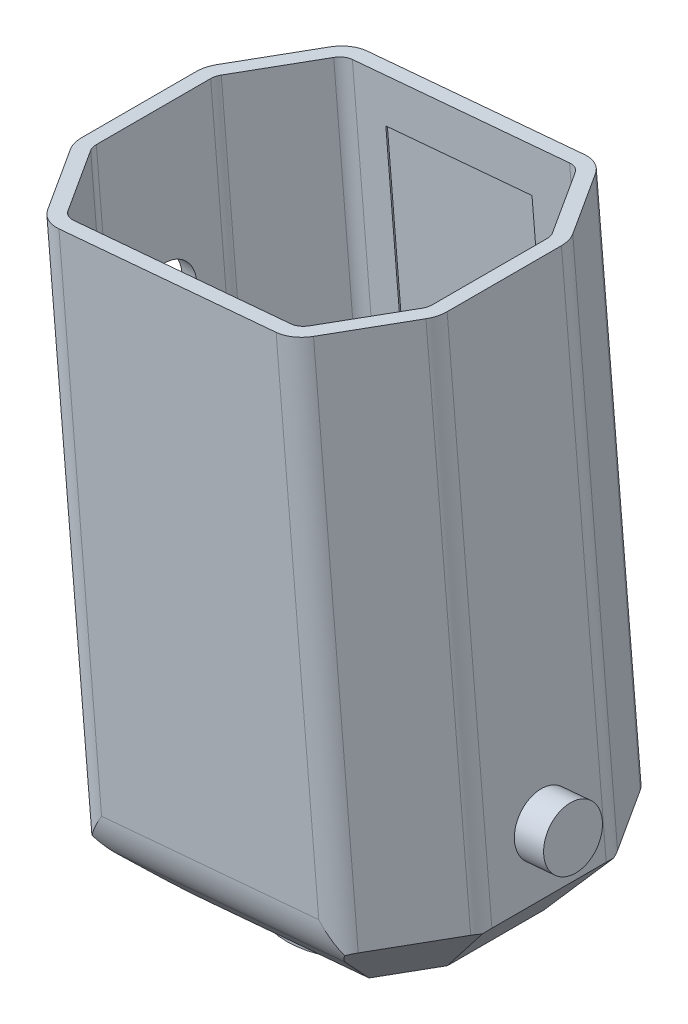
ISO-10303-21;
HEADER;
FILE_DESCRIPTION(('STEP AP214'),'2;1');
FILE_NAME('part.step','',(''),(''),'','','');
FILE_SCHEMA(('AUTOMOTIVE_DESIGN { 1 0 10303 214 1 1 1 1 }'));
ENDSEC;
DATA;
#1=APPLICATION_CONTEXT('core data for automotive mechanical design processes');
#2=APPLICATION_PROTOCOL_DEFINITION('international standard','automotive_design',2000,#1);
#3=PRODUCT_CONTEXT('',#1,'mechanical');
#4=PRODUCT('Part','Part','',(#3));
#5=PRODUCT_RELATED_PRODUCT_CATEGORY('part','',(#4));
#6=PRODUCT_DEFINITION_FORMATION('','',#4);
#7=PRODUCT_DEFINITION_CONTEXT('part definition',#1,'design');
#8=PRODUCT_DEFINITION('design','',#6,#7);
#9=PRODUCT_DEFINITION_SHAPE('','',#8);
#10=(LENGTH_UNIT() NAMED_UNIT(*) SI_UNIT(.MILLI.,.METRE.));
#11=(NAMED_UNIT(*) PLANE_ANGLE_UNIT() SI_UNIT($,.RADIAN.));
#12=(NAMED_UNIT(*) SI_UNIT($,.STERADIAN.) SOLID_ANGLE_UNIT());
#13=UNCERTAINTY_MEASURE_WITH_UNIT(LENGTH_MEASURE(1.E-05),#10,'distance_accuracy_value','');
#14=(GEOMETRIC_REPRESENTATION_CONTEXT(3) GLOBAL_UNCERTAINTY_ASSIGNED_CONTEXT((#13)) GLOBAL_UNIT_ASSIGNED_CONTEXT((#10,
#11,#12)) REPRESENTATION_CONTEXT('',''));
#15=CARTESIAN_POINT('',(0.,0.,0.));
#16=DIRECTION('',(0.,0.,1.));
#17=DIRECTION('',(1.,0.,0.));
#18=AXIS2_PLACEMENT_3D('',#15,#16,#17);
#19=CARTESIAN_POINT('',(-0.0618669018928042,35.1282816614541,16.));
#20=DIRECTION('',(-0.996194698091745,-0.0871557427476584,0.));
#21=DIRECTION('',(0.0871557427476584,-0.996194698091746,0.));
#22=AXIS2_PLACEMENT_3D('',#19,#20,#21);
#23=PLANE('',#22);
#24=DIRECTION('',(0.,0.,-1.));
#25=VECTOR('',#24,1.);
#26=CARTESIAN_POINT('',(2.98858409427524,0.261467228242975,16.));
#27=LINE('',#26,#25);
#28=CARTESIAN_POINT('',(2.98858409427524,0.261467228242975,15.394448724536));
#29=VERTEX_POINT('',#28);
#30=CARTESIAN_POINT('',(2.98858409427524,0.261467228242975,7.60555127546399));
#31=VERTEX_POINT('',#30);
#32=EDGE_CURVE('E893',#29,#31,#27,.T.);
#33=ORIENTED_EDGE('',*,*,#32,.T.);
#34=DIRECTION('',(0.0871557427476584,-0.996194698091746,0.));
#35=VECTOR('',#34,1.);
#36=CARTESIAN_POINT('',(-0.0618669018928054,35.1282816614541,7.60555127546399));
#37=LINE('',#36,#35);
#38=CARTESIAN_POINT('',(-0.0618669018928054,35.1282816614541,7.60555127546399));
#39=VERTEX_POINT('',#38);
#40=EDGE_CURVE('E1006',#31,#39,#37,.F.);
#41=ORIENTED_EDGE('',*,*,#40,.T.);
#42=DIRECTION('',(0.,0.,-1.));
#43=VECTOR('',#42,1.);
#44=CARTESIAN_POINT('',(-0.0618669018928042,35.1282816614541,16.));
#45=LINE('',#44,#43);
#46=CARTESIAN_POINT('',(-0.0618669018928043,35.1282816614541,15.394448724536));
#47=VERTEX_POINT('',#46);
#48=EDGE_CURVE('E917',#47,#39,#45,.T.);
#49=ORIENTED_EDGE('',*,*,#48,.F.);
#50=DIRECTION('',(0.0871557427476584,-0.996194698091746,0.));
#51=VECTOR('',#50,1.);
#52=CARTESIAN_POINT('',(-0.0618669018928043,35.1282816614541,15.394448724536));
#53=LINE('',#52,#51);
#54=EDGE_CURVE('E1003',#47,#29,#53,.T.);
#55=ORIENTED_EDGE('',*,*,#54,.T.);
#56=EDGE_LOOP('',(#33,#41,#49,#55));
#57=FACE_BOUND('',#56,.T.);
#58=CARTESIAN_POINT('',(2.63584808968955,4.29325820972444,11.5038491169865));
#59=DIRECTION('',(-0.996194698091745,-0.0871557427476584,0.));
#60=DIRECTION('',(0.0871557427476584,-0.996194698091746,0.));
#61=AXIS2_PLACEMENT_3D('',#58,#59,#60);
#62=CIRCLE('',#61,2.);
#63=CARTESIAN_POINT('',(2.81015957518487,2.30086881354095,11.5038491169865));
#64=VERTEX_POINT('',#63);
#65=EDGE_CURVE('E11',#64,#64,#62,.F.);
#66=ORIENTED_EDGE('',*,*,#65,.F.);
#67=EDGE_LOOP('',(#66));
#68=FACE_BOUND('',#67,.T.);
#69=ADVANCED_FACE('F30',(#57,#68),#23,.F.);
#70=CARTESIAN_POINT('',(-24.9667343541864,32.9493880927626,16.));
#71=DIRECTION('',(0.996194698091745,0.0871557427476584,0.));
#72=DIRECTION('',(-0.0871557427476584,0.996194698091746,0.));
#73=AXIS2_PLACEMENT_3D('',#70,#71,#72);
#74=PLANE('',#73);
#75=DIRECTION('',(0.,0.,1.));
#76=VECTOR('',#75,1.);
#77=CARTESIAN_POINT('',(-24.9667343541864,32.9493880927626,16.));
#78=LINE('',#77,#76);
#79=CARTESIAN_POINT('',(-24.9667343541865,32.9493880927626,7.60555127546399));
#80=VERTEX_POINT('',#79);
#81=CARTESIAN_POINT('',(-24.9667343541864,32.9493880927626,15.394448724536));
#82=VERTEX_POINT('',#81);
#83=EDGE_CURVE('E929',#80,#82,#78,.T.);
#84=ORIENTED_EDGE('',*,*,#83,.F.);
#85=DIRECTION('',(0.0871557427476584,-0.996194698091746,0.));
#86=VECTOR('',#85,1.);
#87=CARTESIAN_POINT('',(-24.9667343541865,32.9493880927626,7.60555127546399));
#88=LINE('',#87,#86);
#89=CARTESIAN_POINT('',(-21.9162833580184,-1.91742634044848,7.60555127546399));
#90=VERTEX_POINT('',#89);
#91=EDGE_CURVE('E968',#80,#90,#88,.T.);
#92=ORIENTED_EDGE('',*,*,#91,.T.);
#93=DIRECTION('',(0.,0.,1.));
#94=VECTOR('',#93,1.);
#95=CARTESIAN_POINT('',(-21.9162833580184,-1.91742634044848,16.));
#96=LINE('',#95,#94);
#97=CARTESIAN_POINT('',(-21.9162833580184,-1.91742634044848,15.394448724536));
#98=VERTEX_POINT('',#97);
#99=EDGE_CURVE('E905',#90,#98,#96,.T.);
#100=ORIENTED_EDGE('',*,*,#99,.T.);
#101=DIRECTION('',(0.0871557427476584,-0.996194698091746,0.));
#102=VECTOR('',#101,1.);
#103=CARTESIAN_POINT('',(-24.9667343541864,32.9493880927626,15.394448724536));
#104=LINE('',#103,#102);
#105=EDGE_CURVE('E966',#98,#82,#104,.F.);
#106=ORIENTED_EDGE('',*,*,#105,.T.);
#107=EDGE_LOOP('',(#84,#92,#100,#106));
#108=FACE_BOUND('',#107,.T.);
#109=CARTESIAN_POINT('',(-24.0495981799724,22.4664736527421,11.4814599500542));
#110=DIRECTION('',(0.996194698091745,0.0871557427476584,0.));
#111=DIRECTION('',(0.0871557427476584,-0.996194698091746,0.));
#112=AXIS2_PLACEMENT_3D('',#109,#110,#111);
#113=ELLIPSE('',#112,2.0076396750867,2.);
#114=CARTESIAN_POINT('',(-23.8746208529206,20.4664736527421,11.4814599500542));
#115=VERTEX_POINT('',#114);
#116=EDGE_CURVE('E479',#115,#115,#113,.T.);
#117=ORIENTED_EDGE('',*,*,#116,.T.);
#118=EDGE_LOOP('',(#117));
#119=FACE_BOUND('',#118,.T.);
#120=CARTESIAN_POINT('',(-22.2690193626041,2.11436464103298,11.5038491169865));
#121=DIRECTION('',(0.996194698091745,0.0871557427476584,0.));
#122=DIRECTION('',(-0.0871557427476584,0.996194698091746,0.));
#123=AXIS2_PLACEMENT_3D('',#120,#121,#122);
#124=CIRCLE('',#123,2.);
#125=CARTESIAN_POINT('',(-22.4433308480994,4.10675403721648,11.5038491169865));
#126=VERTEX_POINT('',#125);
#127=EDGE_CURVE('E40',#126,#126,#124,.F.);
#128=ORIENTED_EDGE('',*,*,#127,.F.);
#129=EDGE_LOOP('',(#128));
#130=FACE_BOUND('',#129,.T.);
#131=ADVANCED_FACE('F1104',(#108,#119,#130),#74,.F.);
#132=CARTESIAN_POINT('',(-1.05806159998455,35.0411259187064,16.));
#133=DIRECTION('',(-0.996194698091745,-0.0871557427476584,0.));
#134=DIRECTION('',(0.0871557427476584,-0.996194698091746,0.));
#135=AXIS2_PLACEMENT_3D('',#132,#133,#134);
#136=PLANE('',#135);
#137=DIRECTION('',(0.,0.,-1.));
#138=VECTOR('',#137,1.);
#139=CARTESIAN_POINT('',(1.95628830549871,0.586948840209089,16.));
#140=LINE('',#139,#138);
#141=CARTESIAN_POINT('',(1.95628830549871,0.586948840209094,15.394448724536));
#142=VERTEX_POINT('',#141);
#143=CARTESIAN_POINT('',(1.95628830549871,0.586948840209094,7.60555127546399));
#144=VERTEX_POINT('',#143);
#145=EDGE_CURVE('E666',#142,#144,#140,.T.);
#146=ORIENTED_EDGE('',*,*,#145,.F.);
#147=DIRECTION('',(0.0871557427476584,-0.996194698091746,0.));
#148=VECTOR('',#147,1.);
#149=CARTESIAN_POINT('',(-1.05806159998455,35.0411259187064,15.394448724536));
#150=LINE('',#149,#148);
#151=CARTESIAN_POINT('',(-1.05806159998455,35.0411259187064,15.394448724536));
#152=VERTEX_POINT('',#151);
#153=EDGE_CURVE('E683',#152,#142,#150,.T.);
#154=ORIENTED_EDGE('',*,*,#153,.F.);
#155=DIRECTION('',(0.,0.,-1.));
#156=VECTOR('',#155,1.);
#157=CARTESIAN_POINT('',(-1.05806159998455,35.0411259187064,16.));
#158=LINE('',#157,#156);
#159=CARTESIAN_POINT('',(-1.05806159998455,35.0411259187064,7.60555127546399));
#160=VERTEX_POINT('',#159);
#161=EDGE_CURVE('E771',#152,#160,#158,.T.);
#162=ORIENTED_EDGE('',*,*,#161,.T.);
#163=DIRECTION('',(0.0871557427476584,-0.996194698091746,0.));
#164=VECTOR('',#163,1.);
#165=CARTESIAN_POINT('',(-1.05806159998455,35.0411259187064,7.60555127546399));
#166=LINE('',#165,#164);
#167=EDGE_CURVE('E660',#144,#160,#166,.F.);
#168=ORIENTED_EDGE('',*,*,#167,.F.);
#169=EDGE_LOOP('',(#146,#154,#162,#168));
#170=FACE_BOUND('',#169,.T.);
#171=CARTESIAN_POINT('',(0.0420779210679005,22.4664736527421,11.4814599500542));
#172=DIRECTION('',(-0.996194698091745,-0.0871557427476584,0.));
#173=DIRECTION('',(0.0871557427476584,-0.996194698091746,0.));
#174=AXIS2_PLACEMENT_3D('',#171,#172,#173);
#175=ELLIPSE('',#174,2.0076396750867,2.);
#176=CARTESIAN_POINT('',(0.,22.9474264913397,13.4227699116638));
#177=VERTEX_POINT('',#176);
#178=CARTESIAN_POINT('',(0.,22.9474264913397,9.54014998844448));
#179=VERTEX_POINT('',#178);
#180=EDGE_CURVE('E473',#177,#179,#175,.T.);
#181=ORIENTED_EDGE('',*,*,#180,.F.);
#182=DIRECTION('',(0.,0.,1.));
#183=VECTOR('',#182,1.);
#184=CARTESIAN_POINT('',(0.,22.9474264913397,16.));
#185=LINE('',#184,#183);
#186=EDGE_CURVE('E464',#179,#177,#185,.T.);
#187=ORIENTED_EDGE('',*,*,#186,.F.);
#188=EDGE_LOOP('',(#181,#187));
#189=FACE_BOUND('',#188,.T.);
#190=CARTESIAN_POINT('',(1.63965339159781,4.20610246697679,11.5038491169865));
#191=DIRECTION('',(-0.996194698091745,-0.0871557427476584,0.));
#192=DIRECTION('',(0.0871557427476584,-0.996194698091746,0.));
#193=AXIS2_PLACEMENT_3D('',#190,#191,#192);
#194=CIRCLE('',#193,2.);
#195=CARTESIAN_POINT('',(1.81396487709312,2.2137130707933,11.5038491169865));
#196=VERTEX_POINT('',#195);
#197=EDGE_CURVE('E1791',#196,#196,#194,.F.);
#198=ORIENTED_EDGE('',*,*,#197,.T.);
#199=EDGE_LOOP('',(#198));
#200=FACE_BOUND('',#199,.T.);
#201=ADVANCED_FACE('F477',(#170,#189,#200),#136,.T.);
#202=CARTESIAN_POINT('',(-23.9705396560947,33.0365438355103,16.));
#203=DIRECTION('',(0.996194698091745,0.0871557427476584,0.));
#204=DIRECTION('',(-0.0871557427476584,0.996194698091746,0.));
#205=AXIS2_PLACEMENT_3D('',#202,#203,#204);
#206=PLANE('',#205);
#207=DIRECTION('',(0.,0.,1.));
#208=VECTOR('',#207,1.);
#209=CARTESIAN_POINT('',(-23.9705396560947,33.0365438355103,16.));
#210=LINE('',#209,#208);
#211=CARTESIAN_POINT('',(-23.9705396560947,33.0365438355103,7.60555127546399));
#212=VERTEX_POINT('',#211);
#213=CARTESIAN_POINT('',(-23.9705396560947,33.0365438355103,15.394448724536));
#214=VERTEX_POINT('',#213);
#215=EDGE_CURVE('E560',#212,#214,#210,.T.);
#216=ORIENTED_EDGE('',*,*,#215,.T.);
#217=DIRECTION('',(-0.0871557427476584,0.996194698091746,0.));
#218=VECTOR('',#217,1.);
#219=CARTESIAN_POINT('',(-23.9705396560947,33.0365438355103,15.394448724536));
#220=LINE('',#219,#218);
#221=CARTESIAN_POINT('',(-20.9561897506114,-1.41763324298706,15.394448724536));
#222=VERTEX_POINT('',#221);
#223=EDGE_CURVE('E568',#222,#214,#220,.T.);
#224=ORIENTED_EDGE('',*,*,#223,.F.);
#225=DIRECTION('',(0.,0.,1.));
#226=VECTOR('',#225,1.);
#227=CARTESIAN_POINT('',(-20.9561897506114,-1.41763324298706,16.));
#228=LINE('',#227,#226);
#229=CARTESIAN_POINT('',(-20.9561897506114,-1.41763324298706,7.60555127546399));
#230=VERTEX_POINT('',#229);
#231=EDGE_CURVE('E545',#230,#222,#228,.T.);
#232=ORIENTED_EDGE('',*,*,#231,.F.);
#233=DIRECTION('',(-0.0871557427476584,0.996194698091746,0.));
#234=VECTOR('',#233,1.);
#235=CARTESIAN_POINT('',(-23.9705396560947,33.0365438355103,7.60555127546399));
#236=LINE('',#235,#234);
#237=EDGE_CURVE('E565',#212,#230,#236,.F.);
#238=ORIENTED_EDGE('',*,*,#237,.F.);
#239=EDGE_LOOP('',(#216,#224,#232,#238));
#240=FACE_BOUND('',#239,.T.);
#241=CARTESIAN_POINT('',(-23.0457783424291,22.4664736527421,11.4814599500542));
#242=DIRECTION('',(0.996194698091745,0.0871557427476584,0.));
#243=DIRECTION('',(0.0871557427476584,-0.996194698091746,0.));
#244=AXIS2_PLACEMENT_3D('',#241,#242,#243);
#245=ELLIPSE('',#244,2.0076396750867,2.);
#246=CARTESIAN_POINT('',(-22.8708010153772,20.4664736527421,11.4814599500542));
#247=VERTEX_POINT('',#246);
#248=EDGE_CURVE('E474',#247,#247,#245,.T.);
#249=ORIENTED_EDGE('',*,*,#248,.F.);
#250=EDGE_LOOP('',(#249));
#251=FACE_BOUND('',#250,.T.);
#252=CARTESIAN_POINT('',(-21.2728246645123,2.20152038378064,11.5038491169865));
#253=DIRECTION('',(0.996194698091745,0.0871557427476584,0.));
#254=DIRECTION('',(-0.0871557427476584,0.996194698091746,0.));
#255=AXIS2_PLACEMENT_3D('',#252,#253,#254);
#256=CIRCLE('',#255,2.);
#257=CARTESIAN_POINT('',(-21.098513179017,0.209130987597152,11.5038491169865));
#258=VERTEX_POINT('',#257);
#259=EDGE_CURVE('E35',#258,#258,#256,.F.);
#260=ORIENTED_EDGE('',*,*,#259,.T.);
#261=EDGE_LOOP('',(#260));
#262=FACE_BOUND('',#261,.T.);
#263=ADVANCED_FACE('F1115',(#240,#251,#262),#206,.T.);
#264=CARTESIAN_POINT('',(-4.04664569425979,34.7796586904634,0.999999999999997));
#265=DIRECTION('',(0.,0.,1.));
#266=DIRECTION('',(1.,0.,0.));
#267=AXIS2_PLACEMENT_3D('',#264,#265,#266);
#268=PLANE('',#267);
#269=DIRECTION('',(0.0871557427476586,-0.996194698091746,0.));
#270=VECTOR('',#269,1.);
#271=CARTESIAN_POINT('',(-6.76493241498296,32.5639860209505,0.999999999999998));
#272=LINE('',#271,#270);
#273=CARTESIAN_POINT('',(-6.76493241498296,32.5639860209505,0.999999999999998));
#274=VERTEX_POINT('',#273);
#275=CARTESIAN_POINT('',(-5.01918450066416,12.6099960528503,0.999999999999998));
#276=VERTEX_POINT('',#275);
#277=EDGE_CURVE('E811',#274,#276,#272,.T.);
#278=ORIENTED_EDGE('',*,*,#277,.F.);
#279=DIRECTION('',(0.996194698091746,0.0871557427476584,0.));
#280=VECTOR('',#279,1.);
#281=CARTESIAN_POINT('',(-6.76493241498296,32.5639860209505,0.999999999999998));
#282=LINE('',#281,#280);
#283=CARTESIAN_POINT('',(-18.7192687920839,31.5181171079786,0.999999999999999));
#284=VERTEX_POINT('',#283);
#285=EDGE_CURVE('E820',#284,#274,#282,.T.);
#286=ORIENTED_EDGE('',*,*,#285,.F.);
#287=DIRECTION('',(-0.0871557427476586,0.996194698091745,0.));
#288=VECTOR('',#287,1.);
#289=CARTESIAN_POINT('',(-18.7192687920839,31.5181171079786,0.999999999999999));
#290=LINE('',#289,#288);
#291=CARTESIAN_POINT('',(-16.9735208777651,11.5641271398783,0.999999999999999));
#292=VERTEX_POINT('',#291);
#293=EDGE_CURVE('E817',#292,#284,#290,.T.);
#294=ORIENTED_EDGE('',*,*,#293,.F.);
#295=DIRECTION('',(-0.996194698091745,-0.0871557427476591,0.));
#296=VECTOR('',#295,1.);
#297=CARTESIAN_POINT('',(-16.9735208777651,11.5641271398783,0.999999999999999));
#298=LINE('',#297,#296);
#299=EDGE_CURVE('E814',#276,#292,#298,.T.);
#300=ORIENTED_EDGE('',*,*,#299,.F.);
#301=EDGE_LOOP('',(#278,#286,#294,#300));
#302=FACE_BOUND('',#301,.T.);
#303=DIRECTION('',(-0.996194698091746,-0.0871557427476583,0.));
#304=VECTOR('',#303,1.);
#305=CARTESIAN_POINT('',(-0.996194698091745,-0.0871557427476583,0.999999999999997));
#306=LINE('',#305,#304);
#307=CARTESIAN_POINT('',(-2.06248914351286,-0.180444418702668,0.999999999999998));
#308=VERTEX_POINT('',#307);
#309=CARTESIAN_POINT('',(-16.8652101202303,-1.47551469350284,0.999999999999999));
#310=VERTEX_POINT('',#309);
#311=EDGE_CURVE('E899',#308,#310,#306,.T.);
#312=ORIENTED_EDGE('',*,*,#311,.T.);
#313=DIRECTION('',(0.0871557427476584,-0.996194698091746,0.));
#314=VECTOR('',#313,1.);
#315=CARTESIAN_POINT('',(-19.9156611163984,33.3912997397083,0.999999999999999));
#316=LINE('',#315,#314);
#317=CARTESIAN_POINT('',(-19.9156611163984,33.3912997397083,0.999999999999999));
#318=VERTEX_POINT('',#317);
#319=EDGE_CURVE('E948',#310,#318,#316,.F.);
#320=ORIENTED_EDGE('',*,*,#319,.T.);
#321=DIRECTION('',(-0.996194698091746,-0.0871557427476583,0.));
#322=VECTOR('',#321,1.);
#323=CARTESIAN_POINT('',(-4.04664569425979,34.7796586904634,0.999999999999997));
#324=LINE('',#323,#322);
#325=CARTESIAN_POINT('',(-5.1129401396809,34.6863700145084,0.999999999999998));
#326=VERTEX_POINT('',#325);
#327=EDGE_CURVE('E923',#326,#318,#324,.T.);
#328=ORIENTED_EDGE('',*,*,#327,.F.);
#329=DIRECTION('',(0.0871557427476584,-0.996194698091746,0.));
#330=VECTOR('',#329,1.);
#331=CARTESIAN_POINT('',(-5.1129401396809,34.6863700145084,0.999999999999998));
#332=LINE('',#331,#330);
#333=EDGE_CURVE('E945',#326,#308,#332,.T.);
#334=ORIENTED_EDGE('',*,*,#333,.T.);
#335=EDGE_LOOP('',(#312,#320,#328,#334));
#336=FACE_BOUND('',#335,.T.);
#337=DIRECTION('',(0.087155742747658,-0.996194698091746,0.));
#338=VECTOR('',#337,1.);
#339=CARTESIAN_POINT('',(-5.3015991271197,10.710353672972,0.999999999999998));
#340=LINE('',#339,#338);
#341=CARTESIAN_POINT('',(-5.3015991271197,10.710353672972,0.999999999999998));
#342=VERTEX_POINT('',#341);
#343=CARTESIAN_POINT('',(-4.90922146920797,6.22545652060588,0.999999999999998));
#344=VERTEX_POINT('',#343);
#345=EDGE_CURVE('E613',#342,#344,#340,.T.);
#346=ORIENTED_EDGE('',*,*,#345,.F.);
#347=DIRECTION('',(0.996194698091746,0.087155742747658,0.));
#348=VECTOR('',#347,1.);
#349=CARTESIAN_POINT('',(-5.3015991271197,10.710353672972,0.999999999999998));
#350=LINE('',#349,#348);
#351=CARTESIAN_POINT('',(-16.5868549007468,9.7230217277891,0.999999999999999));
#352=VERTEX_POINT('',#351);
#353=EDGE_CURVE('E787',#352,#342,#350,.T.);
#354=ORIENTED_EDGE('',*,*,#353,.F.);
#355=DIRECTION('',(-0.0871557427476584,0.996194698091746,0.));
#356=VECTOR('',#355,1.);
#357=CARTESIAN_POINT('',(-16.5868549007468,9.7230217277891,0.999999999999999));
#358=LINE('',#357,#356);
#359=CARTESIAN_POINT('',(-16.1944772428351,5.23812457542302,0.999999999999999));
#360=VERTEX_POINT('',#359);
#361=EDGE_CURVE('E784',#360,#352,#358,.T.);
#362=ORIENTED_EDGE('',*,*,#361,.F.);
#363=DIRECTION('',(-0.996194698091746,-0.0871557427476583,0.));
#364=VECTOR('',#363,1.);
#365=CARTESIAN_POINT('',(-16.1944772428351,5.23812457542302,0.999999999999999));
#366=LINE('',#365,#364);
#367=EDGE_CURVE('E781',#344,#360,#366,.T.);
#368=ORIENTED_EDGE('',*,*,#367,.F.);
#369=EDGE_LOOP('',(#346,#354,#362,#368));
#370=FACE_BOUND('',#369,.T.);
#371=ADVANCED_FACE('F1112',(#302,#336,#370),#268,.F.);
#372=CARTESIAN_POINT('',(-1.14059906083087,1.56339367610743,18.));
#373=DIRECTION('',(0.996194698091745,0.0871557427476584,0.));
#374=DIRECTION('',(-0.0871557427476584,0.996194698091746,0.));
#375=AXIS2_PLACEMENT_3D('',#372,#373,#374);
#376=CYLINDRICAL_SURFACE('',#375,4.);
#377=DIRECTION('',(-0.996194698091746,-0.0871557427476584,0.));
#378=VECTOR('',#377,1.);
#379=CARTESIAN_POINT('',(-0.894085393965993,-1.25427042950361,20.8284271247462));
#380=LINE('',#379,#378);
#381=CARTESIAN_POINT('',(-1.51870621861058,-1.30891767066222,20.8284271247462));
#382=VERTEX_POINT('',#381);
#383=CARTESIAN_POINT('',(-17.2047744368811,-2.68127081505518,20.8284271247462));
#384=VERTEX_POINT('',#383);
#385=EDGE_CURVE('E1028',#382,#384,#380,.T.);
#386=ORIENTED_EDGE('',*,*,#385,.F.);
#387=CARTESIAN_POINT('',(3.49963365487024,1.96936143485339,18.));
#388=DIRECTION('',(0.647737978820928,-0.653138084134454,0.392232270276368));
#389=DIRECTION('',(0.760689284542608,0.583012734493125,-0.285390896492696));
#390=AXIS2_PLACEMENT_3D('',#387,#388,#389);
#391=ELLIPSE('',#390,6.79869268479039,4.);
#392=CARTESIAN_POINT('',(-0.84375669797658,-0.182516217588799,21.5894691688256));
#393=VERTEX_POINT('',#392);
#394=EDGE_CURVE('E469',#393,#382,#391,.T.);
#395=ORIENTED_EDGE('',*,*,#394,.F.);
#396=CARTESIAN_POINT('',(-2.20689350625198,1.47010500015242,22.));
#397=CARTESIAN_POINT('',(-2.20416850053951,1.46688772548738,21.9999999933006));
#398=CARTESIAN_POINT('',(-2.20144339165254,1.46367033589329,21.9999955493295));
#399=CARTESIAN_POINT('',(-1.98422381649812,1.20721076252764,21.9992875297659));
#400=CARTESIAN_POINT('',(-1.76916694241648,0.953297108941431,21.9710909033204));
#401=CARTESIAN_POINT('',(-1.45459846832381,0.575960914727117,21.8864383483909));
#402=CARTESIAN_POINT('',(-1.35098849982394,0.45065965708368,21.8511101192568));
#403=CARTESIAN_POINT('',(-1.1478424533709,0.201695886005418,21.76576914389));
#404=CARTESIAN_POINT('',(-1.0483043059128,0.078032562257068,21.7157639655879));
#405=CARTESIAN_POINT('',(-0.889008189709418,-0.123978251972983,21.620607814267));
#406=CARTESIAN_POINT('',(-0.8275067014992,-0.203056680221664,21.5798694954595));
#407=CARTESIAN_POINT('',(-0.707712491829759,-0.359859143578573,21.4917158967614));
#408=CARTESIAN_POINT('',(-0.649418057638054,-0.437583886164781,21.4443042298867));
#409=CARTESIAN_POINT('',(-0.536674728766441,-0.591507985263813,21.3424813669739));
#410=CARTESIAN_POINT('',(-0.48223244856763,-0.667704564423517,21.2880585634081));
#411=CARTESIAN_POINT('',(-0.378213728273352,-0.818100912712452,21.1719950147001));
#412=CARTESIAN_POINT('',(-0.328644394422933,-0.892297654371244,21.110344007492));
#413=CARTESIAN_POINT('',(-0.282048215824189,-0.965215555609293,21.045016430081));
#414=B_SPLINE_CURVE_WITH_KNOTS('',3,(#396,#397,#398,#399,#400,#401,#402,#403,#404,#405,#406,
#407,#408,#409,#410,#411,#412,#413),.UNSPECIFIED.,.F.,.F.,(4,2,2,2,2,2,2,2,4),(0.,
0.0126491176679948,1.00823289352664,1.50692646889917,2.00536335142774,2.32957909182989,
2.65361996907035,2.97820438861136,3.30325534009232),.UNSPECIFIED.);
#415=CARTESIAN_POINT('',(-2.20689350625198,1.47010500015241,22.));
#416=VERTEX_POINT('',#415);
#417=EDGE_CURVE('E1155',#416,#393,#414,.T.);
#418=ORIENTED_EDGE('',*,*,#417,.F.);
#419=DIRECTION('',(-0.996194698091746,-0.0871557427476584,0.));
#420=VECTOR('',#419,1.);
#421=CARTESIAN_POINT('',(-1.14059906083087,1.56339367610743,22.));
#422=LINE('',#421,#420);
#423=CARTESIAN_POINT('',(-17.0096144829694,0.175034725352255,22.));
#424=VERTEX_POINT('',#423);
#425=EDGE_CURVE('E1041',#424,#416,#422,.F.);
#426=ORIENTED_EDGE('',*,*,#425,.F.);
#427=CARTESIAN_POINT('',(-18.0650675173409,-1.68918568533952,21.5894691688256));
#428=CARTESIAN_POINT('',(-18.001579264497,-1.56870755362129,21.6457367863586));
#429=CARTESIAN_POINT('',(-17.9357213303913,-1.44673040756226,21.6959006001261));
#430=CARTESIAN_POINT('',(-17.800434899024,-1.20056842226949,21.7844253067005));
#431=CARTESIAN_POINT('',(-17.7310082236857,-1.07638473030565,21.822792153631));
#432=CARTESIAN_POINT('',(-17.5900489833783,-0.827117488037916,21.8880159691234));
#433=CARTESIAN_POINT('',(-17.5185290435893,-0.702041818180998,21.9149309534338));
#434=CARTESIAN_POINT('',(-17.3739456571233,-0.450943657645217,21.9578140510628));
#435=CARTESIAN_POINT('',(-17.3008823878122,-0.324921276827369,21.9737834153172));
#436=CARTESIAN_POINT('',(-17.1571834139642,-0.0778713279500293,21.994493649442));
#437=CARTESIAN_POINT('',(-17.0865798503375,0.0431358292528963,21.9996914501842));
#438=CARTESIAN_POINT('',(-17.0138644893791,0.167751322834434,21.9999955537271));
#439=CARTESIAN_POINT('',(-17.0117394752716,0.171393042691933,21.9999999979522));
#440=CARTESIAN_POINT('',(-17.0096144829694,0.175034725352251,22.));
#441=B_SPLINE_CURVE_WITH_KNOTS('',3,(#427,#428,#429,#430,#431,#432,#433,#434,#435,#436,#437,
#438,#439,#440),.UNSPECIFIED.,.F.,.F.,(4,2,2,2,2,2,4),(0.,0.441772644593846,0.883321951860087,
1.32260691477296,1.76184166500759,2.18202730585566,2.19467642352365),.UNSPECIFIED.);
#442=CARTESIAN_POINT('',(-18.0650675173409,-1.68918568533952,21.5894691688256));
#443=VERTEX_POINT('',#442);
#444=EDGE_CURVE('E1034',#443,#424,#441,.T.);
#445=ORIENTED_EDGE('',*,*,#444,.F.);
#446=CARTESIAN_POINT('',(-22.7161416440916,-0.324221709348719,18.));
#447=DIRECTION('',(-0.524481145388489,-0.755693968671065,0.392232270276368));
#448=DIRECTION('',(0.850371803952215,-0.442063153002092,0.285390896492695));
#449=AXIS2_PLACEMENT_3D('',#446,#447,#448);
#450=ELLIPSE('',#449,6.79869268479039,4.);
#451=EDGE_CURVE('E1031',#384,#443,#450,.T.);
#452=ORIENTED_EDGE('',*,*,#451,.F.);
#453=EDGE_LOOP('',(#386,#395,#418,#426,#445,#452));
#454=FACE_BOUND('',#453,.T.);
#455=ADVANCED_FACE('F32',(#454),#376,.T.);
#456=CARTESIAN_POINT('',(-4.7749731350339,-0.417756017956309,31.612141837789));
#457=DIRECTION('',(-0.552589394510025,-0.0483453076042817,-0.832050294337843));
#458=DIRECTION('',(-0.833024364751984,0.,0.553236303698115));
#459=AXIS2_PLACEMENT_3D('',#456,#457,#458);
#460=CYLINDRICAL_SURFACE('',#459,4.);
#461=DIRECTION('',(-0.552589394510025,-0.0483453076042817,-0.832050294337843));
#462=VECTOR('',#461,1.);
#463=CARTESIAN_POINT('',(-4.42635016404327,-4.40253481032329,31.612141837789));
#464=LINE('',#463,#462);
#465=CARTESIAN_POINT('',(-13.4665791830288,-5.19345236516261,18.));
#466=VERTEX_POINT('',#465);
#467=CARTESIAN_POINT('',(-17.5828815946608,-5.55358216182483,11.8019609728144));
#468=VERTEX_POINT('',#467);
#469=EDGE_CURVE('E1018',#466,#468,#464,.T.);
#470=ORIENTED_EDGE('',*,*,#469,.F.);
#471=CARTESIAN_POINT('',(-11.1586829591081,-0.976258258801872,22.));
#472=DIRECTION('',(0.0616284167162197,-0.70441602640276,0.707106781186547));
#473=DIRECTION('',(-0.638542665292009,-0.57232629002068,-0.514495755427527));
#474=AXIS2_PLACEMENT_3D('',#471,#472,#473);
#475=ELLIPSE('',#474,6.79869268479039,4.);
#476=CARTESIAN_POINT('',(-16.1770228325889,-4.25453736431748,19.1715728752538));
#477=VERTEX_POINT('',#476);
#478=EDGE_CURVE('E1024',#477,#466,#475,.T.);
#479=ORIENTED_EDGE('',*,*,#478,.F.);
#480=DIRECTION('',(-0.552589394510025,-0.0483453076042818,-0.832050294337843));
#481=VECTOR('',#480,1.);
#482=CARTESIAN_POINT('',(-19.3253314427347,-4.5299786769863,14.4310709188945));
#483=LINE('',#482,#481);
#484=CARTESIAN_POINT('',(-18.8521055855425,-4.48857677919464,15.1436211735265));
#485=VERTEX_POINT('',#484);
#486=EDGE_CURVE('E1021',#485,#477,#483,.F.);
#487=ORIENTED_EDGE('',*,*,#486,.F.);
#488=CARTESIAN_POINT('',(-21.9162833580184,-1.91742634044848,5.80196097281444));
#489=DIRECTION('',(-0.642787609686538,-0.766044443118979,0.));
#490=DIRECTION('',(-0.326642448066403,0.274085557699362,-0.90453403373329));
#491=AXIS2_PLACEMENT_3D('',#488,#489,#490);
#492=ELLIPSE('',#491,10.1980390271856,4.);
#493=EDGE_CURVE('E1026',#468,#485,#492,.T.);
#494=ORIENTED_EDGE('',*,*,#493,.F.);
#495=EDGE_LOOP('',(#470,#479,#487,#494));
#496=FACE_BOUND('',#495,.T.);
#497=ADVANCED_FACE('F1133',(#496),#460,.T.);
#498=CARTESIAN_POINT('',(-24.9667343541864,32.9493880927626,16.));
#499=DIRECTION('',(0.828884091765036,0.0725179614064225,-0.554700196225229));
#500=DIRECTION('',(-0.556164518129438,0.,-0.831072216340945));
#501=AXIS2_PLACEMENT_3D('',#498,#499,#500);
#502=PLANE('',#501);
#503=DIRECTION('',(0.552589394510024,0.0483453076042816,0.832050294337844));
#504=VECTOR('',#503,1.);
#505=CARTESIAN_POINT('',(-24.9667343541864,32.9493880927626,16.));
#506=LINE('',#505,#504);
#507=CARTESIAN_POINT('',(-24.632113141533,32.9786636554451,16.5038491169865));
#508=VERTEX_POINT('',#507);
#509=CARTESIAN_POINT('',(-21.5734292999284,33.2462638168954,21.1094003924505));
#510=VERTEX_POINT('',#509);
#511=EDGE_CURVE('E908',#508,#510,#506,.T.);
#512=ORIENTED_EDGE('',*,*,#511,.F.);
#513=DIRECTION('',(0.0871557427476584,-0.996194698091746,0.));
#514=VECTOR('',#513,1.);
#515=CARTESIAN_POINT('',(-24.632113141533,32.9786636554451,16.5038491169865));
#516=LINE('',#515,#514);
#517=CARTESIAN_POINT('',(-21.581662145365,-1.88815077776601,16.5038491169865));
#518=VERTEX_POINT('',#517);
#519=EDGE_CURVE('E977',#508,#518,#516,.T.);
#520=ORIENTED_EDGE('',*,*,#519,.T.);
#521=DIRECTION('',(0.552589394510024,0.0483453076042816,0.832050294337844));
#522=VECTOR('',#521,1.);
#523=CARTESIAN_POINT('',(-21.9162833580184,-1.91742634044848,16.));
#524=LINE('',#523,#522);
#525=CARTESIAN_POINT('',(-18.5229783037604,-1.62055061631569,21.1094003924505));
#526=VERTEX_POINT('',#525);
#527=EDGE_CURVE('E847',#518,#526,#524,.T.);
#528=ORIENTED_EDGE('',*,*,#527,.T.);
#529=DIRECTION('',(0.0871557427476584,-0.996194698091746,0.));
#530=VECTOR('',#529,1.);
#531=CARTESIAN_POINT('',(-21.5734292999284,33.2462638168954,21.1094003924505));
#532=LINE('',#531,#530);
#533=EDGE_CURVE('E975',#526,#510,#532,.F.);
#534=ORIENTED_EDGE('',*,*,#533,.T.);
#535=EDGE_LOOP('',(#512,#520,#528,#534));
#536=FACE_BOUND('',#535,.T.);
#537=ADVANCED_FACE('F1130',(#536),#502,.F.);
#538=CARTESIAN_POINT('',(-4.04664569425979,34.7796586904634,22.));
#539=DIRECTION('',(0.,0.,-1.));
#540=DIRECTION('',(-1.,0.,0.));
#541=AXIS2_PLACEMENT_3D('',#538,#539,#540);
#542=PLANE('',#541);
#543=DIRECTION('',(0.0871557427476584,-0.996194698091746,0.));
#544=VECTOR('',#543,1.);
#545=CARTESIAN_POINT('',(-19.9156611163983,33.3912997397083,22.));
#546=LINE('',#545,#544);
#547=CARTESIAN_POINT('',(-19.9156611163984,33.3912997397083,22.));
#548=VERTEX_POINT('',#547);
#549=EDGE_CURVE('E987',#548,#424,#546,.T.);
#550=ORIENTED_EDGE('',*,*,#549,.T.);
#551=ORIENTED_EDGE('',*,*,#425,.T.);
#552=DIRECTION('',(0.0871557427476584,-0.996194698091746,0.));
#553=VECTOR('',#552,1.);
#554=CARTESIAN_POINT('',(-5.1129401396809,34.6863700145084,22.));
#555=LINE('',#554,#553);
#556=CARTESIAN_POINT('',(-5.1129401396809,34.6863700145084,22.));
#557=VERTEX_POINT('',#556);
#558=EDGE_CURVE('E985',#416,#557,#555,.F.);
#559=ORIENTED_EDGE('',*,*,#558,.T.);
#560=DIRECTION('',(0.996194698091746,0.0871557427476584,0.));
#561=VECTOR('',#560,1.);
#562=CARTESIAN_POINT('',(-4.04664569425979,34.7796586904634,22.));
#563=LINE('',#562,#561);
#564=EDGE_CURVE('E911',#548,#557,#563,.T.);
#565=ORIENTED_EDGE('',*,*,#564,.F.);
#566=EDGE_LOOP('',(#550,#551,#559,#565));
#567=FACE_BOUND('',#566,.T.);
#568=ADVANCED_FACE('F1126',(#567),#542,.F.);
#569=CARTESIAN_POINT('',(-0.0618669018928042,35.1282816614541,16.));
#570=DIRECTION('',(-0.828884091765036,-0.0725179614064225,-0.554700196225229));
#571=DIRECTION('',(-0.556164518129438,0.,0.831072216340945));
#572=AXIS2_PLACEMENT_3D('',#569,#570,#571);
#573=PLANE('',#572);
#574=DIRECTION('',(0.552589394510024,0.0483453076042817,-0.832050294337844));
#575=VECTOR('',#574,1.);
#576=CARTESIAN_POINT('',(2.98858409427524,0.261467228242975,16.));
#577=LINE('',#576,#575);
#578=CARTESIAN_POINT('',(-0.404720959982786,-0.035408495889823,21.1094003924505));
#579=VERTEX_POINT('',#578);
#580=CARTESIAN_POINT('',(2.65396288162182,0.232191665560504,16.5038491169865));
#581=VERTEX_POINT('',#580);
#582=EDGE_CURVE('E890',#579,#581,#577,.T.);
#583=ORIENTED_EDGE('',*,*,#582,.T.);
#584=DIRECTION('',(0.0871557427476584,-0.996194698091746,0.));
#585=VECTOR('',#584,1.);
#586=CARTESIAN_POINT('',(-0.396488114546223,35.0990060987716,16.5038491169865));
#587=LINE('',#586,#585);
#588=CARTESIAN_POINT('',(-0.396488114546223,35.0990060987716,16.5038491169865));
#589=VERTEX_POINT('',#588);
#590=EDGE_CURVE('E1016',#581,#589,#587,.F.);
#591=ORIENTED_EDGE('',*,*,#590,.T.);
#592=DIRECTION('',(0.552589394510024,0.0483453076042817,-0.832050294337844));
#593=VECTOR('',#592,1.);
#594=CARTESIAN_POINT('',(-0.0618669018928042,35.1282816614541,16.));
#595=LINE('',#594,#593);
#596=CARTESIAN_POINT('',(-3.45517195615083,34.8314059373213,21.1094003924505));
#597=VERTEX_POINT('',#596);
#598=EDGE_CURVE('E914',#597,#589,#595,.T.);
#599=ORIENTED_EDGE('',*,*,#598,.F.);
#600=DIRECTION('',(0.0871557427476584,-0.996194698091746,0.));
#601=VECTOR('',#600,1.);
#602=CARTESIAN_POINT('',(-3.45517195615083,34.8314059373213,21.1094003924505));
#603=LINE('',#602,#601);
#604=EDGE_CURVE('E1013',#597,#579,#603,.T.);
#605=ORIENTED_EDGE('',*,*,#604,.T.);
#606=EDGE_LOOP('',(#583,#591,#599,#605));
#607=FACE_BOUND('',#606,.T.);
#608=ADVANCED_FACE('F1119',(#607),#573,.F.);
#609=CARTESIAN_POINT('',(-0.0618669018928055,35.1282816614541,7.));
#610=DIRECTION('',(-0.828884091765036,-0.0725179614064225,0.554700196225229));
#611=DIRECTION('',(0.556164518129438,0.,0.831072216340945));
#612=AXIS2_PLACEMENT_3D('',#609,#610,#611);
#613=PLANE('',#612);
#614=DIRECTION('',(-0.552589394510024,-0.0483453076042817,-0.832050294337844));
#615=VECTOR('',#614,1.);
#616=CARTESIAN_POINT('',(-0.0618669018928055,35.1282816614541,7.));
#617=LINE('',#616,#615);
#618=CARTESIAN_POINT('',(-0.396488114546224,35.0990060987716,6.49615088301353));
#619=VERTEX_POINT('',#618);
#620=CARTESIAN_POINT('',(-3.45517195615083,34.8314059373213,1.89059960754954));
#621=VERTEX_POINT('',#620);
#622=EDGE_CURVE('E920',#619,#621,#617,.T.);
#623=ORIENTED_EDGE('',*,*,#622,.F.);
#624=DIRECTION('',(0.0871557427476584,-0.996194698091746,0.));
#625=VECTOR('',#624,1.);
#626=CARTESIAN_POINT('',(-0.396488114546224,35.0990060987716,6.49615088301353));
#627=LINE('',#626,#625);
#628=CARTESIAN_POINT('',(2.65396288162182,0.232191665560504,6.49615088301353));
#629=VERTEX_POINT('',#628);
#630=EDGE_CURVE('E992',#619,#629,#627,.T.);
#631=ORIENTED_EDGE('',*,*,#630,.T.);
#632=DIRECTION('',(-0.552589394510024,-0.0483453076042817,-0.832050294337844));
#633=VECTOR('',#632,1.);
#634=CARTESIAN_POINT('',(2.98858409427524,0.261467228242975,7.));
#635=LINE('',#634,#633);
#636=CARTESIAN_POINT('',(-0.404720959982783,-0.0354084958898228,1.89059960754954));
#637=VERTEX_POINT('',#636);
#638=EDGE_CURVE('E896',#629,#637,#635,.T.);
#639=ORIENTED_EDGE('',*,*,#638,.T.);
#640=DIRECTION('',(0.0871557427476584,-0.996194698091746,0.));
#641=VECTOR('',#640,1.);
#642=CARTESIAN_POINT('',(-3.45517195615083,34.8314059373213,1.89059960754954));
#643=LINE('',#642,#641);
#644=EDGE_CURVE('E990',#637,#621,#643,.F.);
#645=ORIENTED_EDGE('',*,*,#644,.T.);
#646=EDGE_LOOP('',(#623,#631,#639,#645));
#647=FACE_BOUND('',#646,.T.);
#648=ADVANCED_FACE('F1110',(#647),#613,.F.);
#649=CARTESIAN_POINT('',(-24.9667343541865,32.9493880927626,7.));
#650=DIRECTION('',(0.828884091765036,0.0725179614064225,0.554700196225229));
#651=DIRECTION('',(0.556164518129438,0.,-0.831072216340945));
#652=AXIS2_PLACEMENT_3D('',#649,#650,#651);
#653=PLANE('',#652);
#654=DIRECTION('',(-0.552589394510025,-0.0483453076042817,0.832050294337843));
#655=VECTOR('',#654,1.);
#656=CARTESIAN_POINT('',(-24.9667343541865,32.9493880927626,7.));
#657=LINE('',#656,#655);
#658=CARTESIAN_POINT('',(-21.5734292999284,33.2462638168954,1.89059960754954));
#659=VERTEX_POINT('',#658);
#660=CARTESIAN_POINT('',(-24.632113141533,32.9786636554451,6.49615088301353));
#661=VERTEX_POINT('',#660);
#662=EDGE_CURVE('E926',#659,#661,#657,.T.);
#663=ORIENTED_EDGE('',*,*,#662,.F.);
#664=DIRECTION('',(0.0871557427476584,-0.996194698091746,0.));
#665=VECTOR('',#664,1.);
#666=CARTESIAN_POINT('',(-21.5734292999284,33.2462638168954,1.89059960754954));
#667=LINE('',#666,#665);
#668=CARTESIAN_POINT('',(-18.5229783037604,-1.62055061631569,1.89059960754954));
#669=VERTEX_POINT('',#668);
#670=EDGE_CURVE('E934',#659,#669,#667,.T.);
#671=ORIENTED_EDGE('',*,*,#670,.T.);
#672=DIRECTION('',(-0.552589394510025,-0.0483453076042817,0.832050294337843));
#673=VECTOR('',#672,1.);
#674=CARTESIAN_POINT('',(-21.9162833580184,-1.91742634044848,7.));
#675=LINE('',#674,#673);
#676=CARTESIAN_POINT('',(-21.581662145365,-1.88815077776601,6.49615088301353));
#677=VERTEX_POINT('',#676);
#678=EDGE_CURVE('E902',#669,#677,#675,.T.);
#679=ORIENTED_EDGE('',*,*,#678,.T.);
#680=DIRECTION('',(0.0871557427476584,-0.996194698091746,0.));
#681=VECTOR('',#680,1.);
#682=CARTESIAN_POINT('',(-24.632113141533,32.9786636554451,6.49615088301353));
#683=LINE('',#682,#681);
#684=EDGE_CURVE('E932',#677,#661,#683,.F.);
#685=ORIENTED_EDGE('',*,*,#684,.T.);
#686=EDGE_LOOP('',(#663,#671,#679,#685));
#687=FACE_BOUND('',#686,.T.);
#688=ADVANCED_FACE('F1102',(#687),#653,.F.);
#689=CARTESIAN_POINT('',(-27.9553184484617,32.6879208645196,11.5));
#690=DIRECTION('',(-0.0871557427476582,0.996194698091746,0.));
#691=DIRECTION('',(-0.996194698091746,-0.0871557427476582,0.));
#692=AXIS2_PLACEMENT_3D('',#689,#690,#691);
#693=PLANE('',#692);
#694=DIRECTION('',(-0.996194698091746,-0.0871557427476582,0.));
#695=VECTOR('',#694,1.);
#696=CARTESIAN_POINT('',(-4.04664569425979,34.7796586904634,2.));
#697=LINE('',#696,#695);
#698=CARTESIAN_POINT('',(-5.1129401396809,34.6863700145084,2.));
#699=VERTEX_POINT('',#698);
#700=CARTESIAN_POINT('',(-19.9156611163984,33.3912997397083,2.));
#701=VERTEX_POINT('',#700);
#702=EDGE_CURVE('E745',#699,#701,#697,.T.);
#703=ORIENTED_EDGE('',*,*,#702,.F.);
#704=CARTESIAN_POINT('',(-5.1129401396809,34.6863700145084,3.));
#705=DIRECTION('',(-0.0871557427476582,0.996194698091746,0.));
#706=DIRECTION('',(-0.996194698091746,-0.0871557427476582,0.));
#707=AXIS2_PLACEMENT_3D('',#704,#705,#706);
#708=CIRCLE('',#707,1.);
#709=CARTESIAN_POINT('',(-4.28405604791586,34.7588879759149,2.44529980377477));
#710=VERTEX_POINT('',#709);
#711=EDGE_CURVE('E773',#710,#699,#708,.T.);
#712=ORIENTED_EDGE('',*,*,#711,.F.);
#713=DIRECTION('',(-0.552589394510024,-0.0483453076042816,-0.832050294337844));
#714=VECTOR('',#713,1.);
#715=CARTESIAN_POINT('',(-0.890750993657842,35.0557637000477,7.55470019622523));
#716=LINE('',#715,#714);
#717=CARTESIAN_POINT('',(-1.22537220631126,35.0264881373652,7.05085107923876));
#718=VERTEX_POINT('',#717);
#719=EDGE_CURVE('E55',#718,#710,#716,.T.);
#720=ORIENTED_EDGE('',*,*,#719,.F.);
#721=CARTESIAN_POINT('',(-2.0542562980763,34.9539701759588,7.60555127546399));
#722=DIRECTION('',(-0.0871557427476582,0.996194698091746,0.));
#723=DIRECTION('',(-0.996194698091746,-0.0871557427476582,0.));
#724=AXIS2_PLACEMENT_3D('',#721,#722,#723);
#725=CIRCLE('',#724,1.);
#726=EDGE_CURVE('E763',#160,#718,#725,.T.);
#727=ORIENTED_EDGE('',*,*,#726,.F.);
#728=ORIENTED_EDGE('',*,*,#161,.F.);
#729=CARTESIAN_POINT('',(-2.05425629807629,34.9539701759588,15.394448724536));
#730=DIRECTION('',(-0.0871557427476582,0.996194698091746,0.));
#731=DIRECTION('',(-0.996194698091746,-0.0871557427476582,0.));
#732=AXIS2_PLACEMENT_3D('',#729,#730,#731);
#733=CIRCLE('',#732,1.);
#734=CARTESIAN_POINT('',(-1.22537220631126,35.0264881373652,15.9491489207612));
#735=VERTEX_POINT('',#734);
#736=EDGE_CURVE('E768',#735,#152,#733,.T.);
#737=ORIENTED_EDGE('',*,*,#736,.F.);
#738=DIRECTION('',(0.552589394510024,0.0483453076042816,-0.832050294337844));
#739=VECTOR('',#738,1.);
#740=CARTESIAN_POINT('',(-0.89075099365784,35.0557637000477,15.4452998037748));
#741=LINE('',#740,#739);
#742=CARTESIAN_POINT('',(-4.28405604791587,34.7588879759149,20.5547001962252));
#743=VERTEX_POINT('',#742);
#744=EDGE_CURVE('E766',#743,#735,#741,.T.);
#745=ORIENTED_EDGE('',*,*,#744,.F.);
#746=CARTESIAN_POINT('',(-5.1129401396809,34.6863700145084,20.));
#747=DIRECTION('',(-0.0871557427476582,0.996194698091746,0.));
#748=DIRECTION('',(-0.996194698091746,-0.0871557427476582,0.));
#749=AXIS2_PLACEMENT_3D('',#746,#747,#748);
#750=CIRCLE('',#749,1.);
#751=CARTESIAN_POINT('',(-5.1129401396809,34.6863700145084,21.));
#752=VERTEX_POINT('',#751);
#753=EDGE_CURVE('E509',#752,#743,#750,.T.);
#754=ORIENTED_EDGE('',*,*,#753,.F.);
#755=DIRECTION('',(0.996194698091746,0.0871557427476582,0.));
#756=VECTOR('',#755,1.);
#757=CARTESIAN_POINT('',(-4.04664569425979,34.7796586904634,21.));
#758=LINE('',#757,#756);
#759=CARTESIAN_POINT('',(-19.9156611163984,33.3912997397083,21.));
#760=VERTEX_POINT('',#759);
#761=EDGE_CURVE('E761',#760,#752,#758,.T.);
#762=ORIENTED_EDGE('',*,*,#761,.F.);
#763=CARTESIAN_POINT('',(-19.9156611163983,33.3912997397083,20.));
#764=DIRECTION('',(-0.0871557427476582,0.996194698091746,0.));
#765=DIRECTION('',(-0.996194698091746,-0.0871557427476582,0.));
#766=AXIS2_PLACEMENT_3D('',#763,#764,#765);
#767=CIRCLE('',#766,1.);
#768=CARTESIAN_POINT('',(-20.7445452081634,33.3187817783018,20.5547001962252));
#769=VERTEX_POINT('',#768);
#770=EDGE_CURVE('E758',#769,#760,#767,.T.);
#771=ORIENTED_EDGE('',*,*,#770,.F.);
#772=DIRECTION('',(0.552589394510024,0.0483453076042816,0.832050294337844));
#773=VECTOR('',#772,1.);
#774=CARTESIAN_POINT('',(-24.1378502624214,33.021906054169,15.4452998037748));
#775=LINE('',#774,#773);
#776=CARTESIAN_POINT('',(-23.803229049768,33.0511816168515,15.9491489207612));
#777=VERTEX_POINT('',#776);
#778=EDGE_CURVE('E571',#777,#769,#775,.T.);
#779=ORIENTED_EDGE('',*,*,#778,.F.);
#780=CARTESIAN_POINT('',(-22.974344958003,33.1236995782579,15.394448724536));
#781=DIRECTION('',(-0.0871557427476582,0.996194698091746,0.));
#782=DIRECTION('',(-0.996194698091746,-0.0871557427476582,0.));
#783=AXIS2_PLACEMENT_3D('',#780,#781,#782);
#784=CIRCLE('',#783,1.);
#785=EDGE_CURVE('E754',#214,#777,#784,.T.);
#786=ORIENTED_EDGE('',*,*,#785,.F.);
#787=ORIENTED_EDGE('',*,*,#215,.F.);
#788=CARTESIAN_POINT('',(-22.974344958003,33.1236995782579,7.60555127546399));
#789=DIRECTION('',(-0.0871557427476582,0.996194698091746,0.));
#790=DIRECTION('',(-0.996194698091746,-0.0871557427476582,0.));
#791=AXIS2_PLACEMENT_3D('',#788,#789,#790);
#792=CIRCLE('',#791,1.);
#793=CARTESIAN_POINT('',(-23.803229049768,33.0511816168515,7.05085107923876));
#794=VERTEX_POINT('',#793);
#795=EDGE_CURVE('E750',#794,#212,#792,.T.);
#796=ORIENTED_EDGE('',*,*,#795,.F.);
#797=DIRECTION('',(-0.552589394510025,-0.0483453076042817,0.832050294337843));
#798=VECTOR('',#797,1.);
#799=CARTESIAN_POINT('',(-24.1378502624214,33.021906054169,7.55470019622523));
#800=LINE('',#799,#798);
#801=CARTESIAN_POINT('',(-20.7445452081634,33.3187817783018,2.44529980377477));
#802=VERTEX_POINT('',#801);
#803=EDGE_CURVE('E748',#802,#794,#800,.T.);
#804=ORIENTED_EDGE('',*,*,#803,.F.);
#805=CARTESIAN_POINT('',(-19.9156611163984,33.3912997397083,3.));
#806=DIRECTION('',(-0.0871557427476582,0.996194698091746,0.));
#807=DIRECTION('',(-0.996194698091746,-0.0871557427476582,0.));
#808=AXIS2_PLACEMENT_3D('',#805,#806,#807);
#809=CIRCLE('',#808,1.);
#810=EDGE_CURVE('E573',#701,#802,#809,.T.);
#811=ORIENTED_EDGE('',*,*,#810,.F.);
#812=EDGE_LOOP('',(#703,#712,#720,#727,#728,#737,#745,#754,#762,#771,#779,#786,#787,#796,#804,#811));
#813=FACE_BOUND('',#812,.T.);
#814=ORIENTED_EDGE('',*,*,#327,.T.);
#815=CARTESIAN_POINT('',(-19.9156611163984,33.3912997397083,3.));
#816=DIRECTION('',(-0.0871557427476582,0.996194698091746,0.));
#817=DIRECTION('',(-0.996194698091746,-0.0871557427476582,0.));
#818=AXIS2_PLACEMENT_3D('',#815,#816,#817);
#819=CIRCLE('',#818,2.);
#820=EDGE_CURVE('E964',#318,#659,#819,.T.);
#821=ORIENTED_EDGE('',*,*,#820,.T.);
#822=ORIENTED_EDGE('',*,*,#662,.T.);
#823=CARTESIAN_POINT('',(-22.974344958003,33.1236995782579,7.60555127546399));
#824=DIRECTION('',(-0.0871557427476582,0.996194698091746,0.));
#825=DIRECTION('',(-0.996194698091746,-0.0871557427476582,0.));
#826=AXIS2_PLACEMENT_3D('',#823,#824,#825);
#827=CIRCLE('',#826,2.);
#828=EDGE_CURVE('E962',#661,#80,#827,.T.);
#829=ORIENTED_EDGE('',*,*,#828,.T.);
#830=ORIENTED_EDGE('',*,*,#83,.T.);
#831=CARTESIAN_POINT('',(-22.974344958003,33.1236995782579,15.394448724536));
#832=DIRECTION('',(-0.0871557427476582,0.996194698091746,0.));
#833=DIRECTION('',(-0.996194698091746,-0.0871557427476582,0.));
#834=AXIS2_PLACEMENT_3D('',#831,#832,#833);
#835=CIRCLE('',#834,2.);
#836=EDGE_CURVE('E960',#82,#508,#835,.T.);
#837=ORIENTED_EDGE('',*,*,#836,.T.);
#838=ORIENTED_EDGE('',*,*,#511,.T.);
#839=CARTESIAN_POINT('',(-19.9156611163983,33.3912997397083,20.));
#840=DIRECTION('',(-0.0871557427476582,0.996194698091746,0.));
#841=DIRECTION('',(-0.996194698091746,-0.0871557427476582,0.));
#842=AXIS2_PLACEMENT_3D('',#839,#840,#841);
#843=CIRCLE('',#842,2.);
#844=EDGE_CURVE('E958',#510,#548,#843,.T.);
#845=ORIENTED_EDGE('',*,*,#844,.T.);
#846=ORIENTED_EDGE('',*,*,#564,.T.);
#847=CARTESIAN_POINT('',(-5.1129401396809,34.6863700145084,20.));
#848=DIRECTION('',(-0.0871557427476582,0.996194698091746,0.));
#849=DIRECTION('',(-0.996194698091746,-0.0871557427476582,0.));
#850=AXIS2_PLACEMENT_3D('',#847,#848,#849);
#851=CIRCLE('',#850,2.);
#852=EDGE_CURVE('E950',#557,#597,#851,.T.);
#853=ORIENTED_EDGE('',*,*,#852,.T.);
#854=ORIENTED_EDGE('',*,*,#598,.T.);
#855=CARTESIAN_POINT('',(-2.05425629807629,34.9539701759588,15.394448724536));
#856=DIRECTION('',(-0.0871557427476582,0.996194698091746,0.));
#857=DIRECTION('',(-0.996194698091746,-0.0871557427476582,0.));
#858=AXIS2_PLACEMENT_3D('',#855,#856,#857);
#859=CIRCLE('',#858,2.);
#860=EDGE_CURVE('E952',#589,#47,#859,.T.);
#861=ORIENTED_EDGE('',*,*,#860,.T.);
#862=ORIENTED_EDGE('',*,*,#48,.T.);
#863=CARTESIAN_POINT('',(-2.0542562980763,34.9539701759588,7.60555127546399));
#864=DIRECTION('',(-0.0871557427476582,0.996194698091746,0.));
#865=DIRECTION('',(-0.996194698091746,-0.0871557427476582,0.));
#866=AXIS2_PLACEMENT_3D('',#863,#864,#865);
#867=CIRCLE('',#866,2.);
#868=EDGE_CURVE('E956',#39,#619,#867,.T.);
#869=ORIENTED_EDGE('',*,*,#868,.T.);
#870=ORIENTED_EDGE('',*,*,#622,.T.);
#871=CARTESIAN_POINT('',(-5.1129401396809,34.6863700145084,3.));
#872=DIRECTION('',(-0.0871557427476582,0.996194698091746,0.));
#873=DIRECTION('',(-0.996194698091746,-0.0871557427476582,0.));
#874=AXIS2_PLACEMENT_3D('',#871,#872,#873);
#875=CIRCLE('',#874,2.);
#876=EDGE_CURVE('E954',#621,#326,#875,.T.);
#877=ORIENTED_EDGE('',*,*,#876,.T.);
#878=EDGE_LOOP('',(#814,#821,#822,#829,#830,#837,#838,#845,#846,#853,#854,#861,#862,#869,#870,#877));
#879=FACE_BOUND('',#878,.T.);
#880=ADVANCED_FACE('F1072',(#813,#879),#693,.T.);
#881=CARTESIAN_POINT('',(-21.9162833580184,-1.91742634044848,16.));
#882=DIRECTION('',(-0.524481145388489,-0.755693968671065,0.392232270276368));
#883=DIRECTION('',(0.821525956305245,-0.570171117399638,0.));
#884=AXIS2_PLACEMENT_3D('',#881,#882,#883);
#885=PLANE('',#884);
#886=DIRECTION('',(-0.410228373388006,0.627971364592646,0.66133550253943));
#887=VECTOR('',#886,1.);
#888=CARTESIAN_POINT('',(-16.8844914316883,-3.17155517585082,20.3120939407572));
#889=LINE('',#888,#887);
#890=EDGE_CURVE('E849',#477,#384,#889,.T.);
#891=ORIENTED_EDGE('',*,*,#890,.T.);
#892=ORIENTED_EDGE('',*,*,#451,.T.);
#893=CARTESIAN_POINT('',(-16.690898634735,-3.46790408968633,20.));
#894=DIRECTION('',(-0.524481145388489,-0.755693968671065,0.392232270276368));
#895=DIRECTION('',(0.64773797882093,-0.653138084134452,-0.392232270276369));
#896=AXIS2_PLACEMENT_3D('',#893,#894,#895);
#897=ELLIPSE('',#896,2.82842712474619,2.);
#898=EDGE_CURVE('E980',#443,#526,#897,.T.);
#899=ORIENTED_EDGE('',*,*,#898,.T.);
#900=ORIENTED_EDGE('',*,*,#527,.F.);
#901=CARTESIAN_POINT('',(-19.7495824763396,-3.73550425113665,15.394448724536));
#902=DIRECTION('',(-0.524481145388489,-0.755693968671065,0.392232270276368));
#903=DIRECTION('',(0.64773797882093,-0.653138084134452,-0.392232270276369));
#904=AXIS2_PLACEMENT_3D('',#901,#902,#903);
#905=ELLIPSE('',#904,2.82842712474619,2.);
#906=CARTESIAN_POINT('',(-21.8233146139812,-1.99543637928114,15.9740170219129));
#907=VERTEX_POINT('',#906);
#908=EDGE_CURVE('E982',#518,#907,#905,.T.);
#909=ORIENTED_EDGE('',*,*,#908,.T.);
#910=DIRECTION('',(-0.749069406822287,0.628543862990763,0.209350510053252));
#911=VECTOR('',#910,1.);
#912=CARTESIAN_POINT('',(-21.9162833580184,-1.91742634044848,16.));
#913=LINE('',#912,#911);
#914=EDGE_CURVE('E845',#485,#907,#913,.T.);
#915=ORIENTED_EDGE('',*,*,#914,.F.);
#916=ORIENTED_EDGE('',*,*,#486,.T.);
#917=EDGE_LOOP('',(#891,#892,#899,#900,#909,#915,#916));
#918=FACE_BOUND('',#917,.T.);
#919=ADVANCED_FACE('F1068',(#918),#885,.T.);
#920=CARTESIAN_POINT('',(-21.9162833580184,-1.91742634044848,16.));
#921=DIRECTION('',(-0.642787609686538,-0.766044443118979,0.));
#922=DIRECTION('',(0.766044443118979,-0.642787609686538,0.));
#923=AXIS2_PLACEMENT_3D('',#920,#921,#922);
#924=PLANE('',#923);
#925=DIRECTION('',(0.,0.,1.));
#926=VECTOR('',#925,1.);
#927=CARTESIAN_POINT('',(-17.5828815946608,-5.55358216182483,16.));
#928=LINE('',#927,#926);
#929=CARTESIAN_POINT('',(-17.5828815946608,-5.55358216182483,8.21110255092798));
#930=VERTEX_POINT('',#929);
#931=EDGE_CURVE('E853',#930,#468,#928,.T.);
#932=ORIENTED_EDGE('',*,*,#931,.T.);
#933=ORIENTED_EDGE('',*,*,#493,.T.);
#934=ORIENTED_EDGE('',*,*,#914,.T.);
#935=CARTESIAN_POINT('',(-19.7495824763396,-3.73550425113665,15.394448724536));
#936=DIRECTION('',(-0.642787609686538,-0.766044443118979,0.));
#937=DIRECTION('',(0.766044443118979,-0.642787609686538,0.));
#938=AXIS2_PLACEMENT_3D('',#935,#936,#937);
#939=ELLIPSE('',#938,2.82842712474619,2.);
#940=EDGE_CURVE('E971',#907,#98,#939,.T.);
#941=ORIENTED_EDGE('',*,*,#940,.T.);
#942=ORIENTED_EDGE('',*,*,#99,.F.);
#943=CARTESIAN_POINT('',(-19.7495824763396,-3.73550425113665,7.60555127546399));
#944=DIRECTION('',(-0.642787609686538,-0.766044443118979,0.));
#945=DIRECTION('',(0.766044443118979,-0.642787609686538,0.));
#946=AXIS2_PLACEMENT_3D('',#943,#944,#945);
#947=ELLIPSE('',#946,2.82842712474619,2.);
#948=CARTESIAN_POINT('',(-21.8233146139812,-1.99543637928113,7.02598297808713));
#949=VERTEX_POINT('',#948);
#950=EDGE_CURVE('E973',#90,#949,#947,.T.);
#951=ORIENTED_EDGE('',*,*,#950,.T.);
#952=DIRECTION('',(-0.749069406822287,0.628543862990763,-0.209350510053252));
#953=VECTOR('',#952,1.);
#954=CARTESIAN_POINT('',(-21.9162833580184,-1.91742634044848,7.));
#955=LINE('',#954,#953);
#956=EDGE_CURVE('E848',#930,#949,#955,.T.);
#957=ORIENTED_EDGE('',*,*,#956,.F.);
#958=EDGE_LOOP('',(#932,#933,#934,#941,#942,#951,#957));
#959=FACE_BOUND('',#958,.T.);
#960=ADVANCED_FACE('F1071',(#959),#924,.T.);
#961=CARTESIAN_POINT('',(-21.9162833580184,-1.91742634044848,7.));
#962=DIRECTION('',(-0.524481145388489,-0.755693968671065,-0.392232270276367));
#963=DIRECTION('',(0.821525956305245,-0.570171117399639,0.));
#964=AXIS2_PLACEMENT_3D('',#961,#962,#963);
#965=PLANE('',#964);
#966=ORIENTED_EDGE('',*,*,#678,.F.);
#967=CARTESIAN_POINT('',(-16.690898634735,-3.46790408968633,3.));
#968=DIRECTION('',(-0.524481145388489,-0.755693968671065,-0.392232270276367));
#969=DIRECTION('',(0.64773797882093,-0.653138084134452,0.392232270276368));
#970=AXIS2_PLACEMENT_3D('',#967,#968,#969);
#971=ELLIPSE('',#970,2.82842712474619,2.);
#972=CARTESIAN_POINT('',(-17.7847093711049,-1.79351522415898,1.23665080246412));
#973=VERTEX_POINT('',#972);
#974=EDGE_CURVE('E939',#669,#973,#971,.T.);
#975=ORIENTED_EDGE('',*,*,#974,.T.);
#976=DIRECTION('',(-0.410228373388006,0.627971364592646,-0.66133550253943));
#977=VECTOR('',#976,1.);
#978=CARTESIAN_POINT('',(-15.4631964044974,-5.34725202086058,4.97919774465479));
#979=LINE('',#978,#977);
#980=CARTESIAN_POINT('',(-15.4502927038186,-5.36700480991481,5.00000000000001));
#981=VERTEX_POINT('',#980);
#982=EDGE_CURVE('E865',#981,#973,#979,.T.);
#983=ORIENTED_EDGE('',*,*,#982,.F.);
#984=DIRECTION('',(-0.552589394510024,-0.0483453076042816,0.832050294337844));
#985=VECTOR('',#984,1.);
#986=CARTESIAN_POINT('',(-18.2521240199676,-5.61213328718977,9.21880078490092));
#987=LINE('',#986,#985);
#988=EDGE_CURVE('E872',#981,#930,#987,.T.);
#989=ORIENTED_EDGE('',*,*,#988,.T.);
#990=ORIENTED_EDGE('',*,*,#956,.T.);
#991=CARTESIAN_POINT('',(-19.7495824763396,-3.73550425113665,7.60555127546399));
#992=DIRECTION('',(-0.524481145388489,-0.755693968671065,-0.392232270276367));
#993=DIRECTION('',(0.64773797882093,-0.653138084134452,0.392232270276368));
#994=AXIS2_PLACEMENT_3D('',#991,#992,#993);
#995=ELLIPSE('',#994,2.82842712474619,2.);
#996=EDGE_CURVE('E937',#949,#677,#995,.T.);
#997=ORIENTED_EDGE('',*,*,#996,.T.);
#998=EDGE_LOOP('',(#966,#975,#983,#989,#990,#997));
#999=FACE_BOUND('',#998,.T.);
#1000=ADVANCED_FACE('F1092',(#999),#965,.T.);
#1001=CARTESIAN_POINT('',(-0.996194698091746,-0.0871557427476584,0.999999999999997));
#1002=DIRECTION('',(0.0616284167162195,-0.70441602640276,-0.707106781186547));
#1003=DIRECTION('',(0.,0.708453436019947,-0.705757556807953));
#1004=AXIS2_PLACEMENT_3D('',#1001,#1002,#1003);
#1005=PLANE('',#1004);
#1006=ORIENTED_EDGE('',*,*,#982,.T.);
#1007=CARTESIAN_POINT('',(-16.690898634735,-3.46790408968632,3.));
#1008=DIRECTION('',(0.0616284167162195,-0.70441602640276,-0.707106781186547));
#1009=DIRECTION('',(0.0616284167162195,-0.704416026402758,0.707106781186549));
#1010=AXIS2_PLACEMENT_3D('',#1007,#1008,#1009);
#1011=ELLIPSE('',#1010,2.82842712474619,2.);
#1012=EDGE_CURVE('E943',#973,#310,#1011,.T.);
#1013=ORIENTED_EDGE('',*,*,#1012,.T.);
#1014=ORIENTED_EDGE('',*,*,#311,.F.);
#1015=CARTESIAN_POINT('',(-1.88817765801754,-2.17283381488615,3.));
#1016=DIRECTION('',(0.0616284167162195,-0.70441602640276,-0.707106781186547));
#1017=DIRECTION('',(0.0616284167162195,-0.704416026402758,0.707106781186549));
#1018=AXIS2_PLACEMENT_3D('',#1015,#1016,#1017);
#1019=ELLIPSE('',#1018,2.82842712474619,2.);
#1020=CARTESIAN_POINT('',(-1.10173893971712,-0.333944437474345,1.23665080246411));
#1021=VERTEX_POINT('',#1020);
#1022=EDGE_CURVE('E941',#308,#1021,#1019,.T.);
#1023=ORIENTED_EDGE('',*,*,#1022,.T.);
#1024=DIRECTION('',(0.294949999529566,0.68966647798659,-0.66133550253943));
#1025=VECTOR('',#1024,1.);
#1026=CARTESIAN_POINT('',(-1.74898641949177,-1.84737007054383,2.68790605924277));
#1027=LINE('',#1026,#1025);
#1028=CARTESIAN_POINT('',(-2.78016061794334,-4.25851188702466,5.00000000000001));
#1029=VERTEX_POINT('',#1028);
#1030=EDGE_CURVE('E862',#1029,#1021,#1027,.T.);
#1031=ORIENTED_EDGE('',*,*,#1030,.F.);
#1032=DIRECTION('',(-0.996194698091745,-0.0871557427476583,0.));
#1033=VECTOR('',#1032,1.);
#1034=CARTESIAN_POINT('',(-0.647571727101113,-4.07193453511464,5.00000000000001));
#1035=LINE('',#1034,#1033);
#1036=EDGE_CURVE('E875',#1029,#981,#1035,.T.);
#1037=ORIENTED_EDGE('',*,*,#1036,.T.);
#1038=EDGE_LOOP('',(#1006,#1013,#1014,#1023,#1031,#1037));
#1039=FACE_BOUND('',#1038,.T.);
#1040=ADVANCED_FACE('F1088',(#1039),#1005,.T.);
#1041=CARTESIAN_POINT('',(2.98858409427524,0.261467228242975,7.));
#1042=DIRECTION('',(0.647737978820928,-0.653138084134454,-0.392232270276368));
#1043=DIRECTION('',(0.710035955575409,0.704165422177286,0.));
#1044=AXIS2_PLACEMENT_3D('',#1041,#1042,#1043);
#1045=PLANE('',#1044);
#1046=ORIENTED_EDGE('',*,*,#638,.F.);
#1047=CARTESIAN_POINT('',(1.17050618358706,-1.90523365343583,7.60555127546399));
#1048=DIRECTION('',(0.647737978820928,-0.653138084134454,-0.392232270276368));
#1049=DIRECTION('',(-0.524481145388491,-0.755693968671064,0.392232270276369));
#1050=AXIS2_PLACEMENT_3D('',#1047,#1048,#1049);
#1051=ELLIPSE('',#1050,2.82842712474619,2.);
#1052=CARTESIAN_POINT('',(2.91057405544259,0.168498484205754,7.02598297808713));
#1053=VERTEX_POINT('',#1052);
#1054=EDGE_CURVE('E997',#629,#1053,#1051,.T.);
#1055=ORIENTED_EDGE('',*,*,#1054,.T.);
#1056=DIRECTION('',(0.628543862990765,0.749069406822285,-0.209350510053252));
#1057=VECTOR('',#1056,1.);
#1058=CARTESIAN_POINT('',(1.80431028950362,-1.14989533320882,7.39444872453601));
#1059=LINE('',#1058,#1057);
#1060=CARTESIAN_POINT('',(-0.64757172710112,-4.07193453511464,8.21110255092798));
#1061=VERTEX_POINT('',#1060);
#1062=EDGE_CURVE('E859',#1061,#1053,#1059,.T.);
#1063=ORIENTED_EDGE('',*,*,#1062,.F.);
#1064=DIRECTION('',(-0.552589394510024,-0.0483453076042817,-0.832050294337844));
#1065=VECTOR('',#1064,1.);
#1066=CARTESIAN_POINT('',(0.0216706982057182,-4.0133834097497,9.21880078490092));
#1067=LINE('',#1066,#1065);
#1068=EDGE_CURVE('E878',#1061,#1029,#1067,.T.);
#1069=ORIENTED_EDGE('',*,*,#1068,.T.);
#1070=ORIENTED_EDGE('',*,*,#1030,.T.);
#1071=CARTESIAN_POINT('',(-1.88817765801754,-2.17283381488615,3.));
#1072=DIRECTION('',(0.647737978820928,-0.653138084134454,-0.392232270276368));
#1073=DIRECTION('',(-0.524481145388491,-0.755693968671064,0.392232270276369));
#1074=AXIS2_PLACEMENT_3D('',#1071,#1072,#1073);
#1075=ELLIPSE('',#1074,2.82842712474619,2.);
#1076=EDGE_CURVE('E995',#1021,#637,#1075,.T.);
#1077=ORIENTED_EDGE('',*,*,#1076,.T.);
#1078=EDGE_LOOP('',(#1046,#1055,#1063,#1069,#1070,#1077));
#1079=FACE_BOUND('',#1078,.T.);
#1080=ADVANCED_FACE('F1084',(#1079),#1045,.T.);
#1081=CARTESIAN_POINT('',(2.98858409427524,0.261467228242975,16.));
#1082=DIRECTION('',(0.766044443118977,-0.64278760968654,0.));
#1083=DIRECTION('',(0.64278760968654,0.766044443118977,0.));
#1084=AXIS2_PLACEMENT_3D('',#1081,#1082,#1083);
#1085=PLANE('',#1084);
#1086=ORIENTED_EDGE('',*,*,#1062,.T.);
#1087=CARTESIAN_POINT('',(1.17050618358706,-1.90523365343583,7.60555127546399));
#1088=DIRECTION('',(0.766044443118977,-0.64278760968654,0.));
#1089=DIRECTION('',(-0.64278760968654,-0.766044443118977,0.));
#1090=AXIS2_PLACEMENT_3D('',#1087,#1088,#1089);
#1091=ELLIPSE('',#1090,2.82842712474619,2.);
#1092=EDGE_CURVE('E1001',#1053,#31,#1091,.T.);
#1093=ORIENTED_EDGE('',*,*,#1092,.T.);
#1094=ORIENTED_EDGE('',*,*,#32,.F.);
#1095=CARTESIAN_POINT('',(1.17050618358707,-1.90523365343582,15.394448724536));
#1096=DIRECTION('',(0.766044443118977,-0.64278760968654,0.));
#1097=DIRECTION('',(-0.64278760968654,-0.766044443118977,0.));
#1098=AXIS2_PLACEMENT_3D('',#1095,#1096,#1097);
#1099=ELLIPSE('',#1098,2.82842712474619,2.);
#1100=CARTESIAN_POINT('',(2.91057405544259,0.168498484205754,15.9740170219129));
#1101=VERTEX_POINT('',#1100);
#1102=EDGE_CURVE('E999',#29,#1101,#1099,.T.);
#1103=ORIENTED_EDGE('',*,*,#1102,.T.);
#1104=DIRECTION('',(0.628543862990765,0.749069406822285,0.209350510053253));
#1105=VECTOR('',#1104,1.);
#1106=CARTESIAN_POINT('',(2.98858409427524,0.261467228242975,16.));
#1107=LINE('',#1106,#1105);
#1108=CARTESIAN_POINT('',(-0.64757172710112,-4.07193453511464,14.788897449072));
#1109=VERTEX_POINT('',#1108);
#1110=EDGE_CURVE('E856',#1109,#1101,#1107,.T.);
#1111=ORIENTED_EDGE('',*,*,#1110,.F.);
#1112=DIRECTION('',(0.,0.,-1.));
#1113=VECTOR('',#1112,1.);
#1114=CARTESIAN_POINT('',(-0.64757172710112,-4.07193453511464,16.));
#1115=LINE('',#1114,#1113);
#1116=EDGE_CURVE('E881',#1109,#1061,#1115,.T.);
#1117=ORIENTED_EDGE('',*,*,#1116,.T.);
#1118=EDGE_LOOP('',(#1086,#1093,#1094,#1103,#1111,#1117));
#1119=FACE_BOUND('',#1118,.T.);
#1120=ADVANCED_FACE('F1080',(#1119),#1085,.T.);
#1121=CARTESIAN_POINT('',(2.98858409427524,0.261467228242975,16.));
#1122=DIRECTION('',(0.647737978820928,-0.653138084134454,0.392232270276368));
#1123=DIRECTION('',(0.710035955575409,0.704165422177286,0.));
#1124=AXIS2_PLACEMENT_3D('',#1121,#1122,#1123);
#1125=PLANE('',#1124);
#1126=CARTESIAN_POINT('',(-1.88817765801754,-2.17283381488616,20.));
#1127=DIRECTION('',(0.647737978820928,-0.653138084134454,0.392232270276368));
#1128=DIRECTION('',(-0.524481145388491,-0.755693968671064,-0.392232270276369));
#1129=AXIS2_PLACEMENT_3D('',#1126,#1127,#1128);
#1130=ELLIPSE('',#1129,2.82842712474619,2.);
#1131=EDGE_CURVE('E1008',#579,#393,#1130,.T.);
#1132=ORIENTED_EDGE('',*,*,#1131,.T.);
#1133=ORIENTED_EDGE('',*,*,#394,.T.);
#1134=DIRECTION('',(0.294949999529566,0.689666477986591,0.66133550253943));
#1135=VECTOR('',#1134,1.);
#1136=CARTESIAN_POINT('',(-0.996194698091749,-0.0871557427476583,22.));
#1137=LINE('',#1136,#1135);
#1138=CARTESIAN_POINT('',(-2.78016061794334,-4.25851188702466,18.));
#1139=VERTEX_POINT('',#1138);
#1140=EDGE_CURVE('E852',#1139,#382,#1137,.T.);
#1141=ORIENTED_EDGE('',*,*,#1140,.F.);
#1142=DIRECTION('',(0.552589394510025,0.0483453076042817,-0.832050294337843));
#1143=VECTOR('',#1142,1.);
#1144=CARTESIAN_POINT('',(0.0216706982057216,-4.0133834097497,13.7811992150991));
#1145=LINE('',#1144,#1143);
#1146=EDGE_CURVE('E884',#1139,#1109,#1145,.T.);
#1147=ORIENTED_EDGE('',*,*,#1146,.T.);
#1148=ORIENTED_EDGE('',*,*,#1110,.T.);
#1149=CARTESIAN_POINT('',(1.17050618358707,-1.90523365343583,15.394448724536));
#1150=DIRECTION('',(0.647737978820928,-0.653138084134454,0.392232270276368));
#1151=DIRECTION('',(-0.524481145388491,-0.755693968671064,-0.392232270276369));
#1152=AXIS2_PLACEMENT_3D('',#1149,#1150,#1151);
#1153=ELLIPSE('',#1152,2.82842712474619,2.);
#1154=EDGE_CURVE('E1011',#1101,#581,#1153,.T.);
#1155=ORIENTED_EDGE('',*,*,#1154,.T.);
#1156=ORIENTED_EDGE('',*,*,#582,.F.);
#1157=EDGE_LOOP('',(#1132,#1133,#1141,#1147,#1148,#1155,#1156));
#1158=FACE_BOUND('',#1157,.T.);
#1159=ADVANCED_FACE('F1076',(#1158),#1125,.T.);
#1160=CARTESIAN_POINT('',(-0.996194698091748,-0.0871557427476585,22.));
#1161=DIRECTION('',(0.0616284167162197,-0.70441602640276,0.707106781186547));
#1162=DIRECTION('',(0.,-0.708453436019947,-0.705757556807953));
#1163=AXIS2_PLACEMENT_3D('',#1160,#1161,#1162);
#1164=PLANE('',#1163);
#1165=ORIENTED_EDGE('',*,*,#1140,.T.);
#1166=ORIENTED_EDGE('',*,*,#385,.T.);
#1167=ORIENTED_EDGE('',*,*,#890,.F.);
#1168=ORIENTED_EDGE('',*,*,#478,.T.);
#1169=DIRECTION('',(0.996194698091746,0.0871557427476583,0.));
#1170=VECTOR('',#1169,1.);
#1171=CARTESIAN_POINT('',(-0.647571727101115,-4.07193453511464,18.));
#1172=LINE('',#1171,#1170);
#1173=EDGE_CURVE('E844',#466,#1139,#1172,.T.);
#1174=ORIENTED_EDGE('',*,*,#1173,.T.);
#1175=EDGE_LOOP('',(#1165,#1166,#1167,#1168,#1174));
#1176=FACE_BOUND('',#1175,.T.);
#1177=ADVANCED_FACE('F1066',(#1176),#1164,.T.);
#1178=CARTESIAN_POINT('',(-9.11522666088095,-4.81275834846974,34.75));
#1179=DIRECTION('',(0.0871557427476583,-0.996194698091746,0.));
#1180=DIRECTION('',(0.996194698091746,0.0871557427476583,0.));
#1181=AXIS2_PLACEMENT_3D('',#1178,#1179,#1180);
#1182=PLANE('',#1181);
#1183=CARTESIAN_POINT('',(-9.46384963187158,-4.84325890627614,11.9094434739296));
#1184=DIRECTION('',(0.0871557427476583,-0.996194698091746,0.));
#1185=DIRECTION('',(0.996194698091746,0.0871557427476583,0.));
#1186=AXIS2_PLACEMENT_3D('',#1183,#1184,#1185);
#1187=ELLIPSE('',#1186,5.01909918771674,5.);
#1188=CARTESIAN_POINT('',(-4.46384963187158,-4.40581558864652,11.9094434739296));
#1189=VERTEX_POINT('',#1188);
#1190=EDGE_CURVE('E468',#1189,#1189,#1187,.T.);
#1191=ORIENTED_EDGE('',*,*,#1190,.F.);
#1192=EDGE_LOOP('',(#1191));
#1193=FACE_BOUND('',#1192,.T.);
#1194=ORIENTED_EDGE('',*,*,#1173,.F.);
#1195=ORIENTED_EDGE('',*,*,#469,.T.);
#1196=ORIENTED_EDGE('',*,*,#931,.F.);
#1197=ORIENTED_EDGE('',*,*,#988,.F.);
#1198=ORIENTED_EDGE('',*,*,#1036,.F.);
#1199=ORIENTED_EDGE('',*,*,#1068,.F.);
#1200=ORIENTED_EDGE('',*,*,#1116,.F.);
#1201=ORIENTED_EDGE('',*,*,#1146,.F.);
#1202=EDGE_LOOP('',(#1194,#1195,#1196,#1197,#1198,#1199,#1200,#1201));
#1203=FACE_BOUND('',#1202,.T.);
#1204=ADVANCED_FACE('F1062',(#1193,#1203),#1182,.T.);
#1205=CARTESIAN_POINT('',(-19.9156611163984,33.3912997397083,3.));
#1206=DIRECTION('',(0.0871557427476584,-0.996194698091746,0.));
#1207=DIRECTION('',(0.996194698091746,0.0871557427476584,0.));
#1208=AXIS2_PLACEMENT_3D('',#1205,#1206,#1207);
#1209=CYLINDRICAL_SURFACE('',#1208,2.);
#1210=ORIENTED_EDGE('',*,*,#820,.F.);
#1211=ORIENTED_EDGE('',*,*,#319,.F.);
#1212=ORIENTED_EDGE('',*,*,#1012,.F.);
#1213=ORIENTED_EDGE('',*,*,#974,.F.);
#1214=ORIENTED_EDGE('',*,*,#670,.F.);
#1215=EDGE_LOOP('',(#1210,#1211,#1212,#1213,#1214));
#1216=FACE_BOUND('',#1215,.T.);
#1217=ADVANCED_FACE('F1058',(#1216),#1209,.T.);
#1218=CARTESIAN_POINT('',(-22.974344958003,33.1236995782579,7.60555127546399));
#1219=DIRECTION('',(0.0871557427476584,-0.996194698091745,0.));
#1220=DIRECTION('',(0.996194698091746,0.0871557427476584,0.));
#1221=AXIS2_PLACEMENT_3D('',#1218,#1219,#1220);
#1222=CYLINDRICAL_SURFACE('',#1221,2.);
#1223=ORIENTED_EDGE('',*,*,#828,.F.);
#1224=ORIENTED_EDGE('',*,*,#684,.F.);
#1225=ORIENTED_EDGE('',*,*,#996,.F.);
#1226=ORIENTED_EDGE('',*,*,#950,.F.);
#1227=ORIENTED_EDGE('',*,*,#91,.F.);
#1228=EDGE_LOOP('',(#1223,#1224,#1225,#1226,#1227));
#1229=FACE_BOUND('',#1228,.T.);
#1230=ADVANCED_FACE('F1054',(#1229),#1222,.T.);
#1231=CARTESIAN_POINT('',(-22.974344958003,33.1236995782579,15.394448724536));
#1232=DIRECTION('',(0.0871557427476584,-0.996194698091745,0.));
#1233=DIRECTION('',(0.996194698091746,0.0871557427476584,0.));
#1234=AXIS2_PLACEMENT_3D('',#1231,#1232,#1233);
#1235=CYLINDRICAL_SURFACE('',#1234,2.);
#1236=ORIENTED_EDGE('',*,*,#836,.F.);
#1237=ORIENTED_EDGE('',*,*,#105,.F.);
#1238=ORIENTED_EDGE('',*,*,#940,.F.);
#1239=ORIENTED_EDGE('',*,*,#908,.F.);
#1240=ORIENTED_EDGE('',*,*,#519,.F.);
#1241=EDGE_LOOP('',(#1236,#1237,#1238,#1239,#1240));
#1242=FACE_BOUND('',#1241,.T.);
#1243=ADVANCED_FACE('F1049',(#1242),#1235,.T.);
#1244=CARTESIAN_POINT('',(-19.9156611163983,33.3912997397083,20.));
#1245=DIRECTION('',(0.0871557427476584,-0.996194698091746,0.));
#1246=DIRECTION('',(0.996194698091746,0.0871557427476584,0.));
#1247=AXIS2_PLACEMENT_3D('',#1244,#1245,#1246);
#1248=CYLINDRICAL_SURFACE('',#1247,2.);
#1249=ORIENTED_EDGE('',*,*,#898,.F.);
#1250=ORIENTED_EDGE('',*,*,#444,.T.);
#1251=ORIENTED_EDGE('',*,*,#549,.F.);
#1252=ORIENTED_EDGE('',*,*,#844,.F.);
#1253=ORIENTED_EDGE('',*,*,#533,.F.);
#1254=EDGE_LOOP('',(#1249,#1250,#1251,#1252,#1253));
#1255=FACE_BOUND('',#1254,.T.);
#1256=ADVANCED_FACE('F1043',(#1255),#1248,.T.);
#1257=CARTESIAN_POINT('',(-2.0542562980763,34.9539701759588,7.60555127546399));
#1258=DIRECTION('',(0.0871557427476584,-0.996194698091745,0.));
#1259=DIRECTION('',(0.996194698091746,0.0871557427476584,0.));
#1260=AXIS2_PLACEMENT_3D('',#1257,#1258,#1259);
#1261=CYLINDRICAL_SURFACE('',#1260,2.);
#1262=ORIENTED_EDGE('',*,*,#868,.F.);
#1263=ORIENTED_EDGE('',*,*,#40,.F.);
#1264=ORIENTED_EDGE('',*,*,#1092,.F.);
#1265=ORIENTED_EDGE('',*,*,#1054,.F.);
#1266=ORIENTED_EDGE('',*,*,#630,.F.);
#1267=EDGE_LOOP('',(#1262,#1263,#1264,#1265,#1266));
#1268=FACE_BOUND('',#1267,.T.);
#1269=ADVANCED_FACE('F1048',(#1268),#1261,.T.);
#1270=CARTESIAN_POINT('',(-5.1129401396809,34.6863700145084,3.));
#1271=DIRECTION('',(0.0871557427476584,-0.996194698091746,0.));
#1272=DIRECTION('',(0.996194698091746,0.0871557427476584,0.));
#1273=AXIS2_PLACEMENT_3D('',#1270,#1271,#1272);
#1274=CYLINDRICAL_SURFACE('',#1273,2.);
#1275=ORIENTED_EDGE('',*,*,#876,.F.);
#1276=ORIENTED_EDGE('',*,*,#644,.F.);
#1277=ORIENTED_EDGE('',*,*,#1076,.F.);
#1278=ORIENTED_EDGE('',*,*,#1022,.F.);
#1279=ORIENTED_EDGE('',*,*,#333,.F.);
#1280=EDGE_LOOP('',(#1275,#1276,#1277,#1278,#1279));
#1281=FACE_BOUND('',#1280,.T.);
#1282=ADVANCED_FACE('F1172',(#1281),#1274,.T.);
#1283=CARTESIAN_POINT('',(-2.05425629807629,34.9539701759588,15.394448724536));
#1284=DIRECTION('',(0.0871557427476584,-0.996194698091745,0.));
#1285=DIRECTION('',(0.996194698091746,0.0871557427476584,0.));
#1286=AXIS2_PLACEMENT_3D('',#1283,#1284,#1285);
#1287=CYLINDRICAL_SURFACE('',#1286,2.);
#1288=ORIENTED_EDGE('',*,*,#860,.F.);
#1289=ORIENTED_EDGE('',*,*,#590,.F.);
#1290=ORIENTED_EDGE('',*,*,#1154,.F.);
#1291=ORIENTED_EDGE('',*,*,#1102,.F.);
#1292=ORIENTED_EDGE('',*,*,#54,.F.);
#1293=EDGE_LOOP('',(#1288,#1289,#1290,#1291,#1292));
#1294=FACE_BOUND('',#1293,.T.);
#1295=ADVANCED_FACE('F1188',(#1294),#1287,.T.);
#1296=CARTESIAN_POINT('',(-5.1129401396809,34.6863700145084,20.));
#1297=DIRECTION('',(0.0871557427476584,-0.996194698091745,0.));
#1298=DIRECTION('',(0.996194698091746,0.0871557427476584,0.));
#1299=AXIS2_PLACEMENT_3D('',#1296,#1297,#1298);
#1300=CYLINDRICAL_SURFACE('',#1299,2.);
#1301=ORIENTED_EDGE('',*,*,#558,.F.);
#1302=ORIENTED_EDGE('',*,*,#417,.T.);
#1303=ORIENTED_EDGE('',*,*,#1131,.F.);
#1304=ORIENTED_EDGE('',*,*,#604,.F.);
#1305=ORIENTED_EDGE('',*,*,#852,.F.);
#1306=EDGE_LOOP('',(#1301,#1302,#1303,#1304,#1305));
#1307=FACE_BOUND('',#1306,.T.);
#1308=ADVANCED_FACE('F1196',(#1307),#1300,.T.);
#1309=CARTESIAN_POINT('',(-6.76493241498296,32.5639860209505,0.899999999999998));
#1310=DIRECTION('',(-0.996194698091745,-0.0871557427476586,0.));
#1311=DIRECTION('',(0.0871557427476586,-0.996194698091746,0.));
#1312=AXIS2_PLACEMENT_3D('',#1309,#1310,#1311);
#1313=PLANE('',#1312);
#1314=ORIENTED_EDGE('',*,*,#277,.T.);
#1315=DIRECTION('',(0.,0.,1.));
#1316=VECTOR('',#1315,1.);
#1317=CARTESIAN_POINT('',(-5.01918450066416,12.6099960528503,0.899999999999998));
#1318=LINE('',#1317,#1316);
#1319=CARTESIAN_POINT('',(-5.01918450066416,12.6099960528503,0.899999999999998));
#1320=VERTEX_POINT('',#1319);
#1321=EDGE_CURVE('E841',#1320,#276,#1318,.T.);
#1322=ORIENTED_EDGE('',*,*,#1321,.F.);
#1323=DIRECTION('',(0.0871557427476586,-0.996194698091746,0.));
#1324=VECTOR('',#1323,1.);
#1325=CARTESIAN_POINT('',(-6.76493241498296,32.5639860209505,0.899999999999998));
#1326=LINE('',#1325,#1324);
#1327=CARTESIAN_POINT('',(-6.76493241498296,32.5639860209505,0.899999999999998));
#1328=VERTEX_POINT('',#1327);
#1329=EDGE_CURVE('E823',#1328,#1320,#1326,.T.);
#1330=ORIENTED_EDGE('',*,*,#1329,.F.);
#1331=DIRECTION('',(0.,0.,1.));
#1332=VECTOR('',#1331,1.);
#1333=CARTESIAN_POINT('',(-6.76493241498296,32.5639860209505,0.899999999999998));
#1334=LINE('',#1333,#1332);
#1335=EDGE_CURVE('E832',#1328,#274,#1334,.T.);
#1336=ORIENTED_EDGE('',*,*,#1335,.T.);
#1337=EDGE_LOOP('',(#1314,#1322,#1330,#1336));
#1338=FACE_BOUND('',#1337,.T.);
#1339=ADVANCED_FACE('F1206',(#1338),#1313,.F.);
#1340=CARTESIAN_POINT('',(-16.9735208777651,11.5641271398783,0.899999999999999));
#1341=DIRECTION('',(-0.0871557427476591,0.996194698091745,0.));
#1342=DIRECTION('',(-0.996194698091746,-0.0871557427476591,0.));
#1343=AXIS2_PLACEMENT_3D('',#1340,#1341,#1342);
#1344=PLANE('',#1343);
#1345=ORIENTED_EDGE('',*,*,#299,.T.);
#1346=DIRECTION('',(0.,0.,1.));
#1347=VECTOR('',#1346,1.);
#1348=CARTESIAN_POINT('',(-16.9735208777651,11.5641271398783,0.899999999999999));
#1349=LINE('',#1348,#1347);
#1350=CARTESIAN_POINT('',(-16.9735208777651,11.5641271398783,0.899999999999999));
#1351=VERTEX_POINT('',#1350);
#1352=EDGE_CURVE('E838',#1351,#292,#1349,.T.);
#1353=ORIENTED_EDGE('',*,*,#1352,.F.);
#1354=DIRECTION('',(-0.996194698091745,-0.0871557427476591,0.));
#1355=VECTOR('',#1354,1.);
#1356=CARTESIAN_POINT('',(-16.9735208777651,11.5641271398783,0.899999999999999));
#1357=LINE('',#1356,#1355);
#1358=EDGE_CURVE('E826',#1320,#1351,#1357,.T.);
#1359=ORIENTED_EDGE('',*,*,#1358,.F.);
#1360=ORIENTED_EDGE('',*,*,#1321,.T.);
#1361=EDGE_LOOP('',(#1345,#1353,#1359,#1360));
#1362=FACE_BOUND('',#1361,.T.);
#1363=ADVANCED_FACE('F1319',(#1362),#1344,.F.);
#1364=CARTESIAN_POINT('',(-18.7192687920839,31.5181171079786,0.899999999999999));
#1365=DIRECTION('',(0.996194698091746,0.0871557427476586,0.));
#1366=DIRECTION('',(-0.0871557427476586,0.996194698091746,0.));
#1367=AXIS2_PLACEMENT_3D('',#1364,#1365,#1366);
#1368=PLANE('',#1367);
#1369=ORIENTED_EDGE('',*,*,#293,.T.);
#1370=DIRECTION('',(0.,0.,1.));
#1371=VECTOR('',#1370,1.);
#1372=CARTESIAN_POINT('',(-18.7192687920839,31.5181171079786,0.899999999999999));
#1373=LINE('',#1372,#1371);
#1374=CARTESIAN_POINT('',(-18.7192687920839,31.5181171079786,0.899999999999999));
#1375=VERTEX_POINT('',#1374);
#1376=EDGE_CURVE('E835',#1375,#284,#1373,.T.);
#1377=ORIENTED_EDGE('',*,*,#1376,.F.);
#1378=DIRECTION('',(-0.0871557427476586,0.996194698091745,0.));
#1379=VECTOR('',#1378,1.);
#1380=CARTESIAN_POINT('',(-18.7192687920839,31.5181171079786,0.899999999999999));
#1381=LINE('',#1380,#1379);
#1382=EDGE_CURVE('E828',#1351,#1375,#1381,.T.);
#1383=ORIENTED_EDGE('',*,*,#1382,.F.);
#1384=ORIENTED_EDGE('',*,*,#1352,.T.);
#1385=EDGE_LOOP('',(#1369,#1377,#1383,#1384));
#1386=FACE_BOUND('',#1385,.T.);
#1387=ADVANCED_FACE('F1326',(#1386),#1368,.F.);
#1388=CARTESIAN_POINT('',(-6.76493241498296,32.5639860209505,0.899999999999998));
#1389=DIRECTION('',(0.0871557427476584,-0.996194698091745,0.));
#1390=DIRECTION('',(0.996194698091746,0.0871557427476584,0.));
#1391=AXIS2_PLACEMENT_3D('',#1388,#1389,#1390);
#1392=PLANE('',#1391);
#1393=ORIENTED_EDGE('',*,*,#285,.T.);
#1394=ORIENTED_EDGE('',*,*,#1335,.F.);
#1395=DIRECTION('',(0.996194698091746,0.0871557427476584,0.));
#1396=VECTOR('',#1395,1.);
#1397=CARTESIAN_POINT('',(-6.76493241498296,32.5639860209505,0.899999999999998));
#1398=LINE('',#1397,#1396);
#1399=EDGE_CURVE('E830',#1375,#1328,#1398,.T.);
#1400=ORIENTED_EDGE('',*,*,#1399,.F.);
#1401=ORIENTED_EDGE('',*,*,#1376,.T.);
#1402=EDGE_LOOP('',(#1393,#1394,#1400,#1401));
#1403=FACE_BOUND('',#1402,.T.);
#1404=ADVANCED_FACE('F1333',(#1403),#1392,.F.);
#1405=CARTESIAN_POINT('',(-6.76493241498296,32.5639860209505,0.899999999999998));
#1406=DIRECTION('',(0.,0.,-1.));
#1407=DIRECTION('',(-1.,0.,0.));
#1408=AXIS2_PLACEMENT_3D('',#1405,#1406,#1407);
#1409=PLANE('',#1408);
#1410=ORIENTED_EDGE('',*,*,#1329,.T.);
#1411=ORIENTED_EDGE('',*,*,#1358,.T.);
#1412=ORIENTED_EDGE('',*,*,#1382,.T.);
#1413=ORIENTED_EDGE('',*,*,#1399,.T.);
#1414=EDGE_LOOP('',(#1410,#1411,#1412,#1413));
#1415=FACE_BOUND('',#1414,.T.);
#1416=ADVANCED_FACE('F1341',(#1415),#1409,.T.);
#1417=CARTESIAN_POINT('',(-5.3015991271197,10.710353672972,0.899999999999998));
#1418=DIRECTION('',(-0.996194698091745,-0.087155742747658,0.));
#1419=DIRECTION('',(0.087155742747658,-0.996194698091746,0.));
#1420=AXIS2_PLACEMENT_3D('',#1417,#1418,#1419);
#1421=PLANE('',#1420);
#1422=ORIENTED_EDGE('',*,*,#345,.T.);
#1423=DIRECTION('',(0.,0.,1.));
#1424=VECTOR('',#1423,1.);
#1425=CARTESIAN_POINT('',(-4.90922146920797,6.22545652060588,0.899999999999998));
#1426=LINE('',#1425,#1424);
#1427=CARTESIAN_POINT('',(-4.90922146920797,6.22545652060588,0.899999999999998));
#1428=VERTEX_POINT('',#1427);
#1429=EDGE_CURVE('E808',#1428,#344,#1426,.T.);
#1430=ORIENTED_EDGE('',*,*,#1429,.F.);
#1431=DIRECTION('',(0.087155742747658,-0.996194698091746,0.));
#1432=VECTOR('',#1431,1.);
#1433=CARTESIAN_POINT('',(-5.3015991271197,10.710353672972,0.899999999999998));
#1434=LINE('',#1433,#1432);
#1435=CARTESIAN_POINT('',(-5.3015991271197,10.710353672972,0.899999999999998));
#1436=VERTEX_POINT('',#1435);
#1437=EDGE_CURVE('E790',#1436,#1428,#1434,.T.);
#1438=ORIENTED_EDGE('',*,*,#1437,.F.);
#1439=DIRECTION('',(0.,0.,1.));
#1440=VECTOR('',#1439,1.);
#1441=CARTESIAN_POINT('',(-5.3015991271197,10.710353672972,0.899999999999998));
#1442=LINE('',#1441,#1440);
#1443=EDGE_CURVE('E799',#1436,#342,#1442,.T.);
#1444=ORIENTED_EDGE('',*,*,#1443,.T.);
#1445=EDGE_LOOP('',(#1422,#1430,#1438,#1444));
#1446=FACE_BOUND('',#1445,.T.);
#1447=ADVANCED_FACE('F1350',(#1446),#1421,.F.);
#1448=CARTESIAN_POINT('',(-16.1944772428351,5.23812457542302,0.899999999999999));
#1449=DIRECTION('',(-0.0871557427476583,0.996194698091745,0.));
#1450=DIRECTION('',(-0.996194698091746,-0.0871557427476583,0.));
#1451=AXIS2_PLACEMENT_3D('',#1448,#1449,#1450);
#1452=PLANE('',#1451);
#1453=ORIENTED_EDGE('',*,*,#367,.T.);
#1454=DIRECTION('',(0.,0.,1.));
#1455=VECTOR('',#1454,1.);
#1456=CARTESIAN_POINT('',(-16.1944772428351,5.23812457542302,0.899999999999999));
#1457=LINE('',#1456,#1455);
#1458=CARTESIAN_POINT('',(-16.1944772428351,5.23812457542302,0.899999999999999));
#1459=VERTEX_POINT('',#1458);
#1460=EDGE_CURVE('E805',#1459,#360,#1457,.T.);
#1461=ORIENTED_EDGE('',*,*,#1460,.F.);
#1462=DIRECTION('',(-0.996194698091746,-0.0871557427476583,0.));
#1463=VECTOR('',#1462,1.);
#1464=CARTESIAN_POINT('',(-16.1944772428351,5.23812457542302,0.899999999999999));
#1465=LINE('',#1464,#1463);
#1466=EDGE_CURVE('E793',#1428,#1459,#1465,.T.);
#1467=ORIENTED_EDGE('',*,*,#1466,.F.);
#1468=ORIENTED_EDGE('',*,*,#1429,.T.);
#1469=EDGE_LOOP('',(#1453,#1461,#1467,#1468));
#1470=FACE_BOUND('',#1469,.T.);
#1471=ADVANCED_FACE('F1360',(#1470),#1452,.F.);
#1472=CARTESIAN_POINT('',(-16.5868549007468,9.7230217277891,0.899999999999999));
#1473=DIRECTION('',(0.996194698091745,0.0871557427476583,0.));
#1474=DIRECTION('',(-0.0871557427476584,0.996194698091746,0.));
#1475=AXIS2_PLACEMENT_3D('',#1472,#1473,#1474);
#1476=PLANE('',#1475);
#1477=ORIENTED_EDGE('',*,*,#361,.T.);
#1478=DIRECTION('',(0.,0.,1.));
#1479=VECTOR('',#1478,1.);
#1480=CARTESIAN_POINT('',(-16.5868549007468,9.7230217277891,0.899999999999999));
#1481=LINE('',#1480,#1479);
#1482=CARTESIAN_POINT('',(-16.5868549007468,9.7230217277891,0.899999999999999));
#1483=VERTEX_POINT('',#1482);
#1484=EDGE_CURVE('E802',#1483,#352,#1481,.T.);
#1485=ORIENTED_EDGE('',*,*,#1484,.F.);
#1486=DIRECTION('',(-0.0871557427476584,0.996194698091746,0.));
#1487=VECTOR('',#1486,1.);
#1488=CARTESIAN_POINT('',(-16.5868549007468,9.7230217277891,0.899999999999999));
#1489=LINE('',#1488,#1487);
#1490=EDGE_CURVE('E795',#1459,#1483,#1489,.T.);
#1491=ORIENTED_EDGE('',*,*,#1490,.F.);
#1492=ORIENTED_EDGE('',*,*,#1460,.T.);
#1493=EDGE_LOOP('',(#1477,#1485,#1491,#1492));
#1494=FACE_BOUND('',#1493,.T.);
#1495=ADVANCED_FACE('F1368',(#1494),#1476,.F.);
#1496=CARTESIAN_POINT('',(-5.3015991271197,10.710353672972,0.899999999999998));
#1497=DIRECTION('',(0.087155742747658,-0.996194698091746,0.));
#1498=DIRECTION('',(0.996194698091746,0.087155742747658,0.));
#1499=AXIS2_PLACEMENT_3D('',#1496,#1497,#1498);
#1500=PLANE('',#1499);
#1501=ORIENTED_EDGE('',*,*,#353,.T.);
#1502=ORIENTED_EDGE('',*,*,#1443,.F.);
#1503=DIRECTION('',(0.996194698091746,0.087155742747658,0.));
#1504=VECTOR('',#1503,1.);
#1505=CARTESIAN_POINT('',(-5.3015991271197,10.710353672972,0.899999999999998));
#1506=LINE('',#1505,#1504);
#1507=EDGE_CURVE('E797',#1483,#1436,#1506,.T.);
#1508=ORIENTED_EDGE('',*,*,#1507,.F.);
#1509=ORIENTED_EDGE('',*,*,#1484,.T.);
#1510=EDGE_LOOP('',(#1501,#1502,#1508,#1509));
#1511=FACE_BOUND('',#1510,.T.);
#1512=ADVANCED_FACE('F1376',(#1511),#1500,.F.);
#1513=CARTESIAN_POINT('',(-5.3015991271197,10.710353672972,0.899999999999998));
#1514=DIRECTION('',(0.,0.,-1.));
#1515=DIRECTION('',(-1.,0.,0.));
#1516=AXIS2_PLACEMENT_3D('',#1513,#1514,#1515);
#1517=PLANE('',#1516);
#1518=ORIENTED_EDGE('',*,*,#1437,.T.);
#1519=ORIENTED_EDGE('',*,*,#1466,.T.);
#1520=ORIENTED_EDGE('',*,*,#1490,.T.);
#1521=ORIENTED_EDGE('',*,*,#1507,.T.);
#1522=EDGE_LOOP('',(#1518,#1519,#1520,#1521));
#1523=FACE_BOUND('',#1522,.T.);
#1524=ADVANCED_FACE('F1384',(#1523),#1517,.T.);
#1525=CARTESIAN_POINT('',(-4.04664569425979,34.7796586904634,2.));
#1526=DIRECTION('',(0.,0.,1.));
#1527=DIRECTION('',(1.,0.,0.));
#1528=AXIS2_PLACEMENT_3D('',#1525,#1526,#1527);
#1529=PLANE('',#1528);
#1530=DIRECTION('',(0.0871557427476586,-0.996194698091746,0.));
#1531=VECTOR('',#1530,1.);
#1532=CARTESIAN_POINT('',(-7.93285243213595,34.4396596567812,2.));
#1533=LINE('',#1532,#1531);
#1534=CARTESIAN_POINT('',(-7.67397137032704,31.4806355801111,2.));
#1535=VERTEX_POINT('',#1534);
#1536=CARTESIAN_POINT('',(-6.10253494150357,13.5190350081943,2.));
#1537=VERTEX_POINT('',#1536);
#1538=EDGE_CURVE('E488',#1535,#1537,#1533,.T.);
#1539=ORIENTED_EDGE('',*,*,#1538,.T.);
#1540=DIRECTION('',(-0.996194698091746,-0.0871557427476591,0.));
#1541=VECTOR('',#1540,1.);
#1542=CARTESIAN_POINT('',(-2.2163282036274,13.8590340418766,2.));
#1543=LINE('',#1542,#1541);
#1544=CARTESIAN_POINT('',(-16.064481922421,12.6474775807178,2.));
#1545=VERTEX_POINT('',#1544);
#1546=EDGE_CURVE('E491',#1537,#1545,#1543,.T.);
#1547=ORIENTED_EDGE('',*,*,#1546,.T.);
#1548=DIRECTION('',(-0.0871557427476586,0.996194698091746,0.));
#1549=VECTOR('',#1548,1.);
#1550=CARTESIAN_POINT('',(-17.8947994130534,33.5681022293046,2.));
#1551=LINE('',#1550,#1549);
#1552=CARTESIAN_POINT('',(-17.6359183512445,30.6090781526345,2.));
#1553=VERTEX_POINT('',#1552);
#1554=EDGE_CURVE('E497',#1545,#1553,#1551,.T.);
#1555=ORIENTED_EDGE('',*,*,#1554,.T.);
#1556=DIRECTION('',(0.996194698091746,0.0871557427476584,0.));
#1557=VECTOR('',#1556,1.);
#1558=CARTESIAN_POINT('',(-3.78776463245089,31.8206346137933,2.));
#1559=LINE('',#1558,#1557);
#1560=EDGE_CURVE('E493',#1553,#1535,#1559,.T.);
#1561=ORIENTED_EDGE('',*,*,#1560,.T.);
#1562=EDGE_LOOP('',(#1539,#1547,#1555,#1561));
#1563=FACE_BOUND('',#1562,.T.);
#1564=DIRECTION('',(-0.996194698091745,-0.0871557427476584,0.));
#1565=VECTOR('',#1564,1.);
#1566=CARTESIAN_POINT('',(-1.03229578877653,0.325481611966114,2.));
#1567=LINE('',#1566,#1565);
#1568=CARTESIAN_POINT('',(-2.09859023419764,0.232192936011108,2.));
#1569=VERTEX_POINT('',#1568);
#1570=CARTESIAN_POINT('',(-16.9013112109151,-1.06287733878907,2.));
#1571=VERTEX_POINT('',#1570);
#1572=EDGE_CURVE('E502',#1569,#1571,#1567,.T.);
#1573=ORIENTED_EDGE('',*,*,#1572,.F.);
#1574=DIRECTION('',(0.0871557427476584,-0.996194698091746,0.));
#1575=VECTOR('',#1574,1.);
#1576=CARTESIAN_POINT('',(-5.1129401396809,34.6863700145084,2.));
#1577=LINE('',#1576,#1575);
#1578=EDGE_CURVE('E510',#699,#1569,#1577,.T.);
#1579=ORIENTED_EDGE('',*,*,#1578,.F.);
#1580=ORIENTED_EDGE('',*,*,#702,.T.);
#1581=DIRECTION('',(0.0871557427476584,-0.996194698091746,0.));
#1582=VECTOR('',#1581,1.);
#1583=CARTESIAN_POINT('',(-19.9156611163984,33.3912997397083,2.));
#1584=LINE('',#1583,#1582);
#1585=EDGE_CURVE('E507',#1571,#701,#1584,.F.);
#1586=ORIENTED_EDGE('',*,*,#1585,.F.);
#1587=EDGE_LOOP('',(#1573,#1579,#1580,#1586));
#1588=FACE_BOUND('',#1587,.T.);
#1589=DIRECTION('',(0.087155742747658,-0.996194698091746,0.));
#1590=VECTOR('',#1589,1.);
#1591=CARTESIAN_POINT('',(-8.3780565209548,34.4007093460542,2.));
#1592=LINE('',#1591,#1590);
#1593=CARTESIAN_POINT('',(-6.21063808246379,9.62700323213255,2.));
#1594=VERTEX_POINT('',#1593);
#1595=CARTESIAN_POINT('',(-5.99257191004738,7.13449547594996,2.));
#1596=VERTEX_POINT('',#1595);
#1597=EDGE_CURVE('E482',#1594,#1596,#1592,.T.);
#1598=ORIENTED_EDGE('',*,*,#1597,.T.);
#1599=DIRECTION('',(-0.996194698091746,-0.0871557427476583,0.));
#1600=VECTOR('',#1599,1.);
#1601=CARTESIAN_POINT('',(-1.66116108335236,7.51344482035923,2.));
#1602=LINE('',#1601,#1600);
#1603=CARTESIAN_POINT('',(-15.285438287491,6.32147501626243,2.));
#1604=VERTEX_POINT('',#1603);
#1605=EDGE_CURVE('E516',#1596,#1604,#1602,.T.);
#1606=ORIENTED_EDGE('',*,*,#1605,.T.);
#1607=DIRECTION('',(-0.0871557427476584,0.996194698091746,0.));
#1608=VECTOR('',#1607,1.);
#1609=CARTESIAN_POINT('',(-17.6709228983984,33.5876888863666,2.));
#1610=LINE('',#1609,#1608);
#1611=CARTESIAN_POINT('',(-15.5035044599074,8.81398277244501,2.));
#1612=VERTEX_POINT('',#1611);
#1613=EDGE_CURVE('E521',#1604,#1612,#1610,.T.);
#1614=ORIENTED_EDGE('',*,*,#1613,.T.);
#1615=DIRECTION('',(0.996194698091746,0.087155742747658,0.));
#1616=VECTOR('',#1615,1.);
#1617=CARTESIAN_POINT('',(-1.87922725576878,10.0059525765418,2.));
#1618=LINE('',#1617,#1616);
#1619=EDGE_CURVE('E517',#1612,#1594,#1618,.T.);
#1620=ORIENTED_EDGE('',*,*,#1619,.T.);
#1621=EDGE_LOOP('',(#1598,#1606,#1614,#1620));
#1622=FACE_BOUND('',#1621,.T.);
#1623=ADVANCED_FACE('F641',(#1563,#1588,#1622),#1529,.T.);
#1624=CARTESIAN_POINT('',(-1.14059906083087,1.56339367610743,18.));
#1625=DIRECTION('',(0.996194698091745,0.0871557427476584,0.));
#1626=DIRECTION('',(-0.0871557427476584,0.996194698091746,0.));
#1627=AXIS2_PLACEMENT_3D('',#1624,#1625,#1626);
#1628=CYLINDRICAL_SURFACE('',#1627,3.);
#1629=DIRECTION('',(0.996194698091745,0.0871557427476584,0.));
#1630=VECTOR('',#1629,1.);
#1631=CARTESIAN_POINT('',(-0.955713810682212,-0.549854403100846,20.1213203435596));
#1632=LINE('',#1631,#1630);
#1633=CARTESIAN_POINT('',(-1.95732665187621,-0.637484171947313,20.1213203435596));
#1634=VERTEX_POINT('',#1633);
#1635=CARTESIAN_POINT('',(-16.8894108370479,-1.94387226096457,20.1213203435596));
#1636=VERTEX_POINT('',#1635);
#1637=EDGE_CURVE('E579',#1634,#1636,#1632,.F.);
#1638=ORIENTED_EDGE('',*,*,#1637,.T.);
#1639=CARTESIAN_POINT('',(-21.0229362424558,-0.176085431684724,18.));
#1640=DIRECTION('',(-0.524481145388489,-0.755693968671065,0.392232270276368));
#1641=DIRECTION('',(0.850371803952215,-0.442063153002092,0.285390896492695));
#1642=AXIS2_PLACEMENT_3D('',#1639,#1640,#1641);
#1643=ELLIPSE('',#1642,5.09901951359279,3.);
#1644=CARTESIAN_POINT('',(-17.5907488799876,-1.14644168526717,20.7198812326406));
#1645=VERTEX_POINT('',#1644);
#1646=EDGE_CURVE('E595',#1636,#1645,#1643,.T.);
#1647=ORIENTED_EDGE('',*,*,#1646,.T.);
#1648=CARTESIAN_POINT('',(-17.5907488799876,-1.14644168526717,20.7198812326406));
#1649=CARTESIAN_POINT('',(-17.5630158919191,-1.07335483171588,20.7526306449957));
#1650=CARTESIAN_POINT('',(-17.5337345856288,-0.999544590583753,20.782348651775));
#1651=CARTESIAN_POINT('',(-17.4727530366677,-0.850831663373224,20.8358939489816));
#1652=CARTESIAN_POINT('',(-17.4410538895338,-0.775929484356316,20.8597238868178));
#1653=CARTESIAN_POINT('',(-17.3759930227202,-0.625562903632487,20.9016267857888));
#1654=CARTESIAN_POINT('',(-17.3426369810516,-0.550101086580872,20.9197180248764));
#1655=CARTESIAN_POINT('',(-17.2746928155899,-0.398626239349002,20.9503854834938));
#1656=CARTESIAN_POINT('',(-17.2401048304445,-0.322613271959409,20.9629623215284));
#1657=CARTESIAN_POINT('',(-17.1737269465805,-0.178012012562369,20.9816974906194));
#1658=CARTESIAN_POINT('',(-17.1420110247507,-0.109456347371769,20.988379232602));
#1659=CARTESIAN_POINT('',(-17.0782779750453,0.0277724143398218,20.9974182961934));
#1660=CARTESIAN_POINT('',(-17.0462609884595,0.096445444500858,20.9997775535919));
#1661=CARTESIAN_POINT('',(-17.0127008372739,0.16841601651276,20.9999949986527));
#1662=CARTESIAN_POINT('',(-17.011157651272,0.171725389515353,20.9999999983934));
#1663=CARTESIAN_POINT('',(-17.0096144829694,0.175034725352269,21.));
#1664=B_SPLINE_CURVE_WITH_KNOTS('',3,(#1648,#1649,#1650,#1651,#1652,#1653,#1654,#1655,#1656,
#1657,#1658,#1659,#1660,#1661,#1662,#1663),.UNSPECIFIED.,.F.,.F.,(4,2,2,2,2,2,2,4),(0.,
0.254133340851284,0.508152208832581,0.761353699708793,1.01452678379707,1.24190428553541,
1.46917993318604,1.48013439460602),.UNSPECIFIED.);
#1665=CARTESIAN_POINT('',(-17.0096144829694,0.175034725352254,21.));
#1666=VERTEX_POINT('',#1665);
#1667=EDGE_CURVE('E598',#1645,#1666,#1664,.T.);
#1668=ORIENTED_EDGE('',*,*,#1667,.T.);
#1669=DIRECTION('',(0.996194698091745,0.0871557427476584,0.));
#1670=VECTOR('',#1669,1.);
#1671=CARTESIAN_POINT('',(-1.14059906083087,1.56339367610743,21.));
#1672=LINE('',#1671,#1670);
#1673=CARTESIAN_POINT('',(-2.20689350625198,1.47010500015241,21.));
#1674=VERTEX_POINT('',#1673);
#1675=EDGE_CURVE('E622',#1666,#1674,#1672,.T.);
#1676=ORIENTED_EDGE('',*,*,#1675,.T.);
#1677=CARTESIAN_POINT('',(-1.40511587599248,0.269617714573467,20.7198812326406));
#1678=CARTESIAN_POINT('',(-1.44511893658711,0.336778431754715,20.7526306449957));
#1679=CARTESIAN_POINT('',(-1.48677240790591,0.404382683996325,20.782348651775));
#1680=CARTESIAN_POINT('',(-1.57265123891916,0.540246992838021,20.8358939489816));
#1681=CARTESIAN_POINT('',(-1.61687543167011,0.608506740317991,20.8597238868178));
#1682=CARTESIAN_POINT('',(-1.70705876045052,0.745291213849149,20.9016267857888));
#1683=CARTESIAN_POINT('',(-1.75301185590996,0.813814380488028,20.9197180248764));
#1684=CARTESIAN_POINT('',(-1.84622712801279,0.951189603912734,20.9503854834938));
#1685=CARTESIAN_POINT('',(-1.89348915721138,1.02004162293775,20.9629623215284));
#1686=CARTESIAN_POINT('',(-1.98396835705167,1.15091966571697,20.9816974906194));
#1687=CARTESIAN_POINT('',(-2.02710700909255,1.21292640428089,20.988379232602));
#1688=CARTESIAN_POINT('',(-2.11370133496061,1.33700322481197,20.9974182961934));
#1689=CARTESIAN_POINT('',(-2.15715685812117,1.39907326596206,20.9997775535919));
#1690=CARTESIAN_POINT('',(-2.20270471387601,1.46412278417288,20.9999949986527));
#1691=CARTESIAN_POINT('',(-2.20479912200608,1.46711390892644,20.9999999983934));
#1692=CARTESIAN_POINT('',(-2.20689350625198,1.4701050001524,21.));
#1693=B_SPLINE_CURVE_WITH_KNOTS('',3,(#1677,#1678,#1679,#1680,#1681,#1682,#1683,#1684,#1685,
#1686,#1687,#1688,#1689,#1690,#1691,#1692),.UNSPECIFIED.,.F.,.F.,(4,2,2,2,2,2,2,4),(0.,
0.254133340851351,0.508152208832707,0.761353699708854,1.01452678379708,1.24190428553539,
1.46917993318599,1.48013439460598),.UNSPECIFIED.);
#1694=CARTESIAN_POINT('',(-1.40511587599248,0.269617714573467,20.7198812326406));
#1695=VERTEX_POINT('',#1694);
#1696=EDGE_CURVE('E614',#1674,#1695,#1693,.F.);
#1697=ORIENTED_EDGE('',*,*,#1696,.T.);
#1698=CARTESIAN_POINT('',(1.8064282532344,1.8212251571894,18.));
#1699=DIRECTION('',(0.647737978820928,-0.653138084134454,0.392232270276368));
#1700=DIRECTION('',(0.760689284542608,0.583012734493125,-0.285390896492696));
#1701=AXIS2_PLACEMENT_3D('',#1698,#1699,#1700);
#1702=ELLIPSE('',#1701,5.0990195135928,3.);
#1703=EDGE_CURVE('E611',#1695,#1634,#1702,.T.);
#1704=ORIENTED_EDGE('',*,*,#1703,.T.);
#1705=EDGE_LOOP('',(#1638,#1647,#1668,#1676,#1697,#1704));
#1706=FACE_BOUND('',#1705,.T.);
#1707=ADVANCED_FACE('F624',(#1706),#1628,.F.);
#1708=CARTESIAN_POINT('',(-4.7749731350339,-0.417756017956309,31.612141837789));
#1709=DIRECTION('',(-0.552589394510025,-0.0483453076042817,-0.832050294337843));
#1710=DIRECTION('',(-0.833024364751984,0.,0.553236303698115));
#1711=AXIS2_PLACEMENT_3D('',#1708,#1709,#1710);
#1712=CYLINDRICAL_SURFACE('',#1711,3.);
#1713=DIRECTION('',(-0.552589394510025,-0.0483453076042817,-0.832050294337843));
#1714=VECTOR('',#1713,1.);
#1715=CARTESIAN_POINT('',(-4.51350590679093,-3.40634011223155,31.612141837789));
#1716=LINE('',#1715,#1714);
#1717=CARTESIAN_POINT('',(-13.8288264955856,-4.22132506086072,17.5857864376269));
#1718=VERTEX_POINT('',#1717);
#1719=CARTESIAN_POINT('',(-17.2573999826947,-4.52128637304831,12.4232813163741));
#1720=VERTEX_POINT('',#1719);
#1721=EDGE_CURVE('E584',#1718,#1720,#1716,.T.);
#1722=ORIENTED_EDGE('',*,*,#1721,.T.);
#1723=CARTESIAN_POINT('',(-20.5074513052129,-1.79416950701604,7.92328131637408));
#1724=DIRECTION('',(-0.642787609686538,-0.766044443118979,0.));
#1725=DIRECTION('',(-0.326642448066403,0.274085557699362,-0.90453403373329));
#1726=AXIS2_PLACEMENT_3D('',#1723,#1724,#1725);
#1727=ELLIPSE('',#1726,7.64852927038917,3.);
#1728=CARTESIAN_POINT('',(-18.2093179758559,-3.72253233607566,14.9295264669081));
#1729=VERTEX_POINT('',#1728);
#1730=EDGE_CURVE('E577',#1720,#1729,#1727,.T.);
#1731=ORIENTED_EDGE('',*,*,#1730,.T.);
#1732=DIRECTION('',(-0.552589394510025,-0.0483453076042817,-0.832050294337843));
#1733=VECTOR('',#1732,1.);
#1734=CARTESIAN_POINT('',(-6.34841657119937,-2.6848379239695,32.7888386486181));
#1735=LINE('',#1734,#1733);
#1736=CARTESIAN_POINT('',(-15.8616592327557,-3.51713881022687,18.4644660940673));
#1737=VERTEX_POINT('',#1736);
#1738=EDGE_CURVE('E587',#1729,#1737,#1735,.F.);
#1739=ORIENTED_EDGE('',*,*,#1738,.T.);
#1740=CARTESIAN_POINT('',(-12.0979043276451,-1.05842948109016,20.5857864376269));
#1741=DIRECTION('',(0.0616284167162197,-0.70441602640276,0.707106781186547));
#1742=DIRECTION('',(-0.638542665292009,-0.57232629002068,-0.514495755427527));
#1743=AXIS2_PLACEMENT_3D('',#1740,#1741,#1742);
#1744=ELLIPSE('',#1743,5.09901951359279,3.);
#1745=EDGE_CURVE('E580',#1737,#1718,#1744,.T.);
#1746=ORIENTED_EDGE('',*,*,#1745,.T.);
#1747=EDGE_LOOP('',(#1722,#1731,#1739,#1746));
#1748=FACE_BOUND('',#1747,.T.);
#1749=ADVANCED_FACE('F1411',(#1748),#1712,.F.);
#1750=CARTESIAN_POINT('',(-24.1378502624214,33.021906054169,15.4452998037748));
#1751=DIRECTION('',(0.828884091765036,0.0725179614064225,-0.554700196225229));
#1752=DIRECTION('',(-0.556164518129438,0.,-0.831072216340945));
#1753=AXIS2_PLACEMENT_3D('',#1750,#1751,#1752);
#1754=PLANE('',#1753);
#1755=ORIENTED_EDGE('',*,*,#778,.T.);
#1756=DIRECTION('',(0.0871557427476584,-0.996194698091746,0.));
#1757=VECTOR('',#1756,1.);
#1758=CARTESIAN_POINT('',(-20.7445452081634,33.3187817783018,20.5547001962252));
#1759=LINE('',#1758,#1757);
#1760=CARTESIAN_POINT('',(-17.7301953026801,-1.1353953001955,20.5547001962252));
#1761=VERTEX_POINT('',#1760);
#1762=EDGE_CURVE('E563',#1761,#769,#1759,.F.);
#1763=ORIENTED_EDGE('',*,*,#1762,.F.);
#1764=DIRECTION('',(0.552589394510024,0.0483453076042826,0.832050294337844));
#1765=VECTOR('',#1764,1.);
#1766=CARTESIAN_POINT('',(-21.1235003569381,-1.4322710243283,15.4452998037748));
#1767=LINE('',#1766,#1765);
#1768=CARTESIAN_POINT('',(-20.7888791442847,-1.40299546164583,15.9491489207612));
#1769=VERTEX_POINT('',#1768);
#1770=EDGE_CURVE('E582',#1769,#1761,#1767,.T.);
#1771=ORIENTED_EDGE('',*,*,#1770,.F.);
#1772=DIRECTION('',(0.0871557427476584,-0.996194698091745,0.));
#1773=VECTOR('',#1772,1.);
#1774=CARTESIAN_POINT('',(-23.803229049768,33.0511816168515,15.9491489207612));
#1775=LINE('',#1774,#1773);
#1776=EDGE_CURVE('E602',#777,#1769,#1775,.T.);
#1777=ORIENTED_EDGE('',*,*,#1776,.F.);
#1778=EDGE_LOOP('',(#1755,#1763,#1771,#1777));
#1779=FACE_BOUND('',#1778,.T.);
#1780=ADVANCED_FACE('F1418',(#1779),#1754,.T.);
#1781=CARTESIAN_POINT('',(-4.04664569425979,34.7796586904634,21.));
#1782=DIRECTION('',(0.,0.,-1.));
#1783=DIRECTION('',(-1.,0.,0.));
#1784=AXIS2_PLACEMENT_3D('',#1781,#1782,#1783);
#1785=PLANE('',#1784);
#1786=DIRECTION('',(0.0871557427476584,-0.996194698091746,0.));
#1787=VECTOR('',#1786,1.);
#1788=CARTESIAN_POINT('',(-19.9156611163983,33.3912997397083,21.));
#1789=LINE('',#1788,#1787);
#1790=EDGE_CURVE('E648',#760,#1666,#1789,.T.);
#1791=ORIENTED_EDGE('',*,*,#1790,.F.);
#1792=ORIENTED_EDGE('',*,*,#761,.T.);
#1793=DIRECTION('',(0.0871557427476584,-0.996194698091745,0.));
#1794=VECTOR('',#1793,1.);
#1795=CARTESIAN_POINT('',(-5.1129401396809,34.6863700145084,21.));
#1796=LINE('',#1795,#1794);
#1797=EDGE_CURVE('E608',#1674,#752,#1796,.F.);
#1798=ORIENTED_EDGE('',*,*,#1797,.F.);
#1799=ORIENTED_EDGE('',*,*,#1675,.F.);
#1800=EDGE_LOOP('',(#1791,#1792,#1798,#1799));
#1801=FACE_BOUND('',#1800,.T.);
#1802=ADVANCED_FACE('F1425',(#1801),#1785,.T.);
#1803=CARTESIAN_POINT('',(-0.89075099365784,35.0557637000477,15.4452998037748));
#1804=DIRECTION('',(-0.828884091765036,-0.0725179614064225,-0.554700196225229));
#1805=DIRECTION('',(-0.556164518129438,0.,0.831072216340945));
#1806=AXIS2_PLACEMENT_3D('',#1803,#1804,#1805);
#1807=PLANE('',#1806);
#1808=DIRECTION('',(0.552589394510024,0.0483453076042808,-0.832050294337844));
#1809=VECTOR('',#1808,1.);
#1810=CARTESIAN_POINT('',(2.12359891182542,0.601586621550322,15.4452998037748));
#1811=LINE('',#1810,#1809);
#1812=CARTESIAN_POINT('',(-1.2697061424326,0.304710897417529,20.5547001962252));
#1813=VERTEX_POINT('',#1812);
#1814=CARTESIAN_POINT('',(1.788977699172,0.572311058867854,15.9491489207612));
#1815=VERTEX_POINT('',#1814);
#1816=EDGE_CURVE('E605',#1813,#1815,#1811,.T.);
#1817=ORIENTED_EDGE('',*,*,#1816,.F.);
#1818=DIRECTION('',(0.0871557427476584,-0.996194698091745,0.));
#1819=VECTOR('',#1818,1.);
#1820=CARTESIAN_POINT('',(-4.28405604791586,34.7588879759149,20.5547001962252));
#1821=LINE('',#1820,#1819);
#1822=EDGE_CURVE('E661',#743,#1813,#1821,.T.);
#1823=ORIENTED_EDGE('',*,*,#1822,.F.);
#1824=ORIENTED_EDGE('',*,*,#744,.T.);
#1825=DIRECTION('',(0.0871557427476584,-0.996194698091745,0.));
#1826=VECTOR('',#1825,1.);
#1827=CARTESIAN_POINT('',(-1.22537220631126,35.0264881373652,15.9491489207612));
#1828=LINE('',#1827,#1826);
#1829=EDGE_CURVE('E588',#1815,#735,#1828,.F.);
#1830=ORIENTED_EDGE('',*,*,#1829,.F.);
#1831=EDGE_LOOP('',(#1817,#1823,#1824,#1830));
#1832=FACE_BOUND('',#1831,.T.);
#1833=ADVANCED_FACE('F1433',(#1832),#1807,.T.);
#1834=CARTESIAN_POINT('',(-0.890750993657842,35.0557637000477,7.55470019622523));
#1835=DIRECTION('',(-0.828884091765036,-0.0725179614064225,0.554700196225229));
#1836=DIRECTION('',(0.556164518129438,0.,0.831072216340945));
#1837=AXIS2_PLACEMENT_3D('',#1834,#1835,#1836);
#1838=PLANE('',#1837);
#1839=ORIENTED_EDGE('',*,*,#719,.T.);
#1840=DIRECTION('',(0.0871557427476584,-0.996194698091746,0.));
#1841=VECTOR('',#1840,1.);
#1842=CARTESIAN_POINT('',(-4.28405604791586,34.7588879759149,2.44529980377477));
#1843=LINE('',#1842,#1841);
#1844=CARTESIAN_POINT('',(-1.2697061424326,0.304710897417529,2.44529980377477));
#1845=VERTEX_POINT('',#1844);
#1846=EDGE_CURVE('E651',#1845,#710,#1843,.F.);
#1847=ORIENTED_EDGE('',*,*,#1846,.F.);
#1848=DIRECTION('',(-0.552589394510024,-0.0483453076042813,-0.832050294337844));
#1849=VECTOR('',#1848,1.);
#1850=CARTESIAN_POINT('',(2.12359891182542,0.601586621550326,7.55470019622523));
#1851=LINE('',#1850,#1849);
#1852=CARTESIAN_POINT('',(1.788977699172,0.572311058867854,7.05085107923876));
#1853=VERTEX_POINT('',#1852);
#1854=EDGE_CURVE('E506',#1853,#1845,#1851,.T.);
#1855=ORIENTED_EDGE('',*,*,#1854,.F.);
#1856=DIRECTION('',(0.0871557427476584,-0.996194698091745,0.));
#1857=VECTOR('',#1856,1.);
#1858=CARTESIAN_POINT('',(-1.22537220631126,35.0264881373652,7.05085107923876));
#1859=LINE('',#1858,#1857);
#1860=EDGE_CURVE('E696',#718,#1853,#1859,.T.);
#1861=ORIENTED_EDGE('',*,*,#1860,.F.);
#1862=EDGE_LOOP('',(#1839,#1847,#1855,#1861));
#1863=FACE_BOUND('',#1862,.T.);
#1864=ADVANCED_FACE('F1441',(#1863),#1838,.T.);
#1865=CARTESIAN_POINT('',(-24.1378502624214,33.021906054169,7.55470019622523));
#1866=DIRECTION('',(0.828884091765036,0.0725179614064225,0.554700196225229));
#1867=DIRECTION('',(0.556164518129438,0.,-0.831072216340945));
#1868=AXIS2_PLACEMENT_3D('',#1865,#1866,#1867);
#1869=PLANE('',#1868);
#1870=ORIENTED_EDGE('',*,*,#803,.T.);
#1871=DIRECTION('',(0.0871557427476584,-0.996194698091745,0.));
#1872=VECTOR('',#1871,1.);
#1873=CARTESIAN_POINT('',(-23.803229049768,33.0511816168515,7.05085107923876));
#1874=LINE('',#1873,#1872);
#1875=CARTESIAN_POINT('',(-20.7888791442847,-1.40299546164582,7.05085107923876));
#1876=VERTEX_POINT('',#1875);
#1877=EDGE_CURVE('E558',#1876,#794,#1874,.F.);
#1878=ORIENTED_EDGE('',*,*,#1877,.F.);
#1879=DIRECTION('',(-0.552589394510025,-0.048345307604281,0.832050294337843));
#1880=VECTOR('',#1879,1.);
#1881=CARTESIAN_POINT('',(-21.1235003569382,-1.43227102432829,7.55470019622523));
#1882=LINE('',#1881,#1880);
#1883=CARTESIAN_POINT('',(-17.7301953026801,-1.1353953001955,2.44529980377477));
#1884=VERTEX_POINT('',#1883);
#1885=EDGE_CURVE('E505',#1884,#1876,#1882,.T.);
#1886=ORIENTED_EDGE('',*,*,#1885,.F.);
#1887=DIRECTION('',(0.0871557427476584,-0.996194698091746,0.));
#1888=VECTOR('',#1887,1.);
#1889=CARTESIAN_POINT('',(-20.7445452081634,33.3187817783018,2.44529980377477));
#1890=LINE('',#1889,#1888);
#1891=EDGE_CURVE('E555',#802,#1884,#1890,.T.);
#1892=ORIENTED_EDGE('',*,*,#1891,.F.);
#1893=EDGE_LOOP('',(#1870,#1878,#1886,#1892));
#1894=FACE_BOUND('',#1893,.T.);
#1895=ADVANCED_FACE('F1449',(#1894),#1869,.T.);
#1896=CARTESIAN_POINT('',(-21.3918022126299,-1.16173237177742,15.6077677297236));
#1897=DIRECTION('',(-0.524481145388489,-0.755693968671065,0.392232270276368));
#1898=DIRECTION('',(0.821525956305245,-0.570171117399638,0.));
#1899=AXIS2_PLACEMENT_3D('',#1896,#1897,#1898);
#1900=PLANE('',#1899);
#1901=DIRECTION('',(-0.410228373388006,0.627971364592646,0.66133550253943));
#1902=VECTOR('',#1901,1.);
#1903=CARTESIAN_POINT('',(-16.6240741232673,-2.35004567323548,19.6935669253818));
#1904=LINE('',#1903,#1902);
#1905=EDGE_CURVE('E576',#1737,#1636,#1904,.T.);
#1906=ORIENTED_EDGE('',*,*,#1905,.F.);
#1907=ORIENTED_EDGE('',*,*,#1738,.F.);
#1908=DIRECTION('',(-0.749069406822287,0.628543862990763,0.209350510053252));
#1909=VECTOR('',#1908,1.);
#1910=CARTESIAN_POINT('',(-21.3070696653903,-1.12321003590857,15.7952885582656));
#1911=LINE('',#1910,#1909);
#1912=CARTESIAN_POINT('',(-20.9097053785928,-1.45663826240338,15.6842328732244));
#1913=VERTEX_POINT('',#1912);
#1914=EDGE_CURVE('E553',#1729,#1913,#1911,.T.);
#1915=ORIENTED_EDGE('',*,*,#1914,.T.);
#1916=CARTESIAN_POINT('',(-19.872839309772,-2.32667219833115,15.394448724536));
#1917=DIRECTION('',(-0.524481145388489,-0.755693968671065,0.392232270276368));
#1918=DIRECTION('',(0.64773797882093,-0.653138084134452,-0.392232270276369));
#1919=AXIS2_PLACEMENT_3D('',#1916,#1917,#1918);
#1920=ELLIPSE('',#1919,1.41421356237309,1.);
#1921=EDGE_CURVE('E601',#1769,#1913,#1920,.T.);
#1922=ORIENTED_EDGE('',*,*,#1921,.F.);
#1923=ORIENTED_EDGE('',*,*,#1770,.T.);
#1924=CARTESIAN_POINT('',(-16.8141554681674,-2.05907203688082,20.));
#1925=DIRECTION('',(-0.524481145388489,-0.755693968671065,0.392232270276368));
#1926=DIRECTION('',(0.64773797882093,-0.653138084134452,-0.392232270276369));
#1927=AXIS2_PLACEMENT_3D('',#1924,#1925,#1926);
#1928=ELLIPSE('',#1927,1.41421356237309,1.);
#1929=EDGE_CURVE('E599',#1645,#1761,#1928,.T.);
#1930=ORIENTED_EDGE('',*,*,#1929,.F.);
#1931=ORIENTED_EDGE('',*,*,#1646,.F.);
#1932=EDGE_LOOP('',(#1906,#1907,#1915,#1922,#1923,#1930,#1931));
#1933=FACE_BOUND('',#1932,.T.);
#1934=ADVANCED_FACE('F1456',(#1933),#1900,.F.);
#1935=CARTESIAN_POINT('',(-21.2734957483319,-1.15138189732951,16.));
#1936=DIRECTION('',(-0.642787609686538,-0.766044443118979,0.));
#1937=DIRECTION('',(0.766044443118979,-0.642787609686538,0.));
#1938=AXIS2_PLACEMENT_3D('',#1935,#1936,#1937);
#1939=PLANE('',#1938);
#1940=DIRECTION('',(0.,0.,1.));
#1941=VECTOR('',#1940,1.);
#1942=CARTESIAN_POINT('',(-17.2573999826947,-4.52128637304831,16.));
#1943=LINE('',#1942,#1941);
#1944=CARTESIAN_POINT('',(-17.2573999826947,-4.52128637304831,8.33651632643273));
#1945=VERTEX_POINT('',#1944);
#1946=EDGE_CURVE('E550',#1945,#1720,#1943,.T.);
#1947=ORIENTED_EDGE('',*,*,#1946,.F.);
#1948=DIRECTION('',(-0.749069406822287,0.628543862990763,-0.209350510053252));
#1949=VECTOR('',#1948,1.);
#1950=CARTESIAN_POINT('',(-21.3070696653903,-1.12321003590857,7.20471144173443));
#1951=LINE('',#1950,#1949);
#1952=CARTESIAN_POINT('',(-20.9097053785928,-1.45663826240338,7.31576712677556));
#1953=VERTEX_POINT('',#1952);
#1954=EDGE_CURVE('E529',#1945,#1953,#1951,.T.);
#1955=ORIENTED_EDGE('',*,*,#1954,.T.);
#1956=CARTESIAN_POINT('',(-19.872839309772,-2.32667219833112,7.60555127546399));
#1957=DIRECTION('',(-0.642787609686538,-0.766044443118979,0.));
#1958=DIRECTION('',(0.766044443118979,-0.642787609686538,0.));
#1959=AXIS2_PLACEMENT_3D('',#1956,#1957,#1958);
#1960=ELLIPSE('',#1959,1.41421356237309,1.);
#1961=EDGE_CURVE('E561',#230,#1953,#1960,.T.);
#1962=ORIENTED_EDGE('',*,*,#1961,.F.);
#1963=ORIENTED_EDGE('',*,*,#231,.T.);
#1964=CARTESIAN_POINT('',(-19.872839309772,-2.32667219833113,15.394448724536));
#1965=DIRECTION('',(-0.642787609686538,-0.766044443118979,0.));
#1966=DIRECTION('',(0.766044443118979,-0.642787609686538,0.));
#1967=AXIS2_PLACEMENT_3D('',#1964,#1965,#1966);
#1968=ELLIPSE('',#1967,1.41421356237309,1.);
#1969=EDGE_CURVE('E564',#1913,#222,#1968,.T.);
#1970=ORIENTED_EDGE('',*,*,#1969,.F.);
#1971=ORIENTED_EDGE('',*,*,#1914,.F.);
#1972=ORIENTED_EDGE('',*,*,#1730,.F.);
#1973=EDGE_LOOP('',(#1947,#1955,#1962,#1963,#1970,#1971,#1972));
#1974=FACE_BOUND('',#1973,.T.);
#1975=ADVANCED_FACE('F1464',(#1974),#1939,.F.);
#1976=CARTESIAN_POINT('',(-21.3918022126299,-1.16173237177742,7.39223227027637));
#1977=DIRECTION('',(-0.524481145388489,-0.755693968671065,-0.392232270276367));
#1978=DIRECTION('',(0.821525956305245,-0.570171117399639,0.));
#1979=AXIS2_PLACEMENT_3D('',#1976,#1977,#1978);
#1980=PLANE('',#1979);
#1981=ORIENTED_EDGE('',*,*,#1885,.T.);
#1982=CARTESIAN_POINT('',(-19.872839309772,-2.32667219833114,7.60555127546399));
#1983=DIRECTION('',(-0.524481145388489,-0.755693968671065,-0.392232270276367));
#1984=DIRECTION('',(0.64773797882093,-0.653138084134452,0.392232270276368));
#1985=AXIS2_PLACEMENT_3D('',#1982,#1983,#1984);
#1986=ELLIPSE('',#1985,1.41421356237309,1.);
#1987=EDGE_CURVE('E547',#1953,#1876,#1986,.T.);
#1988=ORIENTED_EDGE('',*,*,#1987,.F.);
#1989=ORIENTED_EDGE('',*,*,#1954,.F.);
#1990=DIRECTION('',(-0.552589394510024,-0.0483453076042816,0.832050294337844));
#1991=VECTOR('',#1990,1.);
#1992=CARTESIAN_POINT('',(-17.9959447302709,-4.58590066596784,9.44856512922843));
#1993=LINE('',#1992,#1991);
#1994=CARTESIAN_POINT('',(-15.316611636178,-4.35148939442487,5.4142135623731));
#1995=VERTEX_POINT('',#1994);
#1996=EDGE_CURVE('E541',#1995,#1945,#1993,.T.);
#1997=ORIENTED_EDGE('',*,*,#1996,.F.);
#1998=DIRECTION('',(-0.410228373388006,0.627971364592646,-0.66133550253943));
#1999=VECTOR('',#1998,1.);
#2000=CARTESIAN_POINT('',(-15.2027790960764,-4.52574251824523,5.59772476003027));
#2001=LINE('',#2000,#1999);
#2002=CARTESIAN_POINT('',(-17.3610608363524,-1.22187760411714,2.11832540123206));
#2003=VERTEX_POINT('',#2002);
#2004=EDGE_CURVE('E526',#1995,#2003,#2001,.T.);
#2005=ORIENTED_EDGE('',*,*,#2004,.T.);
#2006=CARTESIAN_POINT('',(-16.8141554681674,-2.05907203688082,3.));
#2007=DIRECTION('',(-0.524481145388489,-0.755693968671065,-0.392232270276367));
#2008=DIRECTION('',(0.64773797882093,-0.653138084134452,0.392232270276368));
#2009=AXIS2_PLACEMENT_3D('',#2006,#2007,#2008);
#2010=ELLIPSE('',#2009,1.41421356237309,1.);
#2011=EDGE_CURVE('E534',#1884,#2003,#2010,.T.);
#2012=ORIENTED_EDGE('',*,*,#2011,.F.);
#2013=EDGE_LOOP('',(#1981,#1988,#1989,#1997,#2005,#2012));
#2014=FACE_BOUND('',#2013,.T.);
#2015=ADVANCED_FACE('F1472',(#2014),#1980,.F.);
#2016=CARTESIAN_POINT('',(-1.05782311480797,0.617260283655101,1.70710678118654));
#2017=DIRECTION('',(0.0616284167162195,-0.70441602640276,-0.707106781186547));
#2018=DIRECTION('',(0.,0.708453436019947,-0.705757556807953));
#2019=AXIS2_PLACEMENT_3D('',#2016,#2017,#2018);
#2020=PLANE('',#2019);
#2021=ORIENTED_EDGE('',*,*,#2004,.F.);
#2022=DIRECTION('',(-0.996194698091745,-0.0871557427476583,0.));
#2023=VECTOR('',#2022,1.);
#2024=CARTESIAN_POINT('',(-0.734727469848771,-3.07573983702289,5.4142135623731));
#2025=LINE('',#2024,#2023);
#2026=CARTESIAN_POINT('',(-3.08815317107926,-3.28163790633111,5.4142135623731));
#2027=VERTEX_POINT('',#2026);
#2028=EDGE_CURVE('E538',#2027,#1995,#2025,.T.);
#2029=ORIENTED_EDGE('',*,*,#2028,.F.);
#2030=DIRECTION('',(0.294949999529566,0.68966647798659,-0.66133550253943));
#2031=VECTOR('',#2030,1.);
#2032=CARTESIAN_POINT('',(-2.14810103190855,-1.08356213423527,3.30643307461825));
#2033=LINE('',#2032,#2031);
#2034=CARTESIAN_POINT('',(-1.61821513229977,0.155442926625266,2.11832540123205));
#2035=VERTEX_POINT('',#2034);
#2036=EDGE_CURVE('E530',#2027,#2035,#2033,.T.);
#2037=ORIENTED_EDGE('',*,*,#2036,.T.);
#2038=CARTESIAN_POINT('',(-2.01143449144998,-0.764001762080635,3.));
#2039=DIRECTION('',(0.0616284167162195,-0.70441602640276,-0.707106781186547));
#2040=DIRECTION('',(0.0616284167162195,-0.704416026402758,0.707106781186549));
#2041=AXIS2_PLACEMENT_3D('',#2038,#2039,#2040);
#2042=ELLIPSE('',#2041,1.41421356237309,1.);
#2043=EDGE_CURVE('E532',#1569,#2035,#2042,.T.);
#2044=ORIENTED_EDGE('',*,*,#2043,.F.);
#2045=ORIENTED_EDGE('',*,*,#1572,.T.);
#2046=CARTESIAN_POINT('',(-16.8141554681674,-2.05907203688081,3.));
#2047=DIRECTION('',(0.0616284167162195,-0.70441602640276,-0.707106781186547));
#2048=DIRECTION('',(0.0616284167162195,-0.704416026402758,0.707106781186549));
#2049=AXIS2_PLACEMENT_3D('',#2046,#2047,#2048);
#2050=ELLIPSE('',#2049,1.41421356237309,1.);
#2051=EDGE_CURVE('E513',#2003,#1571,#2050,.T.);
#2052=ORIENTED_EDGE('',*,*,#2051,.F.);
#2053=EDGE_LOOP('',(#2021,#2029,#2037,#2044,#2045,#2052));
#2054=FACE_BOUND('',#2053,.T.);
#2055=ADVANCED_FACE('F1480',(#2054),#2020,.F.);
#2056=CARTESIAN_POINT('',(2.34084611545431,0.914605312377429,7.39223227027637));
#2057=DIRECTION('',(0.647737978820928,-0.653138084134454,-0.392232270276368));
#2058=DIRECTION('',(0.710035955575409,0.704165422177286,0.));
#2059=AXIS2_PLACEMENT_3D('',#2056,#2057,#2058);
#2060=PLANE('',#2059);
#2061=ORIENTED_EDGE('',*,*,#1854,.T.);
#2062=CARTESIAN_POINT('',(-2.01143449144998,-0.764001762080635,3.));
#2063=DIRECTION('',(0.647737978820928,-0.653138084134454,-0.392232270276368));
#2064=DIRECTION('',(-0.524481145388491,-0.755693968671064,0.392232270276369));
#2065=AXIS2_PLACEMENT_3D('',#2062,#2063,#2064);
#2066=ELLIPSE('',#2065,1.41421356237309,1.);
#2067=EDGE_CURVE('E695',#2035,#1845,#2066,.T.);
#2068=ORIENTED_EDGE('',*,*,#2067,.F.);
#2069=ORIENTED_EDGE('',*,*,#2036,.F.);
#2070=DIRECTION('',(-0.552589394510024,-0.0483453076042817,-0.832050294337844));
#2071=VECTOR('',#2070,1.);
#2072=CARTESIAN_POINT('',(-0.408820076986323,-3.04722663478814,9.44856512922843));
#2073=LINE('',#2072,#2071);
#2074=CARTESIAN_POINT('',(-1.14736482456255,-3.11184092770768,8.33651632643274));
#2075=VERTEX_POINT('',#2074);
#2076=EDGE_CURVE('E542',#2075,#2027,#2073,.T.);
#2077=ORIENTED_EDGE('',*,*,#2076,.F.);
#2078=DIRECTION('',(0.628543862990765,0.749069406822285,-0.209350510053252));
#2079=VECTOR('',#2078,1.);
#2080=CARTESIAN_POINT('',(1.06643770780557,-0.473533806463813,7.59916016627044));
#2081=LINE('',#2080,#2079);
#2082=CARTESIAN_POINT('',(1.91728328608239,0.54046446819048,7.31576712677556));
#2083=VERTEX_POINT('',#2082);
#2084=EDGE_CURVE('E537',#2075,#2083,#2081,.T.);
#2085=ORIENTED_EDGE('',*,*,#2084,.T.);
#2086=CARTESIAN_POINT('',(1.04724935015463,-0.49640160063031,7.60555127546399));
#2087=DIRECTION('',(0.647737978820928,-0.653138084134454,-0.392232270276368));
#2088=DIRECTION('',(-0.524481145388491,-0.755693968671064,0.392232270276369));
#2089=AXIS2_PLACEMENT_3D('',#2086,#2087,#2088);
#2090=ELLIPSE('',#2089,1.41421356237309,1.);
#2091=EDGE_CURVE('E688',#1853,#2083,#2090,.T.);
#2092=ORIENTED_EDGE('',*,*,#2091,.F.);
#2093=EDGE_LOOP('',(#2061,#2068,#2069,#2077,#2085,#2092));
#2094=FACE_BOUND('',#2093,.T.);
#2095=ADVANCED_FACE('F1488',(#2094),#2060,.F.);
#2096=CARTESIAN_POINT('',(2.22253965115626,0.904254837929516,16.));
#2097=DIRECTION('',(0.766044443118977,-0.64278760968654,0.));
#2098=DIRECTION('',(0.64278760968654,0.766044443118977,0.));
#2099=AXIS2_PLACEMENT_3D('',#2096,#2097,#2098);
#2100=PLANE('',#2099);
#2101=ORIENTED_EDGE('',*,*,#2084,.F.);
#2102=DIRECTION('',(0.,0.,-1.));
#2103=VECTOR('',#2102,1.);
#2104=CARTESIAN_POINT('',(-1.14736482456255,-3.11184092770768,16.));
#2105=LINE('',#2104,#2103);
#2106=CARTESIAN_POINT('',(-1.14736482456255,-3.11184092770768,14.6634836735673));
#2107=VERTEX_POINT('',#2106);
#2108=EDGE_CURVE('E674',#2107,#2075,#2105,.T.);
#2109=ORIENTED_EDGE('',*,*,#2108,.F.);
#2110=DIRECTION('',(0.628543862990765,0.749069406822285,0.209350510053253));
#2111=VECTOR('',#2110,1.);
#2112=CARTESIAN_POINT('',(2.2507115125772,0.93782875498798,15.7952885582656));
#2113=LINE('',#2112,#2111);
#2114=CARTESIAN_POINT('',(1.91728328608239,0.540464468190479,15.6842328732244));
#2115=VERTEX_POINT('',#2114);
#2116=EDGE_CURVE('E670',#2107,#2115,#2113,.T.);
#2117=ORIENTED_EDGE('',*,*,#2116,.T.);
#2118=CARTESIAN_POINT('',(1.04724935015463,-0.49640160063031,15.394448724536));
#2119=DIRECTION('',(0.766044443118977,-0.64278760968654,0.));
#2120=DIRECTION('',(-0.64278760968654,-0.766044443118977,0.));
#2121=AXIS2_PLACEMENT_3D('',#2118,#2119,#2120);
#2122=ELLIPSE('',#2121,1.41421356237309,1.);
#2123=EDGE_CURVE('E684',#142,#2115,#2122,.T.);
#2124=ORIENTED_EDGE('',*,*,#2123,.F.);
#2125=ORIENTED_EDGE('',*,*,#145,.T.);
#2126=CARTESIAN_POINT('',(1.04724935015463,-0.49640160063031,7.60555127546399));
#2127=DIRECTION('',(0.766044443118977,-0.64278760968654,0.));
#2128=DIRECTION('',(-0.64278760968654,-0.766044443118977,0.));
#2129=AXIS2_PLACEMENT_3D('',#2126,#2127,#2128);
#2130=ELLIPSE('',#2129,1.41421356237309,1.);
#2131=EDGE_CURVE('E681',#2083,#144,#2130,.T.);
#2132=ORIENTED_EDGE('',*,*,#2131,.F.);
#2133=EDGE_LOOP('',(#2101,#2109,#2117,#2124,#2125,#2132));
#2134=FACE_BOUND('',#2133,.T.);
#2135=ADVANCED_FACE('F1496',(#2134),#2100,.F.);
#2136=CARTESIAN_POINT('',(2.34084611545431,0.914605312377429,15.6077677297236));
#2137=DIRECTION('',(0.647737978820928,-0.653138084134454,0.392232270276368));
#2138=DIRECTION('',(0.710035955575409,0.704165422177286,0.));
#2139=AXIS2_PLACEMENT_3D('',#2136,#2137,#2138);
#2140=PLANE('',#2139);
#2141=CARTESIAN_POINT('',(-2.01143449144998,-0.764001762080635,20.));
#2142=DIRECTION('',(0.647737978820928,-0.653138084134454,0.392232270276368));
#2143=DIRECTION('',(-0.524481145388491,-0.755693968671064,-0.392232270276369));
#2144=AXIS2_PLACEMENT_3D('',#2141,#2142,#2143);
#2145=ELLIPSE('',#2144,1.41421356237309,1.);
#2146=EDGE_CURVE('E656',#1813,#1695,#2145,.T.);
#2147=ORIENTED_EDGE('',*,*,#2146,.F.);
#2148=ORIENTED_EDGE('',*,*,#1816,.T.);
#2149=CARTESIAN_POINT('',(1.04724935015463,-0.49640160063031,15.394448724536));
#2150=DIRECTION('',(0.647737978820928,-0.653138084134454,0.392232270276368));
#2151=DIRECTION('',(-0.524481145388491,-0.755693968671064,-0.392232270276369));
#2152=AXIS2_PLACEMENT_3D('',#2149,#2150,#2151);
#2153=ELLIPSE('',#2152,1.41421356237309,1.);
#2154=EDGE_CURVE('E659',#2115,#1815,#2153,.T.);
#2155=ORIENTED_EDGE('',*,*,#2154,.F.);
#2156=ORIENTED_EDGE('',*,*,#2116,.F.);
#2157=DIRECTION('',(0.552589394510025,0.0483453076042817,-0.832050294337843));
#2158=VECTOR('',#2157,1.);
#2159=CARTESIAN_POINT('',(-0.408820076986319,-3.04722663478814,13.5514348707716));
#2160=LINE('',#2159,#2158);
#2161=CARTESIAN_POINT('',(-3.08815317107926,-3.28163790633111,17.5857864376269));
#2162=VERTEX_POINT('',#2161);
#2163=EDGE_CURVE('E671',#2162,#2107,#2160,.T.);
#2164=ORIENTED_EDGE('',*,*,#2163,.F.);
#2165=DIRECTION('',(0.294949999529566,0.689666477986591,0.66133550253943));
#2166=VECTOR('',#2165,1.);
#2167=CARTESIAN_POINT('',(-1.39530931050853,0.676652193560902,21.3814729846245));
#2168=LINE('',#2167,#2166);
#2169=EDGE_CURVE('E594',#2162,#1634,#2168,.T.);
#2170=ORIENTED_EDGE('',*,*,#2169,.T.);
#2171=ORIENTED_EDGE('',*,*,#1703,.F.);
#2172=EDGE_LOOP('',(#2147,#2148,#2155,#2156,#2164,#2170,#2171));
#2173=FACE_BOUND('',#2172,.T.);
#2174=ADVANCED_FACE('F1504',(#2173),#2140,.F.);
#2175=CARTESIAN_POINT('',(-1.05782311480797,0.617260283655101,21.2928932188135));
#2176=DIRECTION('',(0.0616284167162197,-0.70441602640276,0.707106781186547));
#2177=DIRECTION('',(0.,-0.708453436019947,-0.705757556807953));
#2178=AXIS2_PLACEMENT_3D('',#2175,#2176,#2177);
#2179=PLANE('',#2178);
#2180=ORIENTED_EDGE('',*,*,#2169,.F.);
#2181=DIRECTION('',(0.996194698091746,0.0871557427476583,0.));
#2182=VECTOR('',#2181,1.);
#2183=CARTESIAN_POINT('',(-0.734727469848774,-3.0757398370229,17.5857864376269));
#2184=LINE('',#2183,#2182);
#2185=EDGE_CURVE('E675',#1718,#2162,#2184,.T.);
#2186=ORIENTED_EDGE('',*,*,#2185,.F.);
#2187=ORIENTED_EDGE('',*,*,#1745,.F.);
#2188=ORIENTED_EDGE('',*,*,#1905,.T.);
#2189=ORIENTED_EDGE('',*,*,#1637,.F.);
#2190=EDGE_LOOP('',(#2180,#2186,#2187,#2188,#2189));
#2191=FACE_BOUND('',#2190,.T.);
#2192=ADVANCED_FACE('F1512',(#2191),#2179,.F.);
#2193=CARTESIAN_POINT('',(-9.20238240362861,-3.81656365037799,34.75));
#2194=DIRECTION('',(0.0871557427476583,-0.996194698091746,0.));
#2195=DIRECTION('',(0.996194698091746,0.0871557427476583,0.));
#2196=AXIS2_PLACEMENT_3D('',#2193,#2194,#2195);
#2197=PLANE('',#2196);
#2198=CARTESIAN_POINT('',(-9.46384963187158,-3.8394390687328,11.9094434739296));
#2199=DIRECTION('',(0.0871557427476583,-0.996194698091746,0.));
#2200=DIRECTION('',(0.996194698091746,0.0871557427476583,0.));
#2201=AXIS2_PLACEMENT_3D('',#2198,#2199,#2200);
#2202=ELLIPSE('',#2201,5.01909918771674,5.);
#2203=CARTESIAN_POINT('',(-4.46384963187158,-3.40199575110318,11.9094434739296));
#2204=VERTEX_POINT('',#2203);
#2205=EDGE_CURVE('E475',#2204,#2204,#2202,.T.);
#2206=ORIENTED_EDGE('',*,*,#2205,.T.);
#2207=EDGE_LOOP('',(#2206));
#2208=FACE_BOUND('',#2207,.T.);
#2209=ORIENTED_EDGE('',*,*,#2185,.T.);
#2210=ORIENTED_EDGE('',*,*,#2163,.T.);
#2211=ORIENTED_EDGE('',*,*,#2108,.T.);
#2212=ORIENTED_EDGE('',*,*,#2076,.T.);
#2213=ORIENTED_EDGE('',*,*,#2028,.T.);
#2214=ORIENTED_EDGE('',*,*,#1996,.T.);
#2215=ORIENTED_EDGE('',*,*,#1946,.T.);
#2216=ORIENTED_EDGE('',*,*,#1721,.F.);
#2217=EDGE_LOOP('',(#2209,#2210,#2211,#2212,#2213,#2214,#2215,#2216));
#2218=FACE_BOUND('',#2217,.T.);
#2219=ADVANCED_FACE('F1520',(#2208,#2218),#2197,.F.);
#2220=CARTESIAN_POINT('',(-19.9156611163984,33.3912997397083,3.));
#2221=DIRECTION('',(0.0871557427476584,-0.996194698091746,0.));
#2222=DIRECTION('',(0.996194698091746,0.0871557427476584,0.));
#2223=AXIS2_PLACEMENT_3D('',#2220,#2221,#2222);
#2224=CYLINDRICAL_SURFACE('',#2223,1.);
#2225=ORIENTED_EDGE('',*,*,#810,.T.);
#2226=ORIENTED_EDGE('',*,*,#1891,.T.);
#2227=ORIENTED_EDGE('',*,*,#2011,.T.);
#2228=ORIENTED_EDGE('',*,*,#2051,.T.);
#2229=ORIENTED_EDGE('',*,*,#1585,.T.);
#2230=EDGE_LOOP('',(#2225,#2226,#2227,#2228,#2229));
#2231=FACE_BOUND('',#2230,.T.);
#2232=ADVANCED_FACE('F1526',(#2231),#2224,.F.);
#2233=CARTESIAN_POINT('',(-22.974344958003,33.1236995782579,7.60555127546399));
#2234=DIRECTION('',(0.0871557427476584,-0.996194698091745,0.));
#2235=DIRECTION('',(0.996194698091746,0.0871557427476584,0.));
#2236=AXIS2_PLACEMENT_3D('',#2233,#2234,#2235);
#2237=CYLINDRICAL_SURFACE('',#2236,1.);
#2238=ORIENTED_EDGE('',*,*,#795,.T.);
#2239=ORIENTED_EDGE('',*,*,#237,.T.);
#2240=ORIENTED_EDGE('',*,*,#1961,.T.);
#2241=ORIENTED_EDGE('',*,*,#1987,.T.);
#2242=ORIENTED_EDGE('',*,*,#1877,.T.);
#2243=EDGE_LOOP('',(#2238,#2239,#2240,#2241,#2242));
#2244=FACE_BOUND('',#2243,.T.);
#2245=ADVANCED_FACE('F1530',(#2244),#2237,.F.);
#2246=CARTESIAN_POINT('',(-22.974344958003,33.1236995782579,15.394448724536));
#2247=DIRECTION('',(0.0871557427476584,-0.996194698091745,0.));
#2248=DIRECTION('',(0.996194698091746,0.0871557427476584,0.));
#2249=AXIS2_PLACEMENT_3D('',#2246,#2247,#2248);
#2250=CYLINDRICAL_SURFACE('',#2249,1.);
#2251=ORIENTED_EDGE('',*,*,#785,.T.);
#2252=ORIENTED_EDGE('',*,*,#1776,.T.);
#2253=ORIENTED_EDGE('',*,*,#1921,.T.);
#2254=ORIENTED_EDGE('',*,*,#1969,.T.);
#2255=ORIENTED_EDGE('',*,*,#223,.T.);
#2256=EDGE_LOOP('',(#2251,#2252,#2253,#2254,#2255));
#2257=FACE_BOUND('',#2256,.T.);
#2258=ADVANCED_FACE('F639',(#2257),#2250,.F.);
#2259=CARTESIAN_POINT('',(-19.9156611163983,33.3912997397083,20.));
#2260=DIRECTION('',(0.0871557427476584,-0.996194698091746,0.));
#2261=DIRECTION('',(0.996194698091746,0.0871557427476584,0.));
#2262=AXIS2_PLACEMENT_3D('',#2259,#2260,#2261);
#2263=CYLINDRICAL_SURFACE('',#2262,1.);
#2264=ORIENTED_EDGE('',*,*,#1929,.T.);
#2265=ORIENTED_EDGE('',*,*,#1762,.T.);
#2266=ORIENTED_EDGE('',*,*,#770,.T.);
#2267=ORIENTED_EDGE('',*,*,#1790,.T.);
#2268=ORIENTED_EDGE('',*,*,#1667,.F.);
#2269=EDGE_LOOP('',(#2264,#2265,#2266,#2267,#2268));
#2270=FACE_BOUND('',#2269,.T.);
#2271=ADVANCED_FACE('F634',(#2270),#2263,.F.);
#2272=CARTESIAN_POINT('',(-2.0542562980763,34.9539701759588,7.60555127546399));
#2273=DIRECTION('',(0.0871557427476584,-0.996194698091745,0.));
#2274=DIRECTION('',(0.996194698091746,0.0871557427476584,0.));
#2275=AXIS2_PLACEMENT_3D('',#2272,#2273,#2274);
#2276=CYLINDRICAL_SURFACE('',#2275,1.);
#2277=ORIENTED_EDGE('',*,*,#726,.T.);
#2278=ORIENTED_EDGE('',*,*,#1860,.T.);
#2279=ORIENTED_EDGE('',*,*,#2091,.T.);
#2280=ORIENTED_EDGE('',*,*,#2131,.T.);
#2281=ORIENTED_EDGE('',*,*,#167,.T.);
#2282=EDGE_LOOP('',(#2277,#2278,#2279,#2280,#2281));
#2283=FACE_BOUND('',#2282,.T.);
#2284=ADVANCED_FACE('F638',(#2283),#2276,.F.);
#2285=CARTESIAN_POINT('',(-5.1129401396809,34.6863700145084,3.));
#2286=DIRECTION('',(0.0871557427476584,-0.996194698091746,0.));
#2287=DIRECTION('',(0.996194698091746,0.0871557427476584,0.));
#2288=AXIS2_PLACEMENT_3D('',#2285,#2286,#2287);
#2289=CYLINDRICAL_SURFACE('',#2288,1.);
#2290=ORIENTED_EDGE('',*,*,#711,.T.);
#2291=ORIENTED_EDGE('',*,*,#1578,.T.);
#2292=ORIENTED_EDGE('',*,*,#2043,.T.);
#2293=ORIENTED_EDGE('',*,*,#2067,.T.);
#2294=ORIENTED_EDGE('',*,*,#1846,.T.);
#2295=EDGE_LOOP('',(#2290,#2291,#2292,#2293,#2294));
#2296=FACE_BOUND('',#2295,.T.);
#2297=ADVANCED_FACE('F1556',(#2296),#2289,.F.);
#2298=CARTESIAN_POINT('',(-2.05425629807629,34.9539701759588,15.394448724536));
#2299=DIRECTION('',(0.0871557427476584,-0.996194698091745,0.));
#2300=DIRECTION('',(0.996194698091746,0.0871557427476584,0.));
#2301=AXIS2_PLACEMENT_3D('',#2298,#2299,#2300);
#2302=CYLINDRICAL_SURFACE('',#2301,1.);
#2303=ORIENTED_EDGE('',*,*,#736,.T.);
#2304=ORIENTED_EDGE('',*,*,#153,.T.);
#2305=ORIENTED_EDGE('',*,*,#2123,.T.);
#2306=ORIENTED_EDGE('',*,*,#2154,.T.);
#2307=ORIENTED_EDGE('',*,*,#1829,.T.);
#2308=EDGE_LOOP('',(#2303,#2304,#2305,#2306,#2307));
#2309=FACE_BOUND('',#2308,.T.);
#2310=ADVANCED_FACE('F632',(#2309),#2302,.F.);
#2311=CARTESIAN_POINT('',(-5.1129401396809,34.6863700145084,20.));
#2312=DIRECTION('',(0.0871557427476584,-0.996194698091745,0.));
#2313=DIRECTION('',(0.996194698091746,0.0871557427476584,0.));
#2314=AXIS2_PLACEMENT_3D('',#2311,#2312,#2313);
#2315=CYLINDRICAL_SURFACE('',#2314,1.);
#2316=ORIENTED_EDGE('',*,*,#1797,.T.);
#2317=ORIENTED_EDGE('',*,*,#753,.T.);
#2318=ORIENTED_EDGE('',*,*,#1822,.T.);
#2319=ORIENTED_EDGE('',*,*,#2146,.T.);
#2320=ORIENTED_EDGE('',*,*,#1696,.F.);
#2321=EDGE_LOOP('',(#2316,#2317,#2318,#2319,#2320));
#2322=FACE_BOUND('',#2321,.T.);
#2323=ADVANCED_FACE('F627',(#2322),#2315,.F.);
#2324=CARTESIAN_POINT('',(-7.7611271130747,32.4768302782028,0.899999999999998));
#2325=DIRECTION('',(-0.996194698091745,-0.0871557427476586,0.));
#2326=DIRECTION('',(0.0871557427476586,-0.996194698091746,0.));
#2327=AXIS2_PLACEMENT_3D('',#2324,#2325,#2326);
#2328=PLANE('',#2327);
#2329=ORIENTED_EDGE('',*,*,#1538,.F.);
#2330=DIRECTION('',(0.,0.,1.));
#2331=VECTOR('',#2330,1.);
#2332=CARTESIAN_POINT('',(-7.67397137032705,31.4806355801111,0.899999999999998));
#2333=LINE('',#2332,#2331);
#2334=CARTESIAN_POINT('',(-7.67397137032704,31.4806355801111,1.9));
#2335=VERTEX_POINT('',#2334);
#2336=EDGE_CURVE('E713',#2335,#1535,#2333,.T.);
#2337=ORIENTED_EDGE('',*,*,#2336,.F.);
#2338=DIRECTION('',(0.0871557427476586,-0.996194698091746,0.));
#2339=VECTOR('',#2338,1.);
#2340=CARTESIAN_POINT('',(-7.7611271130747,32.4768302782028,1.9));
#2341=LINE('',#2340,#2339);
#2342=CARTESIAN_POINT('',(-6.10253494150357,13.5190350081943,1.9));
#2343=VERTEX_POINT('',#2342);
#2344=EDGE_CURVE('E496',#2335,#2343,#2341,.T.);
#2345=ORIENTED_EDGE('',*,*,#2344,.T.);
#2346=DIRECTION('',(0.,0.,1.));
#2347=VECTOR('',#2346,1.);
#2348=CARTESIAN_POINT('',(-6.10253494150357,13.5190350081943,0.899999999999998));
#2349=LINE('',#2348,#2347);
#2350=EDGE_CURVE('E706',#2343,#1537,#2349,.T.);
#2351=ORIENTED_EDGE('',*,*,#2350,.T.);
#2352=EDGE_LOOP('',(#2329,#2337,#2345,#2351));
#2353=FACE_BOUND('',#2352,.T.);
#2354=ADVANCED_FACE('F631',(#2353),#2328,.T.);
#2355=CARTESIAN_POINT('',(-17.0606766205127,12.5603218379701,0.899999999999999));
#2356=DIRECTION('',(-0.0871557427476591,0.996194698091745,0.));
#2357=DIRECTION('',(-0.996194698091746,-0.0871557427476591,0.));
#2358=AXIS2_PLACEMENT_3D('',#2355,#2356,#2357);
#2359=PLANE('',#2358);
#2360=ORIENTED_EDGE('',*,*,#1546,.F.);
#2361=ORIENTED_EDGE('',*,*,#2350,.F.);
#2362=DIRECTION('',(-0.996194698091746,-0.0871557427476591,0.));
#2363=VECTOR('',#2362,1.);
#2364=CARTESIAN_POINT('',(-17.0606766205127,12.5603218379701,1.9));
#2365=LINE('',#2364,#2363);
#2366=CARTESIAN_POINT('',(-16.064481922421,12.6474775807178,1.9));
#2367=VERTEX_POINT('',#2366);
#2368=EDGE_CURVE('E712',#2343,#2367,#2365,.T.);
#2369=ORIENTED_EDGE('',*,*,#2368,.T.);
#2370=DIRECTION('',(0.,0.,1.));
#2371=VECTOR('',#2370,1.);
#2372=CARTESIAN_POINT('',(-16.064481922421,12.6474775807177,0.899999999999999));
#2373=LINE('',#2372,#2371);
#2374=EDGE_CURVE('E709',#2367,#1545,#2373,.T.);
#2375=ORIENTED_EDGE('',*,*,#2374,.T.);
#2376=EDGE_LOOP('',(#2360,#2361,#2369,#2375));
#2377=FACE_BOUND('',#2376,.T.);
#2378=ADVANCED_FACE('F1582',(#2377),#2359,.T.);
#2379=CARTESIAN_POINT('',(-17.7230740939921,31.6052728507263,0.899999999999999));
#2380=DIRECTION('',(0.996194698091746,0.0871557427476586,0.));
#2381=DIRECTION('',(-0.0871557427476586,0.996194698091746,0.));
#2382=AXIS2_PLACEMENT_3D('',#2379,#2380,#2381);
#2383=PLANE('',#2382);
#2384=ORIENTED_EDGE('',*,*,#1554,.F.);
#2385=ORIENTED_EDGE('',*,*,#2374,.F.);
#2386=DIRECTION('',(-0.0871557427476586,0.996194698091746,0.));
#2387=VECTOR('',#2386,1.);
#2388=CARTESIAN_POINT('',(-17.7230740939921,31.6052728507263,1.9));
#2389=LINE('',#2388,#2387);
#2390=CARTESIAN_POINT('',(-17.6359183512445,30.6090781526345,1.9));
#2391=VERTEX_POINT('',#2390);
#2392=EDGE_CURVE('E721',#2367,#2391,#2389,.T.);
#2393=ORIENTED_EDGE('',*,*,#2392,.T.);
#2394=DIRECTION('',(0.,0.,1.));
#2395=VECTOR('',#2394,1.);
#2396=CARTESIAN_POINT('',(-17.6359183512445,30.6090781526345,0.899999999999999));
#2397=LINE('',#2396,#2395);
#2398=EDGE_CURVE('E716',#2391,#1553,#2397,.T.);
#2399=ORIENTED_EDGE('',*,*,#2398,.T.);
#2400=EDGE_LOOP('',(#2384,#2385,#2393,#2399));
#2401=FACE_BOUND('',#2400,.T.);
#2402=ADVANCED_FACE('F1590',(#2401),#2383,.T.);
#2403=CARTESIAN_POINT('',(-6.6777766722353,31.5677913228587,0.899999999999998));
#2404=DIRECTION('',(0.0871557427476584,-0.996194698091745,0.));
#2405=DIRECTION('',(0.996194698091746,0.0871557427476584,0.));
#2406=AXIS2_PLACEMENT_3D('',#2403,#2404,#2405);
#2407=PLANE('',#2406);
#2408=ORIENTED_EDGE('',*,*,#1560,.F.);
#2409=ORIENTED_EDGE('',*,*,#2398,.F.);
#2410=DIRECTION('',(0.996194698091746,0.0871557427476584,0.));
#2411=VECTOR('',#2410,1.);
#2412=CARTESIAN_POINT('',(-6.6777766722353,31.5677913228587,1.9));
#2413=LINE('',#2412,#2411);
#2414=EDGE_CURVE('E717',#2391,#2335,#2413,.T.);
#2415=ORIENTED_EDGE('',*,*,#2414,.T.);
#2416=ORIENTED_EDGE('',*,*,#2336,.T.);
#2417=EDGE_LOOP('',(#2408,#2409,#2415,#2416));
#2418=FACE_BOUND('',#2417,.T.);
#2419=ADVANCED_FACE('F1598',(#2418),#2407,.T.);
#2420=CARTESIAN_POINT('',(-6.76493241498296,32.5639860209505,1.9));
#2421=DIRECTION('',(0.,0.,-1.));
#2422=DIRECTION('',(-1.,0.,0.));
#2423=AXIS2_PLACEMENT_3D('',#2420,#2421,#2422);
#2424=PLANE('',#2423);
#2425=ORIENTED_EDGE('',*,*,#2344,.F.);
#2426=ORIENTED_EDGE('',*,*,#2414,.F.);
#2427=ORIENTED_EDGE('',*,*,#2392,.F.);
#2428=ORIENTED_EDGE('',*,*,#2368,.F.);
#2429=EDGE_LOOP('',(#2425,#2426,#2427,#2428));
#2430=FACE_BOUND('',#2429,.T.);
#2431=ADVANCED_FACE('F1606',(#2430),#2424,.F.);
#2432=CARTESIAN_POINT('',(-6.29779382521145,10.6231979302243,0.899999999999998));
#2433=DIRECTION('',(-0.996194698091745,-0.087155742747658,0.));
#2434=DIRECTION('',(0.087155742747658,-0.996194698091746,0.));
#2435=AXIS2_PLACEMENT_3D('',#2432,#2433,#2434);
#2436=PLANE('',#2435);
#2437=ORIENTED_EDGE('',*,*,#1597,.F.);
#2438=DIRECTION('',(0.,0.,1.));
#2439=VECTOR('',#2438,1.);
#2440=CARTESIAN_POINT('',(-6.21063808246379,9.62700323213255,0.899999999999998));
#2441=LINE('',#2440,#2439);
#2442=CARTESIAN_POINT('',(-6.21063808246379,9.62700323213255,1.9));
#2443=VERTEX_POINT('',#2442);
#2444=EDGE_CURVE('E732',#2443,#1594,#2441,.T.);
#2445=ORIENTED_EDGE('',*,*,#2444,.F.);
#2446=DIRECTION('',(0.087155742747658,-0.996194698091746,0.));
#2447=VECTOR('',#2446,1.);
#2448=CARTESIAN_POINT('',(-6.29779382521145,10.6231979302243,1.9));
#2449=LINE('',#2448,#2447);
#2450=CARTESIAN_POINT('',(-5.99257191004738,7.13449547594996,1.9));
#2451=VERTEX_POINT('',#2450);
#2452=EDGE_CURVE('E520',#2443,#2451,#2449,.T.);
#2453=ORIENTED_EDGE('',*,*,#2452,.T.);
#2454=DIRECTION('',(0.,0.,1.));
#2455=VECTOR('',#2454,1.);
#2456=CARTESIAN_POINT('',(-5.99257191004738,7.13449547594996,0.899999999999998));
#2457=LINE('',#2456,#2455);
#2458=EDGE_CURVE('E492',#2451,#1596,#2457,.T.);
#2459=ORIENTED_EDGE('',*,*,#2458,.T.);
#2460=EDGE_LOOP('',(#2437,#2445,#2453,#2459));
#2461=FACE_BOUND('',#2460,.T.);
#2462=ADVANCED_FACE('F1614',(#2461),#2436,.T.);
#2463=CARTESIAN_POINT('',(-16.2816329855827,6.23431927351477,0.899999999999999));
#2464=DIRECTION('',(-0.0871557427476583,0.996194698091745,0.));
#2465=DIRECTION('',(-0.996194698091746,-0.0871557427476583,0.));
#2466=AXIS2_PLACEMENT_3D('',#2463,#2464,#2465);
#2467=PLANE('',#2466);
#2468=ORIENTED_EDGE('',*,*,#1605,.F.);
#2469=ORIENTED_EDGE('',*,*,#2458,.F.);
#2470=DIRECTION('',(-0.996194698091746,-0.0871557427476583,0.));
#2471=VECTOR('',#2470,1.);
#2472=CARTESIAN_POINT('',(-16.2816329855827,6.23431927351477,1.9));
#2473=LINE('',#2472,#2471);
#2474=CARTESIAN_POINT('',(-15.285438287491,6.32147501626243,1.9));
#2475=VERTEX_POINT('',#2474);
#2476=EDGE_CURVE('E731',#2451,#2475,#2473,.T.);
#2477=ORIENTED_EDGE('',*,*,#2476,.T.);
#2478=DIRECTION('',(0.,0.,1.));
#2479=VECTOR('',#2478,1.);
#2480=CARTESIAN_POINT('',(-15.285438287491,6.32147501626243,0.899999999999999));
#2481=LINE('',#2480,#2479);
#2482=EDGE_CURVE('E728',#2475,#1604,#2481,.T.);
#2483=ORIENTED_EDGE('',*,*,#2482,.T.);
#2484=EDGE_LOOP('',(#2468,#2469,#2477,#2483));
#2485=FACE_BOUND('',#2484,.T.);
#2486=ADVANCED_FACE('F1622',(#2485),#2467,.T.);
#2487=CARTESIAN_POINT('',(-15.5906602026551,9.81017747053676,0.899999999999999));
#2488=DIRECTION('',(0.996194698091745,0.0871557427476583,0.));
#2489=DIRECTION('',(-0.0871557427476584,0.996194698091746,0.));
#2490=AXIS2_PLACEMENT_3D('',#2487,#2488,#2489);
#2491=PLANE('',#2490);
#2492=ORIENTED_EDGE('',*,*,#1613,.F.);
#2493=ORIENTED_EDGE('',*,*,#2482,.F.);
#2494=DIRECTION('',(-0.0871557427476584,0.996194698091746,0.));
#2495=VECTOR('',#2494,1.);
#2496=CARTESIAN_POINT('',(-15.5906602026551,9.81017747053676,1.9));
#2497=LINE('',#2496,#2495);
#2498=CARTESIAN_POINT('',(-15.5035044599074,8.81398277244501,1.9));
#2499=VERTEX_POINT('',#2498);
#2500=EDGE_CURVE('E740',#2475,#2499,#2497,.T.);
#2501=ORIENTED_EDGE('',*,*,#2500,.T.);
#2502=DIRECTION('',(0.,0.,1.));
#2503=VECTOR('',#2502,1.);
#2504=CARTESIAN_POINT('',(-15.5035044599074,8.81398277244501,0.899999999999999));
#2505=LINE('',#2504,#2503);
#2506=EDGE_CURVE('E735',#2499,#1612,#2505,.T.);
#2507=ORIENTED_EDGE('',*,*,#2506,.T.);
#2508=EDGE_LOOP('',(#2492,#2493,#2501,#2507));
#2509=FACE_BOUND('',#2508,.T.);
#2510=ADVANCED_FACE('F1630',(#2509),#2491,.T.);
#2511=CARTESIAN_POINT('',(-5.21444338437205,9.7141589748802,0.899999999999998));
#2512=DIRECTION('',(0.087155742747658,-0.996194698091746,0.));
#2513=DIRECTION('',(0.996194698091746,0.087155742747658,0.));
#2514=AXIS2_PLACEMENT_3D('',#2511,#2512,#2513);
#2515=PLANE('',#2514);
#2516=ORIENTED_EDGE('',*,*,#1619,.F.);
#2517=ORIENTED_EDGE('',*,*,#2506,.F.);
#2518=DIRECTION('',(0.996194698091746,0.087155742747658,0.));
#2519=VECTOR('',#2518,1.);
#2520=CARTESIAN_POINT('',(-5.21444338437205,9.7141589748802,1.9));
#2521=LINE('',#2520,#2519);
#2522=EDGE_CURVE('E736',#2499,#2443,#2521,.T.);
#2523=ORIENTED_EDGE('',*,*,#2522,.T.);
#2524=ORIENTED_EDGE('',*,*,#2444,.T.);
#2525=EDGE_LOOP('',(#2516,#2517,#2523,#2524));
#2526=FACE_BOUND('',#2525,.T.);
#2527=ADVANCED_FACE('F1638',(#2526),#2515,.T.);
#2528=CARTESIAN_POINT('',(-5.3015991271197,10.710353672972,1.9));
#2529=DIRECTION('',(0.,0.,-1.));
#2530=DIRECTION('',(-1.,0.,0.));
#2531=AXIS2_PLACEMENT_3D('',#2528,#2529,#2530);
#2532=PLANE('',#2531);
#2533=ORIENTED_EDGE('',*,*,#2452,.F.);
#2534=ORIENTED_EDGE('',*,*,#2522,.F.);
#2535=ORIENTED_EDGE('',*,*,#2500,.F.);
#2536=ORIENTED_EDGE('',*,*,#2476,.F.);
#2537=EDGE_LOOP('',(#2533,#2534,#2535,#2536));
#2538=FACE_BOUND('',#2537,.T.);
#2539=ADVANCED_FACE('F1646',(#2538),#2532,.F.);
#2540=CARTESIAN_POINT('',(-24.9667343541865,22.4664736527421,11.4814599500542));
#2541=DIRECTION('',(1.,0.,0.));
#2542=DIRECTION('',(0.,0.,-1.));
#2543=AXIS2_PLACEMENT_3D('',#2540,#2541,#2542);
#2544=CYLINDRICAL_SURFACE('',#2543,2.);
#2545=ORIENTED_EDGE('',*,*,#248,.T.);
#2546=EDGE_LOOP('',(#2545));
#2547=FACE_BOUND('',#2546,.T.);
#2548=ORIENTED_EDGE('',*,*,#116,.F.);
#2549=EDGE_LOOP('',(#2548));
#2550=FACE_BOUND('',#2549,.T.);
#2551=ADVANCED_FACE('F1654',(#2547,#2550),#2544,.F.);
#2552=ORIENTED_EDGE('',*,*,#180,.T.);
#2553=CARTESIAN_POINT('',(0.,22.4664736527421,11.4814599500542));
#2554=DIRECTION('',(1.,0.,0.));
#2555=DIRECTION('',(0.,0.,-1.));
#2556=AXIS2_PLACEMENT_3D('',#2553,#2554,#2555);
#2557=CIRCLE('',#2556,2.);
#2558=EDGE_CURVE('E47',#179,#177,#2557,.T.);
#2559=ORIENTED_EDGE('',*,*,#2558,.T.);
#2560=EDGE_LOOP('',(#2552,#2559));
#2561=FACE_BOUND('',#2560,.T.);
#2562=ADVANCED_FACE('F472',(#2561),#2544,.F.);
#2563=CARTESIAN_POINT('',(0.,22.4664736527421,11.4814599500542));
#2564=DIRECTION('',(1.,0.,0.));
#2565=DIRECTION('',(0.,0.,-1.));
#2566=AXIS2_PLACEMENT_3D('',#2563,#2564,#2565);
#2567=PLANE('',#2566);
#2568=ORIENTED_EDGE('',*,*,#186,.T.);
#2569=ORIENTED_EDGE('',*,*,#2558,.F.);
#2570=EDGE_LOOP('',(#2568,#2569));
#2571=FACE_BOUND('',#2570,.T.);
#2572=ADVANCED_FACE('F465',(#2571),#2567,.F.);
#2573=CARTESIAN_POINT('',(-9.46384963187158,0.,11.9094434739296));
#2574=DIRECTION('',(0.,1.,0.));
#2575=DIRECTION('',(0.,0.,1.));
#2576=AXIS2_PLACEMENT_3D('',#2573,#2574,#2575);
#2577=PLANE('',#2576);
#2578=CARTESIAN_POINT('',(-9.46384963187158,0.,11.9094434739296));
#2579=DIRECTION('',(0.,1.,0.));
#2580=DIRECTION('',(0.,0.,1.));
#2581=AXIS2_PLACEMENT_3D('',#2578,#2579,#2580);
#2582=CIRCLE('',#2581,5.);
#2583=CARTESIAN_POINT('',(-9.46384963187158,0.,16.9094434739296));
#2584=VERTEX_POINT('',#2583);
#2585=EDGE_CURVE('E1797',#2584,#2584,#2582,.T.);
#2586=ORIENTED_EDGE('',*,*,#2585,.T.);
#2587=EDGE_LOOP('',(#2586));
#2588=FACE_BOUND('',#2587,.T.);
#2589=ADVANCED_FACE('F1675',(#2588),#2577,.T.);
#2590=CARTESIAN_POINT('',(-9.46384963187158,-6.,11.9094434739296));
#2591=DIRECTION('',(0.,1.,0.));
#2592=DIRECTION('',(0.,0.,1.));
#2593=AXIS2_PLACEMENT_3D('',#2590,#2591,#2592);
#2594=CYLINDRICAL_SURFACE('',#2593,5.);
#2595=ORIENTED_EDGE('',*,*,#2585,.F.);
#2596=EDGE_LOOP('',(#2595));
#2597=FACE_BOUND('',#2596,.T.);
#2598=ORIENTED_EDGE('',*,*,#2205,.F.);
#2599=EDGE_LOOP('',(#2598));
#2600=FACE_BOUND('',#2599,.T.);
#2601=ADVANCED_FACE('F1694',(#2597,#2600),#2594,.T.);
#2602=ORIENTED_EDGE('',*,*,#1190,.T.);
#2603=EDGE_LOOP('',(#2602));
#2604=FACE_BOUND('',#2603,.T.);
#2605=CARTESIAN_POINT('',(-9.46384963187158,-6.,11.9094434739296));
#2606=DIRECTION('',(0.,1.,0.));
#2607=DIRECTION('',(0.,0.,1.));
#2608=AXIS2_PLACEMENT_3D('',#2605,#2606,#2607);
#2609=CIRCLE('',#2608,5.);
#2610=CARTESIAN_POINT('',(-9.46384963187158,-6.,16.9094434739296));
#2611=VERTEX_POINT('',#2610);
#2612=EDGE_CURVE('E1802',#2611,#2611,#2609,.T.);
#2613=ORIENTED_EDGE('',*,*,#2612,.T.);
#2614=EDGE_LOOP('',(#2613));
#2615=FACE_BOUND('',#2614,.T.);
#2616=ADVANCED_FACE('F1704',(#2604,#2615),#2594,.T.);
#2617=CARTESIAN_POINT('',(-9.46384963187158,-6.,11.9094434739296));
#2618=DIRECTION('',(0.,1.,0.));
#2619=DIRECTION('',(0.,0.,1.));
#2620=AXIS2_PLACEMENT_3D('',#2617,#2618,#2619);
#2621=PLANE('',#2620);
#2622=ORIENTED_EDGE('',*,*,#2612,.F.);
#2623=EDGE_LOOP('',(#2622));
#2624=FACE_BOUND('',#2623,.T.);
#2625=ADVANCED_FACE('F1712',(#2624),#2621,.F.);
#2626=CARTESIAN_POINT('',(4.62823748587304,4.46756969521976,11.5038491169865));
#2627=DIRECTION('',(-0.996194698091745,-0.0871557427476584,0.));
#2628=DIRECTION('',(0.0871557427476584,-0.996194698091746,0.));
#2629=AXIS2_PLACEMENT_3D('',#2626,#2627,#2628);
#2630=CYLINDRICAL_SURFACE('',#2629,2.);
#2631=CARTESIAN_POINT('',(1.81396487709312,2.2137130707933,11.5038491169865));
#2632=CARTESIAN_POINT('',(1.57529323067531,2.19283200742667,11.5038491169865));
#2633=CARTESIAN_POINT('',(1.33662158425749,2.17195094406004,11.5038491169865));
#2634=CARTESIAN_POINT('',(0.859278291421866,2.13018881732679,11.5038491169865));
#2635=CARTESIAN_POINT('',(0.620606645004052,2.10930775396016,11.5038491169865));
#2636=CARTESIAN_POINT('',(0.143263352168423,2.06754562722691,11.5038491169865));
#2637=CARTESIAN_POINT('',(-0.0954082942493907,2.04666456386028,11.5038491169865));
#2638=CARTESIAN_POINT('',(-0.572751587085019,2.00490243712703,11.5038491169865));
#2639=CARTESIAN_POINT('',(-0.811423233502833,1.9840213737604,11.5038491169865));
#2640=CARTESIAN_POINT('',(-1.28876652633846,1.94225924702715,11.5038491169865));
#2641=CARTESIAN_POINT('',(-1.52743817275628,1.92137818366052,11.5038491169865));
#2642=CARTESIAN_POINT('',(-2.0047814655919,1.87961605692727,11.5038491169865));
#2643=CARTESIAN_POINT('',(-2.24345311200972,1.85873499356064,11.5038491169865));
#2644=CARTESIAN_POINT('',(-2.72079640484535,1.81697286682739,11.5038491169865));
#2645=CARTESIAN_POINT('',(-2.95946805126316,1.79609180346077,11.5038491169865));
#2646=CARTESIAN_POINT('',(-3.43681134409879,1.75432967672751,11.5038491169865));
#2647=CARTESIAN_POINT('',(-3.6754829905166,1.73344861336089,11.5038491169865));
#2648=CARTESIAN_POINT('',(-4.15282628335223,1.69168648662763,11.5038491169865));
#2649=CARTESIAN_POINT('',(-4.39149792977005,1.67080542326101,11.5038491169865));
#2650=CARTESIAN_POINT('',(-4.86884122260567,1.62904329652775,11.5038491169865));
#2651=CARTESIAN_POINT('',(-5.10751286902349,1.60816223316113,11.5038491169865));
#2652=CARTESIAN_POINT('',(-5.58485616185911,1.56640010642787,11.5038491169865));
#2653=CARTESIAN_POINT('',(-5.82352780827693,1.54551904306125,11.5038491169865));
#2654=CARTESIAN_POINT('',(-6.30087110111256,1.50375691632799,11.5038491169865));
#2655=CARTESIAN_POINT('',(-6.53954274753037,1.48287585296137,11.5038491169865));
#2656=CARTESIAN_POINT('',(-7.016886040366,1.44111372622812,11.5038491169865));
#2657=CARTESIAN_POINT('',(-7.25555768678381,1.42023266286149,11.5038491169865));
#2658=CARTESIAN_POINT('',(-7.73290097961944,1.37847053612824,11.5038491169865));
#2659=CARTESIAN_POINT('',(-7.97157262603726,1.35758947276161,11.5038491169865));
#2660=CARTESIAN_POINT('',(-8.44891591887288,1.31582734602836,11.5038491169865));
#2661=CARTESIAN_POINT('',(-8.6875875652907,1.29494628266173,11.5038491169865));
#2662=CARTESIAN_POINT('',(-9.16493085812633,1.25318415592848,11.5038491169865));
#2663=CARTESIAN_POINT('',(-9.40360250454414,1.23230309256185,11.5038491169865));
#2664=CARTESIAN_POINT('',(-9.88094579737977,1.1905409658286,11.5038491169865));
#2665=CARTESIAN_POINT('',(-10.1196174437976,1.16965990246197,11.5038491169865));
#2666=CARTESIAN_POINT('',(-10.5969607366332,1.12789777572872,11.5038491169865));
#2667=CARTESIAN_POINT('',(-10.835632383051,1.10701671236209,11.5038491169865));
#2668=CARTESIAN_POINT('',(-11.3129756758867,1.06525458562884,11.5038491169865));
#2669=CARTESIAN_POINT('',(-11.5516473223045,1.04437352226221,11.5038491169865));
#2670=CARTESIAN_POINT('',(-12.0289906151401,1.00261139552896,11.5038491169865));
#2671=CARTESIAN_POINT('',(-12.2676622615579,0.981730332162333,11.5038491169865));
#2672=CARTESIAN_POINT('',(-12.7450055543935,0.939968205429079,11.5038491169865));
#2673=CARTESIAN_POINT('',(-12.9836772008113,0.919087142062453,11.5038491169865));
#2674=CARTESIAN_POINT('',(-13.461020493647,0.8773250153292,11.5038491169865));
#2675=CARTESIAN_POINT('',(-13.6996921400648,0.856443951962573,11.5038491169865));
#2676=CARTESIAN_POINT('',(-14.1770354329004,0.81468182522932,11.5038491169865));
#2677=CARTESIAN_POINT('',(-14.4157070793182,0.793800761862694,11.5038491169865));
#2678=CARTESIAN_POINT('',(-14.8930503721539,0.752038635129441,11.5038491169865));
#2679=CARTESIAN_POINT('',(-15.1317220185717,0.731157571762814,11.5038491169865));
#2680=CARTESIAN_POINT('',(-15.6090653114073,0.689395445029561,11.5038491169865));
#2681=CARTESIAN_POINT('',(-15.8477369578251,0.668514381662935,11.5038491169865));
#2682=CARTESIAN_POINT('',(-16.3250802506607,0.626752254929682,11.5038491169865));
#2683=CARTESIAN_POINT('',(-16.5637518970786,0.605871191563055,11.5038491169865));
#2684=CARTESIAN_POINT('',(-17.0410951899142,0.564109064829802,11.5038491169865));
#2685=CARTESIAN_POINT('',(-17.279766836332,0.543228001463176,11.5038491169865));
#2686=CARTESIAN_POINT('',(-17.7571101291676,0.501465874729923,11.5038491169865));
#2687=CARTESIAN_POINT('',(-17.9957817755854,0.480584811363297,11.5038491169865));
#2688=CARTESIAN_POINT('',(-18.4731250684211,0.438822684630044,11.5038491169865));
#2689=CARTESIAN_POINT('',(-18.7117967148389,0.417941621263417,11.5038491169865));
#2690=CARTESIAN_POINT('',(-19.1891400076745,0.376179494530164,11.5038491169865));
#2691=CARTESIAN_POINT('',(-19.4278116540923,0.355298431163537,11.5038491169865));
#2692=CARTESIAN_POINT('',(-19.905154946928,0.313536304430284,11.5038491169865));
#2693=CARTESIAN_POINT('',(-20.1438265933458,0.292655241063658,11.5038491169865));
#2694=CARTESIAN_POINT('',(-20.6211698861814,0.250893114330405,11.5038491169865));
#2695=CARTESIAN_POINT('',(-20.8598415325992,0.230012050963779,11.5038491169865));
#2696=CARTESIAN_POINT('',(-21.098513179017,0.209130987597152,11.5038491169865));
#2697=B_SPLINE_CURVE_WITH_KNOTS('',3,(#2631,#2632,#2633,#2634,#2635,#2636,#2637,#2638,#2639,
#2640,#2641,#2642,#2643,#2644,#2645,#2646,#2647,#2648,#2649,#2650,#2651,#2652,#2653,#2654,#2655,
#2656,#2657,#2658,#2659,#2660,#2661,#2662,#2663,#2664,#2665,#2666,#2667,#2668,#2669,#2670,#2671,
#2672,#2673,#2674,#2675,#2676,#2677,#2678,#2679,#2680,#2681,#2682,#2683,#2684,#2685,#2686,#2687,
#2688,#2689,#2690,#2691,#2692,#2693,#2694,#2695,#2696),.UNSPECIFIED.,.F.,.F.,(4,2,2,2,2,2,2,2,2,
2,2,2,2,2,2,2,2,2,2,2,2,2,2,2,2,2,2,2,2,2,2,2,4),(0.,0.71875,1.4375,2.15625,2.875,3.59375,
4.3125,5.03125,5.75,6.46875,7.1875,7.90625,8.625,9.34375,10.0625,10.78125,11.5,12.21875,12.9375,
13.65625,14.375,15.09375,15.8125,16.53125,17.25,17.96875,18.6875,19.40625,20.125,20.84375,
21.5625,22.28125,23.),.UNSPECIFIED.);
#2698=EDGE_CURVE('BSEAM1718',#196,#258,#2697,.T.);
#2699=ORIENTED_EDGE('',*,*,#197,.F.);
#2700=ORIENTED_EDGE('',*,*,#259,.F.);
#2701=ORIENTED_EDGE('',*,*,#2698,.T.);
#2702=ORIENTED_EDGE('',*,*,#2698,.F.);
#2703=EDGE_LOOP('',(#2699,#2701,#2700,#2702));
#2704=FACE_BOUND('',#2703,.T.);
#2705=ADVANCED_FACE('F1718',(#2704),#2630,.T.);
#2706=CARTESIAN_POINT('',(-26.2537981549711,1.76574167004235,11.5038491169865));
#2707=DIRECTION('',(0.996194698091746,0.0871557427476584,0.));
#2708=DIRECTION('',(-0.0871557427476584,0.996194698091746,0.));
#2709=AXIS2_PLACEMENT_3D('',#2706,#2707,#2708);
#2710=PLANE('',#2709);
#2711=CARTESIAN_POINT('',(-26.2537981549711,1.76574167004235,11.5038491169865));
#2712=DIRECTION('',(0.996194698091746,0.0871557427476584,0.));
#2713=DIRECTION('',(-0.0871557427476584,0.996194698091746,0.));
#2714=AXIS2_PLACEMENT_3D('',#2711,#2712,#2713);
#2715=CIRCLE('',#2714,2.);
#2716=CARTESIAN_POINT('',(-26.4281096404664,3.75813106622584,11.5038491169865));
#2717=VERTEX_POINT('',#2716);
#2718=EDGE_CURVE('E1788',#2717,#2717,#2715,.T.);
#2719=ORIENTED_EDGE('',*,*,#2718,.F.);
#2720=EDGE_LOOP('',(#2719));
#2721=FACE_BOUND('',#2720,.T.);
#2722=ADVANCED_FACE('F1750',(#2721),#2710,.F.);
#2723=ORIENTED_EDGE('',*,*,#2718,.T.);
#2724=EDGE_LOOP('',(#2723));
#2725=FACE_BOUND('',#2724,.T.);
#2726=ORIENTED_EDGE('',*,*,#127,.T.);
#2727=EDGE_LOOP('',(#2726));
#2728=FACE_BOUND('',#2727,.T.);
#2729=ADVANCED_FACE('F1754',(#2725,#2728),#2630,.T.);
#2730=CARTESIAN_POINT('',(4.62823748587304,4.46756969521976,11.5038491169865));
#2731=DIRECTION('',(0.996194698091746,0.0871557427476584,0.));
#2732=DIRECTION('',(-0.0871557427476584,0.996194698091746,0.));
#2733=AXIS2_PLACEMENT_3D('',#2730,#2731,#2732);
#2734=CIRCLE('',#2733,2.);
#2735=CARTESIAN_POINT('',(4.45392600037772,6.45995909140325,11.5038491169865));
#2736=VERTEX_POINT('',#2735);
#2737=EDGE_CURVE('E1787',#2736,#2736,#2734,.T.);
#2738=ORIENTED_EDGE('',*,*,#2737,.F.);
#2739=EDGE_LOOP('',(#2738));
#2740=FACE_BOUND('',#2739,.T.);
#2741=ORIENTED_EDGE('',*,*,#65,.T.);
#2742=EDGE_LOOP('',(#2741));
#2743=FACE_BOUND('',#2742,.T.);
#2744=ADVANCED_FACE('F1753',(#2740,#2743),#2630,.T.);
#2745=CARTESIAN_POINT('',(4.62823748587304,4.46756969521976,11.5038491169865));
#2746=DIRECTION('',(0.996194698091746,0.0871557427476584,0.));
#2747=DIRECTION('',(-0.0871557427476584,0.996194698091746,0.));
#2748=AXIS2_PLACEMENT_3D('',#2745,#2746,#2747);
#2749=PLANE('',#2748);
#2750=ORIENTED_EDGE('',*,*,#2737,.T.);
#2751=EDGE_LOOP('',(#2750));
#2752=FACE_BOUND('',#2751,.T.);
#2753=ADVANCED_FACE('F1774',(#2752),#2749,.T.);
#2754=CLOSED_SHELL('',(#69,#131,#201,#263,#371,#455,#497,#537,#568,#608,#648,#688,#880,#919,
#960,#1000,#1040,#1080,#1120,#1159,#1177,#1204,#1217,#1230,#1243,#1256,#1269,#1282,#1295,#1308,
#1339,#1363,#1387,#1404,#1416,#1447,#1471,#1495,#1512,#1524,#1623,#1707,#1749,#1780,#1802,#1833,
#1864,#1895,#1934,#1975,#2015,#2055,#2095,#2135,#2174,#2192,#2219,#2232,#2245,#2258,#2271,#2284,
#2297,#2310,#2323,#2354,#2378,#2402,#2419,#2431,#2462,#2486,#2510,#2527,#2539,#2551,#2562,#2572,
#2589,#2601,#2616,#2625,#2705,#2722,#2729,#2744,#2753));
#2755=MANIFOLD_SOLID_BREP('B2',#2754);
#2756=ADVANCED_BREP_SHAPE_REPRESENTATION('',(#18,#2755),#14);
#2757=SHAPE_DEFINITION_REPRESENTATION(#9,#2756);
ENDSEC;
END-ISO-10303-21;
